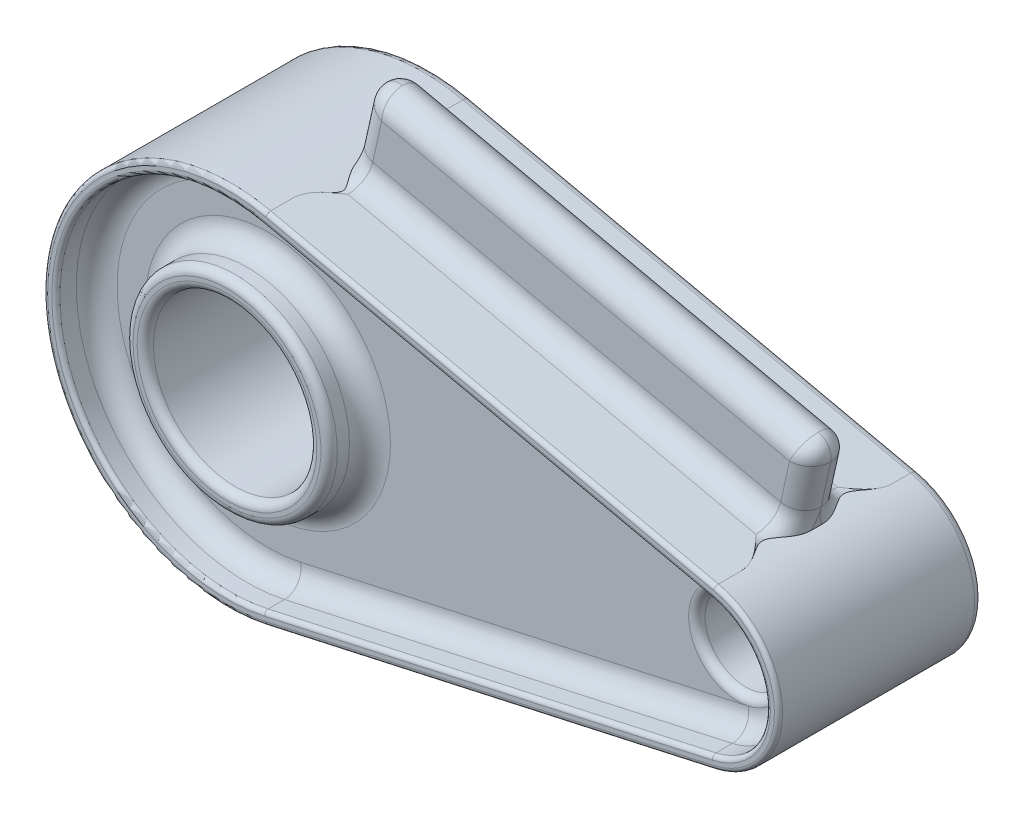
ISO-10303-21;
HEADER;
FILE_DESCRIPTION(('STEP AP214'),'2;1');
FILE_NAME('part.step','',(''),(''),'','','');
FILE_SCHEMA(('AUTOMOTIVE_DESIGN { 1 0 10303 214 1 1 1 1 }'));
ENDSEC;
DATA;
#1=APPLICATION_CONTEXT('core data for automotive mechanical design processes');
#2=APPLICATION_PROTOCOL_DEFINITION('international standard','automotive_design',2000,#1);
#3=PRODUCT_CONTEXT('',#1,'mechanical');
#4=PRODUCT('Part','Part','',(#3));
#5=PRODUCT_RELATED_PRODUCT_CATEGORY('part','',(#4));
#6=PRODUCT_DEFINITION_FORMATION('','',#4);
#7=PRODUCT_DEFINITION_CONTEXT('part definition',#1,'design');
#8=PRODUCT_DEFINITION('design','',#6,#7);
#9=PRODUCT_DEFINITION_SHAPE('','',#8);
#10=(LENGTH_UNIT() NAMED_UNIT(*) SI_UNIT(.MILLI.,.METRE.));
#11=(NAMED_UNIT(*) PLANE_ANGLE_UNIT() SI_UNIT($,.RADIAN.));
#12=(NAMED_UNIT(*) SI_UNIT($,.STERADIAN.) SOLID_ANGLE_UNIT());
#13=UNCERTAINTY_MEASURE_WITH_UNIT(LENGTH_MEASURE(1.E-05),#10,'distance_accuracy_value','');
#14=(GEOMETRIC_REPRESENTATION_CONTEXT(3) GLOBAL_UNCERTAINTY_ASSIGNED_CONTEXT((#13)) GLOBAL_UNIT_ASSIGNED_CONTEXT((#10,
#11,#12)) REPRESENTATION_CONTEXT('',''));
#15=CARTESIAN_POINT('',(0.,0.,0.));
#16=DIRECTION('',(0.,0.,1.));
#17=DIRECTION('',(1.,0.,0.));
#18=AXIS2_PLACEMENT_3D('',#15,#16,#17);
#19=CARTESIAN_POINT('',(7.5753864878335,34.1703602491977,0.));
#20=DIRECTION('',(0.976296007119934,-0.2164396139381,0.));
#21=DIRECTION('',(0.2164396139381,0.976296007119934,0.));
#22=AXIS2_PLACEMENT_3D('',#19,#20,#21);
#23=CYLINDRICAL_SURFACE('',#22,5.);
#24=DIRECTION('',(0.976296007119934,-0.2164396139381,0.));
#25=VECTOR('',#24,1.);
#26=CARTESIAN_POINT('',(-102.037311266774,58.4709102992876,-5.));
#27=LINE('',#26,#25);
#28=CARTESIAN_POINT('',(-97.1558312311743,57.3887122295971,-5.));
#29=VERTEX_POINT('',#28);
#30=CARTESIAN_POINT('',(2.69390645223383,35.2525583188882,-5.));
#31=VERTEX_POINT('',#30);
#32=EDGE_CURVE('E370',#29,#31,#27,.T.);
#33=ORIENTED_EDGE('',*,*,#32,.F.);
#34=CARTESIAN_POINT('',(-97.1558312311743,57.3887122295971,0.));
#35=DIRECTION('',(-0.999784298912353,0.0207691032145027,0.));
#36=DIRECTION('',(-0.0207691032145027,-0.999784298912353,0.));
#37=AXIS2_PLACEMENT_3D('',#34,#35,#36);
#38=ELLIPSE('',#37,5.09901951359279,5.);
#39=CARTESIAN_POINT('',(-97.0499291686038,62.4866318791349,0.));
#40=VERTEX_POINT('',#39);
#41=EDGE_CURVE('E457',#29,#40,#38,.F.);
#42=ORIENTED_EDGE('',*,*,#41,.T.);
#43=CARTESIAN_POINT('',(-97.1558312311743,57.3887122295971,0.));
#44=DIRECTION('',(-0.999784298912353,0.0207691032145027,0.));
#45=DIRECTION('',(-0.0207691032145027,-0.999784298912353,0.));
#46=AXIS2_PLACEMENT_3D('',#43,#44,#45);
#47=ELLIPSE('',#46,5.09901951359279,5.);
#48=CARTESIAN_POINT('',(-97.1558312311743,57.3887122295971,5.));
#49=VERTEX_POINT('',#48);
#50=EDGE_CURVE('E468',#40,#49,#47,.F.);
#51=ORIENTED_EDGE('',*,*,#50,.T.);
#52=DIRECTION('',(-0.976296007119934,0.2164396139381,0.));
#53=VECTOR('',#52,1.);
#54=CARTESIAN_POINT('',(7.5753864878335,34.1703602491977,5.));
#55=LINE('',#54,#53);
#56=CARTESIAN_POINT('',(2.69390645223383,35.2525583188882,5.));
#57=VERTEX_POINT('',#56);
#58=EDGE_CURVE('E367',#57,#49,#55,.T.);
#59=ORIENTED_EDGE('',*,*,#58,.F.);
#60=CARTESIAN_POINT('',(2.69390645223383,35.2525583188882,0.));
#61=DIRECTION('',(-0.914889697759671,0.403703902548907,0.));
#62=DIRECTION('',(0.403703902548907,0.914889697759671,0.));
#63=AXIS2_PLACEMENT_3D('',#60,#61,#62);
#64=ELLIPSE('',#63,5.09901951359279,5.);
#65=CARTESIAN_POINT('',(4.75240052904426,39.9175987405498,0.));
#66=VERTEX_POINT('',#65);
#67=EDGE_CURVE('E475',#57,#66,#64,.T.);
#68=ORIENTED_EDGE('',*,*,#67,.T.);
#69=CARTESIAN_POINT('',(2.69390645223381,35.2525583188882,0.));
#70=DIRECTION('',(-0.914889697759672,0.403703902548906,0.));
#71=DIRECTION('',(0.403703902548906,0.914889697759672,0.));
#72=AXIS2_PLACEMENT_3D('',#69,#70,#71);
#73=ELLIPSE('',#72,5.09901951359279,5.);
#74=EDGE_CURVE('E459',#66,#31,#73,.T.);
#75=ORIENTED_EDGE('',*,*,#74,.T.);
#76=EDGE_LOOP('',(#33,#42,#51,#59,#68,#75));
#77=FACE_BOUND('',#76,.T.);
#78=ADVANCED_FACE('F35',(#77),#23,.T.);
#79=CARTESIAN_POINT('',(-105.283905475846,43.8264701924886,25.));
#80=DIRECTION('',(-0.2164396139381,-0.976296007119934,0.));
#81=DIRECTION('',(0.976296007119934,-0.2164396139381,0.));
#82=AXIS2_PLACEMENT_3D('',#79,#80,#81);
#83=PLANE('',#82);
#84=DIRECTION('',(0.,0.,-1.));
#85=VECTOR('',#84,1.);
#86=CARTESIAN_POINT('',(4.328792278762,19.5259201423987,25.));
#87=LINE('',#86,#85);
#88=CARTESIAN_POINT('',(4.328792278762,19.5259201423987,24.));
#89=VERTEX_POINT('',#88);
#90=CARTESIAN_POINT('',(4.328792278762,19.5259201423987,18.6602540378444));
#91=VERTEX_POINT('',#90);
#92=EDGE_CURVE('E247',#89,#91,#87,.T.);
#93=ORIENTED_EDGE('',*,*,#92,.T.);
#94=CARTESIAN_POINT('',(4.328792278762,19.5259201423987,18.6602540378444));
#95=CARTESIAN_POINT('',(4.32882127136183,19.525913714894,18.4460157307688));
#96=CARTESIAN_POINT('',(4.31871463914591,19.5281543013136,18.2319025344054));
#97=CARTESIAN_POINT('',(4.27961847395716,19.5368217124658,17.8058022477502));
#98=CARTESIAN_POINT('',(4.25065767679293,19.5432421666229,17.5938124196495));
#99=CARTESIAN_POINT('',(4.17568764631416,19.5598626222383,17.175707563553));
#100=CARTESIAN_POINT('',(4.12988800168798,19.5700161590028,16.9695525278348));
#101=CARTESIAN_POINT('',(4.0226284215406,19.5937950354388,16.5614970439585));
#102=CARTESIAN_POINT('',(3.96116100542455,19.6074220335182,16.3595986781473));
#103=CARTESIAN_POINT('',(3.79852650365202,19.6434772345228,15.8867640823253));
#104=CARTESIAN_POINT('',(3.69109691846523,19.6672938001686,15.6180808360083));
#105=CARTESIAN_POINT('',(3.4533609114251,19.7199986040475,15.0915990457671));
#106=CARTESIAN_POINT('',(3.32304755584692,19.7488883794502,14.8338038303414));
#107=CARTESIAN_POINT('',(3.04259651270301,19.8110628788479,14.3282446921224));
#108=CARTESIAN_POINT('',(2.89236713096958,19.8443679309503,14.0805345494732));
#109=CARTESIAN_POINT('',(2.57603584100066,19.9144968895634,13.5959117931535));
#110=CARTESIAN_POINT('',(2.40992667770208,19.9513224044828,13.3590041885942));
#111=CARTESIAN_POINT('',(1.82097313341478,20.0818902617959,12.5665031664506));
#112=CARTESIAN_POINT('',(1.36774439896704,20.1823686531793,12.0348194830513));
#113=CARTESIAN_POINT('',(0.42872365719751,20.3905445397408,11.0054208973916));
#114=CARTESIAN_POINT('',(-0.057042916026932,20.4982363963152,10.5076800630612));
#115=CARTESIAN_POINT('',(-0.546179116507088,20.6066752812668,10.0066666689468));
#116=CARTESIAN_POINT('',(-0.54943343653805,20.6073967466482,10.0033333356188));
#117=CARTESIAN_POINT('',(-0.55268775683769,20.6081182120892,10.));
#118=B_SPLINE_CURVE_WITH_KNOTS('',3,(#94,#95,#96,#97,#98,#99,#100,#101,#102,#103,#104,#105,#106,
#107,#108,#109,#110,#111,#112,#113,#114,#115,#116,#117),.UNSPECIFIED.,.F.,.F.,(4,2,2,2,2,2,2,2,
2,2,2,4),(0.,0.642281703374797,1.2835867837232,1.9171659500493,2.55104818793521,
3.42069998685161,4.29061574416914,5.16468554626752,6.03915661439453,8.15226547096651,
10.2637414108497,10.2778835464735),.UNSPECIFIED.);
#119=CARTESIAN_POINT('',(-0.552687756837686,20.6081182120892,10.));
#120=VERTEX_POINT('',#119);
#121=EDGE_CURVE('E501',#91,#120,#118,.T.);
#122=ORIENTED_EDGE('',*,*,#121,.T.);
#123=DIRECTION('',(0.976296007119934,-0.2164396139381,0.));
#124=VECTOR('',#123,1.);
#125=CARTESIAN_POINT('',(-105.283905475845,43.8264701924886,10.));
#126=LINE('',#125,#124);
#127=CARTESIAN_POINT('',(-100.402425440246,42.7442721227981,10.));
#128=VERTEX_POINT('',#127);
#129=EDGE_CURVE('E364',#120,#128,#126,.F.);
#130=ORIENTED_EDGE('',*,*,#129,.T.);
#131=CARTESIAN_POINT('',(-105.283905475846,43.8264701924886,18.6602540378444));
#132=CARTESIAN_POINT('',(-105.283934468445,43.8264766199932,18.4460157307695));
#133=CARTESIAN_POINT('',(-105.273827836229,43.8242360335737,18.2319025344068));
#134=CARTESIAN_POINT('',(-105.234731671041,43.8155686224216,17.805802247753));
#135=CARTESIAN_POINT('',(-105.205770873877,43.8091481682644,17.593812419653));
#136=CARTESIAN_POINT('',(-105.130800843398,43.7925277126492,17.1757075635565));
#137=CARTESIAN_POINT('',(-105.085001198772,43.7823741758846,16.9695525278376));
#138=CARTESIAN_POINT('',(-104.977741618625,43.7585952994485,16.5614970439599));
#139=CARTESIAN_POINT('',(-104.916274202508,43.7449683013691,16.3595986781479));
#140=CARTESIAN_POINT('',(-104.753639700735,43.7089131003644,15.8867640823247));
#141=CARTESIAN_POINT('',(-104.646210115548,43.6850965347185,15.6180808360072));
#142=CARTESIAN_POINT('',(-104.408474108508,43.6323917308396,15.091599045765));
#143=CARTESIAN_POINT('',(-104.278160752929,43.6035019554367,14.8338038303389));
#144=CARTESIAN_POINT('',(-103.997709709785,43.5413274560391,14.32824469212));
#145=CARTESIAN_POINT('',(-103.847480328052,43.5080224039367,14.0805345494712));
#146=CARTESIAN_POINT('',(-103.531149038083,43.4378934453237,13.5959117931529));
#147=CARTESIAN_POINT('',(-103.365039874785,43.4010679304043,13.3590041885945));
#148=CARTESIAN_POINT('',(-102.7760863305,43.2705000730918,12.5665031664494));
#149=CARTESIAN_POINT('',(-102.322857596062,43.1700216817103,12.0348194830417));
#150=CARTESIAN_POINT('',(-101.383836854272,42.9618457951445,11.0054208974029));
#151=CARTESIAN_POINT('',(-100.898070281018,42.8541539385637,10.5076800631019));
#152=CARTESIAN_POINT('',(-100.408934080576,42.7457150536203,10.0066666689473));
#153=CARTESIAN_POINT('',(-100.405679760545,42.744993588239,10.0033333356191));
#154=CARTESIAN_POINT('',(-100.402425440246,42.7442721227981,10.));
#155=B_SPLINE_CURVE_WITH_KNOTS('',3,(#131,#132,#133,#134,#135,#136,#137,#138,#139,#140,#141,
#142,#143,#144,#145,#146,#147,#148,#149,#150,#151,#152,#153,#154),.UNSPECIFIED.,.F.,.F.,(4,2,2,
2,2,2,2,2,2,2,2,4),(0.,0.642281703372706,1.28358678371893,1.91716595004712,2.55104818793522,
3.42069998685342,4.2906157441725,5.16468554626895,6.03915661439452,8.15226547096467,
10.2637414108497,10.2778835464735),.UNSPECIFIED.);
#156=CARTESIAN_POINT('',(-105.283905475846,43.8264701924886,18.6602540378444));
#157=VERTEX_POINT('',#156);
#158=EDGE_CURVE('E495',#128,#157,#155,.F.);
#159=ORIENTED_EDGE('',*,*,#158,.T.);
#160=DIRECTION('',(0.,0.,-1.));
#161=VECTOR('',#160,1.);
#162=CARTESIAN_POINT('',(-105.283905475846,43.8264701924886,25.));
#163=LINE('',#162,#161);
#164=CARTESIAN_POINT('',(-105.283905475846,43.8264701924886,24.));
#165=VERTEX_POINT('',#164);
#166=EDGE_CURVE('E615',#165,#157,#163,.T.);
#167=ORIENTED_EDGE('',*,*,#166,.F.);
#168=DIRECTION('',(-0.976296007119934,0.2164396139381,0.));
#169=VECTOR('',#168,1.);
#170=CARTESIAN_POINT('',(-105.283905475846,43.8264701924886,24.));
#171=LINE('',#170,#169);
#172=EDGE_CURVE('E299',#165,#89,#171,.F.);
#173=ORIENTED_EDGE('',*,*,#172,.T.);
#174=EDGE_LOOP('',(#93,#122,#130,#159,#167,#173));
#175=FACE_BOUND('',#174,.T.);
#176=ADVANCED_FACE('F441',(#175),#83,.F.);
#177=CARTESIAN_POINT('',(-2.63677968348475E-13,-1.52655665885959E-13,25.));
#178=DIRECTION('',(0.,0.,-1.));
#179=DIRECTION('',(-1.,0.,0.));
#180=AXIS2_PLACEMENT_3D('',#177,#178,#179);
#181=PLANE('',#180);
#182=CARTESIAN_POINT('',(-115.,0.,25.));
#183=DIRECTION('',(0.,0.,-1.));
#184=DIRECTION('',(-1.,0.,0.));
#185=AXIS2_PLACEMENT_3D('',#182,#183,#184);
#186=CIRCLE('',#185,23.);
#187=CARTESIAN_POINT('',(-138.,0.,25.));
#188=VERTEX_POINT('',#187);
#189=EDGE_CURVE('E343',#188,#188,#186,.F.);
#190=ORIENTED_EDGE('',*,*,#189,.T.);
#191=EDGE_LOOP('',(#190));
#192=FACE_BOUND('',#191,.T.);
#193=CARTESIAN_POINT('',(-115.,0.,25.));
#194=DIRECTION('',(0.,0.,-1.));
#195=DIRECTION('',(-1.,0.,0.));
#196=AXIS2_PLACEMENT_3D('',#193,#194,#195);
#197=CIRCLE('',#196,22.);
#198=CARTESIAN_POINT('',(-137.,0.,25.));
#199=VERTEX_POINT('',#198);
#200=EDGE_CURVE('E340',#199,#199,#197,.T.);
#201=ORIENTED_EDGE('',*,*,#200,.T.);
#202=EDGE_LOOP('',(#201));
#203=FACE_BOUND('',#202,.T.);
#204=ADVANCED_FACE('F451',(#192,#203),#181,.F.);
#205=CARTESIAN_POINT('',(-2.63677968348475E-13,-1.52655665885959E-13,25.));
#206=DIRECTION('',(0.,0.,-1.));
#207=DIRECTION('',(-1.,0.,0.));
#208=AXIS2_PLACEMENT_3D('',#205,#206,#207);
#209=CYLINDRICAL_SURFACE('',#208,10.);
#210=CARTESIAN_POINT('',(-2.63677968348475E-13,-1.52655665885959E-13,13.));
#211=DIRECTION('',(0.,0.,1.));
#212=DIRECTION('',(1.,0.,0.));
#213=AXIS2_PLACEMENT_3D('',#210,#211,#212);
#214=CIRCLE('',#213,10.);
#215=CARTESIAN_POINT('',(9.99999999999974,-1.52655665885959E-13,13.));
#216=VERTEX_POINT('',#215);
#217=EDGE_CURVE('E336',#216,#216,#214,.T.);
#218=ORIENTED_EDGE('',*,*,#217,.T.);
#219=EDGE_LOOP('',(#218));
#220=FACE_BOUND('',#219,.T.);
#221=CARTESIAN_POINT('',(-2.63677968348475E-13,-1.52655665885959E-13,-23.));
#222=DIRECTION('',(0.,0.,-1.));
#223=DIRECTION('',(-1.,0.,0.));
#224=AXIS2_PLACEMENT_3D('',#221,#222,#223);
#225=CIRCLE('',#224,10.);
#226=CARTESIAN_POINT('',(-10.0000000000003,-1.52655665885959E-13,-23.));
#227=VERTEX_POINT('',#226);
#228=EDGE_CURVE('E333',#227,#227,#225,.T.);
#229=ORIENTED_EDGE('',*,*,#228,.T.);
#230=EDGE_LOOP('',(#229));
#231=FACE_BOUND('',#230,.T.);
#232=ADVANCED_FACE('F637',(#220,#231),#209,.F.);
#233=CARTESIAN_POINT('',(-115.,0.,25.));
#234=DIRECTION('',(0.,0.,-1.));
#235=DIRECTION('',(-1.,0.,0.));
#236=AXIS2_PLACEMENT_3D('',#233,#234,#235);
#237=CIRCLE('',#236,43.8905556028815);
#238=CARTESIAN_POINT('',(-105.500345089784,42.8501741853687,25.));
#239=VERTEX_POINT('',#238);
#240=CARTESIAN_POINT('',(-105.500345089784,-42.8501741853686,25.));
#241=VERTEX_POINT('',#240);
#242=EDGE_CURVE('E285',#239,#241,#237,.F.);
#243=ORIENTED_EDGE('',*,*,#242,.T.);
#244=DIRECTION('',(0.976296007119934,0.2164396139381,0.));
#245=VECTOR('',#244,1.);
#246=CARTESIAN_POINT('',(4.11235266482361,-18.5496241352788,25.));
#247=LINE('',#246,#245);
#248=CARTESIAN_POINT('',(4.11235266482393,-18.5496241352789,25.));
#249=VERTEX_POINT('',#248);
#250=EDGE_CURVE('E287',#241,#249,#247,.T.);
#251=ORIENTED_EDGE('',*,*,#250,.T.);
#252=CARTESIAN_POINT('',(-2.63677968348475E-13,-1.52655665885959E-13,25.));
#253=DIRECTION('',(0.,0.,-1.));
#254=DIRECTION('',(-1.,0.,0.));
#255=AXIS2_PLACEMENT_3D('',#252,#253,#254);
#256=CIRCLE('',#255,19.0000000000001);
#257=CARTESIAN_POINT('',(4.11235266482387,18.5496241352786,25.));
#258=VERTEX_POINT('',#257);
#259=EDGE_CURVE('E281',#249,#258,#256,.F.);
#260=ORIENTED_EDGE('',*,*,#259,.T.);
#261=DIRECTION('',(-0.976296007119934,0.2164396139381,0.));
#262=VECTOR('',#261,1.);
#263=CARTESIAN_POINT('',(4.11235266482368,18.5496241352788,25.));
#264=LINE('',#263,#262);
#265=EDGE_CURVE('E283',#258,#239,#264,.T.);
#266=ORIENTED_EDGE('',*,*,#265,.T.);
#267=EDGE_LOOP('',(#243,#251,#260,#266));
#268=FACE_BOUND('',#267,.T.);
#269=DIRECTION('',(-0.976296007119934,0.216439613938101,0.));
#270=VECTOR('',#269,1.);
#271=CARTESIAN_POINT('',(3.89591305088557,17.5733281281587,25.));
#272=LINE('',#271,#270);
#273=CARTESIAN_POINT('',(-105.716784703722,41.8738781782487,25.));
#274=VERTEX_POINT('',#273);
#275=CARTESIAN_POINT('',(3.89591305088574,17.5733281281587,25.));
#276=VERTEX_POINT('',#275);
#277=EDGE_CURVE('E276',#274,#276,#272,.F.);
#278=ORIENTED_EDGE('',*,*,#277,.T.);
#279=CARTESIAN_POINT('',(-2.63677968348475E-13,-1.52655665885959E-13,25.));
#280=DIRECTION('',(0.,0.,-1.));
#281=DIRECTION('',(-1.,0.,0.));
#282=AXIS2_PLACEMENT_3D('',#279,#280,#281);
#283=CIRCLE('',#282,18.0000000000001);
#284=CARTESIAN_POINT('',(3.8959130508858,-17.573328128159,25.));
#285=VERTEX_POINT('',#284);
#286=EDGE_CURVE('E278',#276,#285,#283,.T.);
#287=ORIENTED_EDGE('',*,*,#286,.T.);
#288=DIRECTION('',(0.976296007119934,0.216439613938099,0.));
#289=VECTOR('',#288,1.);
#290=CARTESIAN_POINT('',(3.89591305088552,-17.573328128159,25.));
#291=LINE('',#290,#289);
#292=CARTESIAN_POINT('',(-105.716784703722,-41.8738781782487,25.));
#293=VERTEX_POINT('',#292);
#294=EDGE_CURVE('E272',#285,#293,#291,.F.);
#295=ORIENTED_EDGE('',*,*,#294,.T.);
#296=CARTESIAN_POINT('',(-115.,0.,25.));
#297=DIRECTION('',(0.,0.,-1.));
#298=DIRECTION('',(-1.,0.,0.));
#299=AXIS2_PLACEMENT_3D('',#296,#297,#298);
#300=CIRCLE('',#299,42.8905556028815);
#301=EDGE_CURVE('E274',#293,#274,#300,.T.);
#302=ORIENTED_EDGE('',*,*,#301,.T.);
#303=EDGE_LOOP('',(#278,#287,#295,#302));
#304=FACE_BOUND('',#303,.T.);
#305=ADVANCED_FACE('F442',(#268,#304),#181,.F.);
#306=CARTESIAN_POINT('',(-2.63677968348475E-13,-1.52655665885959E-13,-25.));
#307=DIRECTION('',(0.,0.,-1.));
#308=DIRECTION('',(-1.,0.,0.));
#309=AXIS2_PLACEMENT_3D('',#306,#307,#308);
#310=PLANE('',#309);
#311=CARTESIAN_POINT('',(-115.,0.,-25.));
#312=DIRECTION('',(0.,0.,-1.));
#313=DIRECTION('',(-1.,0.,0.));
#314=AXIS2_PLACEMENT_3D('',#311,#312,#313);
#315=CIRCLE('',#314,42.8905556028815);
#316=CARTESIAN_POINT('',(-105.716784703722,-41.8738781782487,-25.));
#317=VERTEX_POINT('',#316);
#318=CARTESIAN_POINT('',(-105.716784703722,41.8738781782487,-25.));
#319=VERTEX_POINT('',#318);
#320=EDGE_CURVE('E328',#317,#319,#315,.T.);
#321=ORIENTED_EDGE('',*,*,#320,.T.);
#322=DIRECTION('',(-0.976296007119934,0.2164396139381,0.));
#323=VECTOR('',#322,1.);
#324=CARTESIAN_POINT('',(3.89591305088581,17.5733281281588,-25.));
#325=LINE('',#324,#323);
#326=CARTESIAN_POINT('',(3.89591305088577,17.5733281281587,-25.));
#327=VERTEX_POINT('',#326);
#328=EDGE_CURVE('E330',#319,#327,#325,.F.);
#329=ORIENTED_EDGE('',*,*,#328,.T.);
#330=CARTESIAN_POINT('',(-2.63677968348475E-13,-1.52655665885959E-13,-25.));
#331=DIRECTION('',(0.,0.,-1.));
#332=DIRECTION('',(-1.,0.,0.));
#333=AXIS2_PLACEMENT_3D('',#330,#331,#332);
#334=CIRCLE('',#333,18.0000000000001);
#335=CARTESIAN_POINT('',(3.89591305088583,-17.573328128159,-25.));
#336=VERTEX_POINT('',#335);
#337=EDGE_CURVE('E324',#327,#336,#334,.T.);
#338=ORIENTED_EDGE('',*,*,#337,.T.);
#339=DIRECTION('',(0.976296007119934,0.2164396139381,0.));
#340=VECTOR('',#339,1.);
#341=CARTESIAN_POINT('',(-105.716784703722,-41.8738781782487,-25.));
#342=LINE('',#341,#340);
#343=EDGE_CURVE('E326',#336,#317,#342,.F.);
#344=ORIENTED_EDGE('',*,*,#343,.T.);
#345=EDGE_LOOP('',(#321,#329,#338,#344));
#346=FACE_BOUND('',#345,.T.);
#347=CARTESIAN_POINT('',(-2.63677968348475E-13,-1.52655665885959E-13,-25.));
#348=DIRECTION('',(0.,0.,-1.));
#349=DIRECTION('',(-1.,0.,0.));
#350=AXIS2_PLACEMENT_3D('',#347,#348,#349);
#351=CIRCLE('',#350,12.);
#352=CARTESIAN_POINT('',(-12.0000000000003,-1.52655665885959E-13,-25.));
#353=VERTEX_POINT('',#352);
#354=EDGE_CURVE('E321',#353,#353,#351,.F.);
#355=ORIENTED_EDGE('',*,*,#354,.T.);
#356=EDGE_LOOP('',(#355));
#357=FACE_BOUND('',#356,.T.);
#358=CARTESIAN_POINT('',(-115.,0.,-25.));
#359=DIRECTION('',(0.,0.,-1.));
#360=DIRECTION('',(-1.,0.,0.));
#361=AXIS2_PLACEMENT_3D('',#358,#359,#360);
#362=CIRCLE('',#361,22.);
#363=CARTESIAN_POINT('',(-137.,0.,-25.));
#364=VERTEX_POINT('',#363);
#365=EDGE_CURVE('E318',#364,#364,#362,.F.);
#366=ORIENTED_EDGE('',*,*,#365,.T.);
#367=EDGE_LOOP('',(#366));
#368=FACE_BOUND('',#367,.T.);
#369=ADVANCED_FACE('F432',(#346,#357,#368),#310,.T.);
#370=CARTESIAN_POINT('',(-2.63677968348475E-13,-1.52655665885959E-13,25.));
#371=DIRECTION('',(0.,0.,-1.));
#372=DIRECTION('',(-1.,0.,0.));
#373=AXIS2_PLACEMENT_3D('',#370,#371,#372);
#374=CYLINDRICAL_SURFACE('',#373,20.0000000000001);
#375=ORIENTED_EDGE('',*,*,#92,.F.);
#376=CARTESIAN_POINT('',(-2.63677968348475E-13,-1.52655665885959E-13,24.));
#377=DIRECTION('',(0.,0.,-1.));
#378=DIRECTION('',(-1.,0.,0.));
#379=AXIS2_PLACEMENT_3D('',#376,#377,#378);
#380=CIRCLE('',#379,20.0000000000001);
#381=CARTESIAN_POINT('',(4.328792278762,-19.5259201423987,24.));
#382=VERTEX_POINT('',#381);
#383=EDGE_CURVE('E304',#89,#382,#380,.T.);
#384=ORIENTED_EDGE('',*,*,#383,.T.);
#385=DIRECTION('',(0.,0.,-1.));
#386=VECTOR('',#385,1.);
#387=CARTESIAN_POINT('',(4.328792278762,-19.5259201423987,25.));
#388=LINE('',#387,#386);
#389=CARTESIAN_POINT('',(4.328792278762,-19.5259201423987,-23.));
#390=VERTEX_POINT('',#389);
#391=EDGE_CURVE('E600',#382,#390,#388,.T.);
#392=ORIENTED_EDGE('',*,*,#391,.T.);
#393=CARTESIAN_POINT('',(-2.63677968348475E-13,-1.52655665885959E-13,-23.));
#394=DIRECTION('',(0.,0.,-1.));
#395=DIRECTION('',(-1.,0.,0.));
#396=AXIS2_PLACEMENT_3D('',#393,#394,#395);
#397=CIRCLE('',#396,20.0000000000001);
#398=CARTESIAN_POINT('',(4.328792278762,19.5259201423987,-23.));
#399=VERTEX_POINT('',#398);
#400=EDGE_CURVE('E301',#390,#399,#397,.F.);
#401=ORIENTED_EDGE('',*,*,#400,.T.);
#402=CARTESIAN_POINT('',(4.328792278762,19.5259201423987,-18.6602540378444));
#403=VERTEX_POINT('',#402);
#404=EDGE_CURVE('E618',#403,#399,#87,.T.);
#405=ORIENTED_EDGE('',*,*,#404,.F.);
#406=CARTESIAN_POINT('',(4.328792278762,19.5259201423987,-18.6602540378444));
#407=CARTESIAN_POINT('',(4.32882519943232,19.5258842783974,-18.445204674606));
#408=CARTESIAN_POINT('',(4.31864053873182,19.5281710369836,-18.2302845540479));
#409=CARTESIAN_POINT('',(4.27924188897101,19.536857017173,-17.8025948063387));
#410=CARTESIAN_POINT('',(4.25005733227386,19.5432498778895,-17.5898223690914));
#411=CARTESIAN_POINT('',(4.1748055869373,19.559457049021,-17.1718079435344));
#412=CARTESIAN_POINT('',(4.1290826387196,19.5692014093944,-16.966500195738));
#413=CARTESIAN_POINT('',(4.02218050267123,19.5914537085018,-16.5600638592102));
#414=CARTESIAN_POINT('',(3.96099597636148,19.6039626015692,-16.3589367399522));
#415=CARTESIAN_POINT('',(3.81169218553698,19.6335894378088,-15.9232806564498));
#416=CARTESIAN_POINT('',(3.72065450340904,19.6511310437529,-15.6897846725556));
#417=CARTESIAN_POINT('',(3.52203016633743,19.687698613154,-15.2300926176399));
#418=CARTESIAN_POINT('',(3.41443953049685,19.7067249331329,-15.0038983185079));
#419=CARTESIAN_POINT('',(3.18480170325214,19.7451446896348,-14.5555631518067));
#420=CARTESIAN_POINT('',(3.06259375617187,19.7645397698,-14.33350572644));
#421=CARTESIAN_POINT('',(2.80894416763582,19.8021765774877,-13.894874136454));
#422=CARTESIAN_POINT('',(2.67750764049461,19.8204189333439,-13.6782970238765));
#423=CARTESIAN_POINT('',(2.47737562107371,19.8460866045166,-13.3558192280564));
#424=CARTESIAN_POINT('',(2.41031574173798,19.8543439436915,-13.248951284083));
#425=CARTESIAN_POINT('',(2.27586887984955,19.8702035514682,-13.0353723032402));
#426=CARTESIAN_POINT('',(2.20848189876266,19.8778058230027,-12.9286612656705));
#427=CARTESIAN_POINT('',(2.07408411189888,19.8922787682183,-12.714588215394));
#428=CARTESIAN_POINT('',(2.00707460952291,19.8991476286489,-12.6072252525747));
#429=CARTESIAN_POINT('',(1.8746761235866,19.9120569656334,-12.3914631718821));
#430=CARTESIAN_POINT('',(1.80928704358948,19.9180974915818,-12.2830641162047));
#431=CARTESIAN_POINT('',(1.68244279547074,19.9292088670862,-12.0661224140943));
#432=CARTESIAN_POINT('',(1.62094270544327,19.9342931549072,-11.9576074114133));
#433=CARTESIAN_POINT('',(1.50250222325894,19.9435715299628,-11.7380957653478));
#434=CARTESIAN_POINT('',(1.44556350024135,19.9477652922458,-11.6270982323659));
#435=CARTESIAN_POINT('',(1.28522766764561,19.9589434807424,-11.2900605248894));
#436=CARTESIAN_POINT('',(1.19153159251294,19.9645895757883,-11.0587417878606));
#437=CARTESIAN_POINT('',(1.09979811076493,19.969752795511,-10.7401550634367));
#438=CARTESIAN_POINT('',(1.07956948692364,19.970849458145,-10.6593150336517));
#439=CARTESIAN_POINT('',(1.04566869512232,19.9726526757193,-10.4962128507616));
#440=CARTESIAN_POINT('',(1.03199875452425,19.9733590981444,-10.4139502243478));
#441=CARTESIAN_POINT('',(1.01198863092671,19.9743832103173,-10.2487148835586));
#442=CARTESIAN_POINT('',(1.00563162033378,19.9747017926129,-10.1657442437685));
#443=CARTESIAN_POINT('',(1.00057229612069,19.9749558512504,-9.99957420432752));
#444=CARTESIAN_POINT('',(1.00186910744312,19.9748913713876,-9.91637483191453));
#445=CARTESIAN_POINT('',(1.01202668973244,19.974379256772,-9.75059092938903));
#446=CARTESIAN_POINT('',(1.0208745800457,19.9739322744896,-9.6680055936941));
#447=CARTESIAN_POINT('',(1.04560601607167,19.9726527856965,-9.50389425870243));
#448=CARTESIAN_POINT('',(1.06149137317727,19.9718201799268,-9.42236853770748));
#449=CARTESIAN_POINT('',(1.09955222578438,19.9697607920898,-9.26051499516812));
#450=CARTESIAN_POINT('',(1.12175015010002,19.968532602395,-9.1801925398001));
#451=CARTESIAN_POINT('',(1.17145044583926,19.9656786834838,-9.02127145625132));
#452=CARTESIAN_POINT('',(1.19895074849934,19.9640531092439,-8.94267216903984));
#453=CARTESIAN_POINT('',(1.28209183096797,19.9589348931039,-8.72485038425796));
#454=CARTESIAN_POINT('',(1.34262497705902,19.9549898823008,-8.58751421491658));
#455=CARTESIAN_POINT('',(1.47306197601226,19.9457858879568,-8.31737122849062));
#456=CARTESIAN_POINT('',(1.54297666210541,19.9405253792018,-8.18456987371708));
#457=CARTESIAN_POINT('',(1.68885703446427,19.9287014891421,-7.92172933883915));
#458=CARTESIAN_POINT('',(1.76484615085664,19.922132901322,-7.79170357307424));
#459=CARTESIAN_POINT('',(1.91994974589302,19.9077839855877,-7.53370346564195));
#460=CARTESIAN_POINT('',(1.9990628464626,19.9000041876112,-7.4057282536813));
#461=CARTESIAN_POINT('',(2.15927010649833,19.8832619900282,-7.14933758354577));
#462=CARTESIAN_POINT('',(2.24037612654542,19.8742886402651,-7.02093031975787));
#463=CARTESIAN_POINT('',(2.40223423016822,19.8553749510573,-6.76394822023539));
#464=CARTESIAN_POINT('',(2.48298628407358,19.845434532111,-6.63537337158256));
#465=CARTESIAN_POINT('',(2.64266867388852,19.8248019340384,-6.3775479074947));
#466=CARTESIAN_POINT('',(2.7216026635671,19.8141114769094,-6.24829943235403));
#467=CARTESIAN_POINT('',(2.87674579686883,19.7921821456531,-5.9882210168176));
#468=CARTESIAN_POINT('',(2.9529550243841,19.7809432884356,-5.85739112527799));
#469=CARTESIAN_POINT('',(3.1020668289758,19.7581096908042,-5.59300472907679));
#470=CARTESIAN_POINT('',(3.17495088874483,19.7465134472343,-5.45943783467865));
#471=CARTESIAN_POINT('',(3.31611916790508,19.7232979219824,-5.18989923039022));
#472=CARTESIAN_POINT('',(3.384403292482,19.7116786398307,-5.05392747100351));
#473=CARTESIAN_POINT('',(3.58123045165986,19.6772072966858,-4.64182061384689));
#474=CARTESIAN_POINT('',(3.70165180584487,19.6547569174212,-4.36166055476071));
#475=CARTESIAN_POINT('',(3.91407468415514,19.6135599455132,-3.79275116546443));
#476=CARTESIAN_POINT('',(4.0062794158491,19.5947872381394,-3.50408049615));
#477=CARTESIAN_POINT('',(4.15835140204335,19.5630830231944,-2.91820060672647));
#478=CARTESIAN_POINT('',(4.21826236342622,19.5501436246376,-2.62100350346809));
#479=CARTESIAN_POINT('',(4.28247778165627,19.5361433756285,-2.15891178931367));
#480=CARTESIAN_POINT('',(4.29968318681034,19.5323563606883,-1.99583038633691));
#481=CARTESIAN_POINT('',(4.32285566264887,19.5272368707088,-1.66844159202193));
#482=CARTESIAN_POINT('',(4.32879538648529,19.5259103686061,-1.50413218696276));
#483=CARTESIAN_POINT('',(4.32879227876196,19.5259201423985,-1.33974596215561));
#484=B_SPLINE_CURVE_WITH_KNOTS('',3,(#406,#407,#408,#409,#410,#411,#412,#413,#414,#415,#416,
#417,#418,#419,#420,#421,#422,#423,#424,#425,#426,#427,#428,#429,#430,#431,#432,#433,#434,#435,
#436,#437,#438,#439,#440,#441,#442,#443,#444,#445,#446,#447,#448,#449,#450,#451,#452,#453,#454,
#455,#456,#457,#458,#459,#460,#461,#462,#463,#464,#465,#466,#467,#468,#469,#470,#471,#472,#473,
#474,#475,#476,#477,#478,#479,#480,#481,#482,#483),.UNSPECIFIED.,.F.,.F.,(4,2,2,2,2,2,2,2,2,2,2,
2,2,2,2,2,2,2,2,2,2,2,2,2,2,2,2,2,2,2,2,2,2,2,2,2,2,2,4),(0.,0.644705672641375,1.28841501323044,
1.91943163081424,2.55066642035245,3.30355452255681,4.05662397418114,4.81890630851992,
5.58076948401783,5.96007741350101,6.33938364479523,6.7196069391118,7.09980755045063,
7.47418322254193,7.84869526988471,8.59334724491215,8.84313914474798,9.09301581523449,
9.34231634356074,9.59158837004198,9.84043603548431,10.0893477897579,10.3391552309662,
10.5888654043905,11.038655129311,11.4889687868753,11.941111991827,12.3930579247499,
12.8494802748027,13.3059401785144,13.7613843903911,14.2168145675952,14.6745307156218,
15.1322562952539,16.0482854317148,16.9575533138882,17.86558746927,18.3573109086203,
18.850226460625),.UNSPECIFIED.);
#485=CARTESIAN_POINT('',(4.328792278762,19.5259201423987,-1.33974596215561));
#486=VERTEX_POINT('',#485);
#487=EDGE_CURVE('E413',#403,#486,#484,.T.);
#488=ORIENTED_EDGE('',*,*,#487,.T.);
#489=DIRECTION('',(0.,0.,1.));
#490=VECTOR('',#489,1.);
#491=CARTESIAN_POINT('',(4.328792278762,19.5259201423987,-5.));
#492=LINE('',#491,#490);
#493=CARTESIAN_POINT('',(4.328792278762,19.5259201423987,1.3397459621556));
#494=VERTEX_POINT('',#493);
#495=EDGE_CURVE('E590',#486,#494,#492,.T.);
#496=ORIENTED_EDGE('',*,*,#495,.T.);
#497=CARTESIAN_POINT('',(4.328792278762,19.5259201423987,1.3397459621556));
#498=CARTESIAN_POINT('',(4.32882519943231,19.5258842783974,1.55479532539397));
#499=CARTESIAN_POINT('',(4.31864053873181,19.5281710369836,1.76971544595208));
#500=CARTESIAN_POINT('',(4.279241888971,19.536857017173,2.19740519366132));
#501=CARTESIAN_POINT('',(4.25005733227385,19.5432498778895,2.41017763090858));
#502=CARTESIAN_POINT('',(4.17480558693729,19.559457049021,2.82819205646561));
#503=CARTESIAN_POINT('',(4.12908263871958,19.5692014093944,3.03349980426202));
#504=CARTESIAN_POINT('',(4.02218050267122,19.5914537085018,3.43993614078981));
#505=CARTESIAN_POINT('',(3.96099597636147,19.6039626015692,3.6410632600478));
#506=CARTESIAN_POINT('',(3.81169218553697,19.6335894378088,4.0767193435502));
#507=CARTESIAN_POINT('',(3.72065450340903,19.6511310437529,4.31021532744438));
#508=CARTESIAN_POINT('',(3.52203016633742,19.687698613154,4.7699073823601));
#509=CARTESIAN_POINT('',(3.41443953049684,19.7067249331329,4.99610168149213));
#510=CARTESIAN_POINT('',(3.18480170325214,19.7451446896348,5.44443684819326));
#511=CARTESIAN_POINT('',(3.06259375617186,19.7645397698,5.66649427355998));
#512=CARTESIAN_POINT('',(2.80894416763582,19.8021765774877,6.10512586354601));
#513=CARTESIAN_POINT('',(2.67750764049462,19.8204189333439,6.32170297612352));
#514=CARTESIAN_POINT('',(2.47737562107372,19.8460866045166,6.6441807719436));
#515=CARTESIAN_POINT('',(2.41031574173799,19.8543439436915,6.75104871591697));
#516=CARTESIAN_POINT('',(2.27586887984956,19.8702035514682,6.96462769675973));
#517=CARTESIAN_POINT('',(2.20848189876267,19.8778058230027,7.07133873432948));
#518=CARTESIAN_POINT('',(2.07408411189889,19.8922787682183,7.28541178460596));
#519=CARTESIAN_POINT('',(2.00707460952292,19.8991476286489,7.39277474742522));
#520=CARTESIAN_POINT('',(1.87467612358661,19.9120569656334,7.60853682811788));
#521=CARTESIAN_POINT('',(1.80928704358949,19.9180974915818,7.71693588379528));
#522=CARTESIAN_POINT('',(1.68244279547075,19.9292088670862,7.9338775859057));
#523=CARTESIAN_POINT('',(1.62094270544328,19.9342931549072,8.04239258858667));
#524=CARTESIAN_POINT('',(1.50250222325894,19.9435715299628,8.2619042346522));
#525=CARTESIAN_POINT('',(1.44556350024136,19.9477652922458,8.37290176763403));
#526=CARTESIAN_POINT('',(1.28522766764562,19.9589434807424,8.70993947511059));
#527=CARTESIAN_POINT('',(1.19153159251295,19.9645895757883,8.94125821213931));
#528=CARTESIAN_POINT('',(1.09979811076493,19.969752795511,9.25984493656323));
#529=CARTESIAN_POINT('',(1.07956948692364,19.970849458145,9.34068496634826));
#530=CARTESIAN_POINT('',(1.04566869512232,19.9726526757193,9.50378714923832));
#531=CARTESIAN_POINT('',(1.03199875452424,19.9733590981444,9.58604977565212));
#532=CARTESIAN_POINT('',(1.01198863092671,19.9743832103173,9.75128511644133));
#533=CARTESIAN_POINT('',(1.00563162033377,19.9747017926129,9.8342557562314));
#534=CARTESIAN_POINT('',(1.00057229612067,19.9749558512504,10.0004257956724));
#535=CARTESIAN_POINT('',(1.00186910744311,19.9748913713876,10.0836251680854));
#536=CARTESIAN_POINT('',(1.01202668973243,19.974379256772,10.2494090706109));
#537=CARTESIAN_POINT('',(1.02087458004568,19.9739322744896,10.3319944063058));
#538=CARTESIAN_POINT('',(1.04560601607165,19.9726527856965,10.4961057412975));
#539=CARTESIAN_POINT('',(1.06149137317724,19.9718201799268,10.5776314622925));
#540=CARTESIAN_POINT('',(1.09955222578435,19.9697607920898,10.7394850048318));
#541=CARTESIAN_POINT('',(1.12175015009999,19.968532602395,10.8198074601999));
#542=CARTESIAN_POINT('',(1.17145044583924,19.9656786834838,10.9787285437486));
#543=CARTESIAN_POINT('',(1.19895074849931,19.9640531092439,11.0573278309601));
#544=CARTESIAN_POINT('',(1.28209183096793,19.9589348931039,11.275149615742));
#545=CARTESIAN_POINT('',(1.34262497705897,19.9549898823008,11.4124857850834));
#546=CARTESIAN_POINT('',(1.47306197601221,19.9457858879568,11.6826287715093));
#547=CARTESIAN_POINT('',(1.54297666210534,19.9405253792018,11.8154301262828));
#548=CARTESIAN_POINT('',(1.68885703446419,19.9287014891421,12.0782706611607));
#549=CARTESIAN_POINT('',(1.76484615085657,19.922132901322,12.2082964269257));
#550=CARTESIAN_POINT('',(1.91994974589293,19.9077839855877,12.4662965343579));
#551=CARTESIAN_POINT('',(1.9990628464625,19.9000041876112,12.5942717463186));
#552=CARTESIAN_POINT('',(2.15927010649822,19.8832619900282,12.8506624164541));
#553=CARTESIAN_POINT('',(2.2403761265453,19.8742886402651,12.979069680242));
#554=CARTESIAN_POINT('',(2.40223423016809,19.8553749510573,13.2360517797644));
#555=CARTESIAN_POINT('',(2.48298628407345,19.845434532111,13.3646266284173));
#556=CARTESIAN_POINT('',(2.64266867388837,19.8248019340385,13.6224520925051));
#557=CARTESIAN_POINT('',(2.72160266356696,19.8141114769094,13.7517005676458));
#558=CARTESIAN_POINT('',(2.87674579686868,19.7921821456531,14.0117789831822));
#559=CARTESIAN_POINT('',(2.95295502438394,19.7809432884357,14.1426088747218));
#560=CARTESIAN_POINT('',(3.10206682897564,19.7581096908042,14.4069952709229));
#561=CARTESIAN_POINT('',(3.17495088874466,19.7465134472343,14.5405621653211));
#562=CARTESIAN_POINT('',(3.31611916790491,19.7232979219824,14.8101007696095));
#563=CARTESIAN_POINT('',(3.38440329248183,19.7116786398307,14.9460725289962));
#564=CARTESIAN_POINT('',(3.58123045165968,19.6772072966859,15.3581793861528));
#565=CARTESIAN_POINT('',(3.70165180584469,19.6547569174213,15.6383394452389));
#566=CARTESIAN_POINT('',(3.91407468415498,19.6135599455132,16.2072488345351));
#567=CARTESIAN_POINT('',(4.00627941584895,19.5947872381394,16.4959195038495));
#568=CARTESIAN_POINT('',(4.15835140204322,19.5630830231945,17.081799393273));
#569=CARTESIAN_POINT('',(4.21826236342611,19.5501436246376,17.3789964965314));
#570=CARTESIAN_POINT('',(4.2824777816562,19.5361433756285,17.8410882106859));
#571=CARTESIAN_POINT('',(4.2996831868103,19.5323563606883,18.0041696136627));
#572=CARTESIAN_POINT('',(4.32285566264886,19.5272368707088,18.3315584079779));
#573=CARTESIAN_POINT('',(4.32879538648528,19.5259103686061,18.4958678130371));
#574=CARTESIAN_POINT('',(4.32879227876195,19.5259201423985,18.6602540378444));
#575=B_SPLINE_CURVE_WITH_KNOTS('',3,(#497,#498,#499,#500,#501,#502,#503,#504,#505,#506,#507,
#508,#509,#510,#511,#512,#513,#514,#515,#516,#517,#518,#519,#520,#521,#522,#523,#524,#525,#526,
#527,#528,#529,#530,#531,#532,#533,#534,#535,#536,#537,#538,#539,#540,#541,#542,#543,#544,#545,
#546,#547,#548,#549,#550,#551,#552,#553,#554,#555,#556,#557,#558,#559,#560,#561,#562,#563,#564,
#565,#566,#567,#568,#569,#570,#571,#572,#573,#574),.UNSPECIFIED.,.F.,.F.,(4,2,2,2,2,2,2,2,2,2,2,
2,2,2,2,2,2,2,2,2,2,2,2,2,2,2,2,2,2,2,2,2,2,2,2,2,2,2,4),(0.,0.644705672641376,1.28841501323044,
1.91943163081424,2.55066642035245,3.30355452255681,4.05662397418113,4.8189063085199,
5.58076948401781,5.96007741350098,6.3393836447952,6.71960693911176,7.09980755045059,
7.47418322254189,7.84869526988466,8.5933472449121,8.84313914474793,9.09301581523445,
9.34231634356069,9.59158837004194,9.84043603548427,10.0893477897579,10.3391552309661,
10.5888654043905,11.0386551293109,11.4889687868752,11.9411119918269,12.3930579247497,
12.8494802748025,13.3059401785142,13.7613843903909,14.216814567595,14.6745307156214,
15.1322562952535,16.0482854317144,16.9575533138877,17.8655874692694,18.35731090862,
18.850226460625),.UNSPECIFIED.);
#576=EDGE_CURVE('E419',#494,#91,#575,.T.);
#577=ORIENTED_EDGE('',*,*,#576,.T.);
#578=EDGE_LOOP('',(#375,#384,#392,#401,#405,#488,#496,#577));
#579=FACE_BOUND('',#578,.T.);
#580=ADVANCED_FACE('F429',(#579),#374,.T.);
#581=CARTESIAN_POINT('',(-105.283905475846,43.8264701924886,-18.6602540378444));
#582=VERTEX_POINT('',#581);
#583=CARTESIAN_POINT('',(-105.283905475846,43.8264701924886,-23.));
#584=VERTEX_POINT('',#583);
#585=EDGE_CURVE('E614',#582,#584,#163,.T.);
#586=ORIENTED_EDGE('',*,*,#585,.F.);
#587=CARTESIAN_POINT('',(-105.283905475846,43.8264701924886,-18.6602540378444));
#588=CARTESIAN_POINT('',(-105.283934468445,43.8264766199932,-18.4460157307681));
#589=CARTESIAN_POINT('',(-105.273827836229,43.8242360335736,-18.231902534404));
#590=CARTESIAN_POINT('',(-105.23473167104,43.8155686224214,-17.8058022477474));
#591=CARTESIAN_POINT('',(-105.205770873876,43.8091481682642,-17.593812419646));
#592=CARTESIAN_POINT('',(-105.130800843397,43.7925277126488,-17.1757075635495));
#593=CARTESIAN_POINT('',(-105.085001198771,43.7823741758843,-16.9695525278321));
#594=CARTESIAN_POINT('',(-104.977741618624,43.7585952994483,-16.5614970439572));
#595=CARTESIAN_POINT('',(-104.916274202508,43.744968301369,-16.3595986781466));
#596=CARTESIAN_POINT('',(-104.753639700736,43.7089131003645,-15.8867640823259));
#597=CARTESIAN_POINT('',(-104.646210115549,43.6850965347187,-15.6180808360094));
#598=CARTESIAN_POINT('',(-104.40847410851,43.63239173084,-15.0915990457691));
#599=CARTESIAN_POINT('',(-104.278160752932,43.6035019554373,-14.8338038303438));
#600=CARTESIAN_POINT('',(-103.997709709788,43.5413274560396,-14.3282446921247));
#601=CARTESIAN_POINT('',(-103.847480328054,43.5080224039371,-14.080534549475));
#602=CARTESIAN_POINT('',(-103.531149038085,43.437893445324,-13.595911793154));
#603=CARTESIAN_POINT('',(-103.365039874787,43.4010679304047,-13.3590041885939));
#604=CARTESIAN_POINT('',(-102.776086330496,43.2705000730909,-12.5665031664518));
#605=CARTESIAN_POINT('',(-102.32285759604,43.1700216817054,-12.0348194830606));
#606=CARTESIAN_POINT('',(-101.38383685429,42.9618457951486,-11.0054208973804));
#607=CARTESIAN_POINT('',(-100.898070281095,42.854153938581,-10.5076800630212));
#608=CARTESIAN_POINT('',(-100.408934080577,42.7457150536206,-10.0066666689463));
#609=CARTESIAN_POINT('',(-100.405679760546,42.7449935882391,-10.0033333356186));
#610=CARTESIAN_POINT('',(-100.402425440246,42.7442721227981,-10.));
#611=B_SPLINE_CURVE_WITH_KNOTS('',3,(#587,#588,#589,#590,#591,#592,#593,#594,#595,#596,#597,
#598,#599,#600,#601,#602,#603,#604,#605,#606,#607,#608,#609,#610),.UNSPECIFIED.,.F.,.F.,(4,2,2,
2,2,2,2,2,2,2,2,4),(0.,0.642281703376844,1.28358678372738,1.91716595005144,2.55104818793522,
3.42069998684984,4.29061574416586,5.16468554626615,6.03915661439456,8.15226547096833,
10.2637414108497,10.2778835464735),.UNSPECIFIED.);
#612=CARTESIAN_POINT('',(-100.402425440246,42.7442721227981,-10.));
#613=VERTEX_POINT('',#612);
#614=EDGE_CURVE('E390',#582,#613,#611,.T.);
#615=ORIENTED_EDGE('',*,*,#614,.T.);
#616=DIRECTION('',(0.976296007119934,-0.2164396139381,0.));
#617=VECTOR('',#616,1.);
#618=CARTESIAN_POINT('',(-105.283905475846,43.8264701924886,-10.));
#619=LINE('',#618,#617);
#620=CARTESIAN_POINT('',(-0.552687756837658,20.6081182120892,-10.));
#621=VERTEX_POINT('',#620);
#622=EDGE_CURVE('E355',#613,#621,#619,.T.);
#623=ORIENTED_EDGE('',*,*,#622,.T.);
#624=CARTESIAN_POINT('',(4.328792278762,19.5259201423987,-18.6602540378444));
#625=CARTESIAN_POINT('',(4.32882127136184,19.525913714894,-18.446015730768));
#626=CARTESIAN_POINT('',(4.31871463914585,19.5281543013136,-18.2319025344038));
#627=CARTESIAN_POINT('',(4.27961847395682,19.5368217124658,-17.8058022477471));
#628=CARTESIAN_POINT('',(4.25065767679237,19.5432421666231,-17.5938124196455));
#629=CARTESIAN_POINT('',(4.17568764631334,19.5598626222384,-17.1757075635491));
#630=CARTESIAN_POINT('',(4.12988800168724,19.570016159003,-16.9695525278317));
#631=CARTESIAN_POINT('',(4.02262842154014,19.5937950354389,-16.561497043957));
#632=CARTESIAN_POINT('',(3.9611610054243,19.6074220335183,-16.3595986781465));
#633=CARTESIAN_POINT('',(3.79852650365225,19.6434772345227,-15.886764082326));
#634=CARTESIAN_POINT('',(3.69109691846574,19.6672938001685,-15.6180808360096));
#635=CARTESIAN_POINT('',(3.45336091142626,19.7199986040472,-15.0915990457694));
#636=CARTESIAN_POINT('',(3.32304755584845,19.7488883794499,-14.8338038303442));
#637=CARTESIAN_POINT('',(3.04259651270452,19.8110628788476,-14.328244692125));
#638=CARTESIAN_POINT('',(2.89236713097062,19.8443679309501,-14.0805345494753));
#639=CARTESIAN_POINT('',(2.57603584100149,19.9144968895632,-13.5959117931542));
#640=CARTESIAN_POINT('',(2.40992667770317,19.9513224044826,-13.3590041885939));
#641=CARTESIAN_POINT('',(1.82097313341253,20.0818902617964,-12.566503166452));
#642=CARTESIAN_POINT('',(1.36774439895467,20.1823686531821,-12.034819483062));
#643=CARTESIAN_POINT('',(0.42872365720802,20.3905445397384,-11.0054208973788));
#644=CARTESIAN_POINT('',(-0.0570429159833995,20.4982363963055,-10.5076800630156));
#645=CARTESIAN_POINT('',(-0.546179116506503,20.6066752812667,-10.0066666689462));
#646=CARTESIAN_POINT('',(-0.549433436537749,20.6073967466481,-10.0033333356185));
#647=CARTESIAN_POINT('',(-0.552687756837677,20.6081182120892,-10.));
#648=B_SPLINE_CURVE_WITH_KNOTS('',3,(#624,#625,#626,#627,#628,#629,#630,#631,#632,#633,#634,
#635,#636,#637,#638,#639,#640,#641,#642,#643,#644,#645,#646,#647),.UNSPECIFIED.,.F.,.F.,(4,2,2,
2,2,2,2,2,2,2,2,4),(0.,0.642281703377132,1.28358678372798,1.91716595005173,2.55104818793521,
3.42069998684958,4.29061574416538,5.16468554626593,6.03915661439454,8.15226547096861,
10.2637414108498,10.2778835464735),.UNSPECIFIED.);
#649=EDGE_CURVE('E383',#621,#403,#648,.F.);
#650=ORIENTED_EDGE('',*,*,#649,.T.);
#651=ORIENTED_EDGE('',*,*,#404,.T.);
#652=DIRECTION('',(-0.976296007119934,0.2164396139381,0.));
#653=VECTOR('',#652,1.);
#654=CARTESIAN_POINT('',(-105.283905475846,43.8264701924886,-23.));
#655=LINE('',#654,#653);
#656=EDGE_CURVE('E315',#399,#584,#655,.T.);
#657=ORIENTED_EDGE('',*,*,#656,.T.);
#658=EDGE_LOOP('',(#586,#615,#623,#650,#651,#657));
#659=FACE_BOUND('',#658,.T.);
#660=ADVANCED_FACE('F396',(#659),#83,.F.);
#661=CARTESIAN_POINT('',(-115.,0.,25.));
#662=DIRECTION('',(0.,0.,-1.));
#663=DIRECTION('',(-1.,0.,0.));
#664=AXIS2_PLACEMENT_3D('',#661,#662,#663);
#665=CYLINDRICAL_SURFACE('',#664,44.8905556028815);
#666=DIRECTION('',(0.,0.,-1.));
#667=VECTOR('',#666,1.);
#668=CARTESIAN_POINT('',(-105.283905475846,-43.8264701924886,25.));
#669=LINE('',#668,#667);
#670=CARTESIAN_POINT('',(-105.283905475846,-43.8264701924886,24.));
#671=VERTEX_POINT('',#670);
#672=CARTESIAN_POINT('',(-105.283905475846,-43.8264701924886,-23.));
#673=VERTEX_POINT('',#672);
#674=EDGE_CURVE('E611',#671,#673,#669,.T.);
#675=ORIENTED_EDGE('',*,*,#674,.F.);
#676=CARTESIAN_POINT('',(-115.,0.,24.));
#677=DIRECTION('',(0.,0.,-1.));
#678=DIRECTION('',(-1.,0.,0.));
#679=AXIS2_PLACEMENT_3D('',#676,#677,#678);
#680=CIRCLE('',#679,44.8905556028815);
#681=EDGE_CURVE('E297',#671,#165,#680,.T.);
#682=ORIENTED_EDGE('',*,*,#681,.T.);
#683=ORIENTED_EDGE('',*,*,#166,.T.);
#684=CARTESIAN_POINT('',(-105.283905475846,43.8264701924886,18.6602540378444));
#685=CARTESIAN_POINT('',(-105.283941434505,43.8264654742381,18.4454727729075));
#686=CARTESIAN_POINT('',(-105.27377759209,43.8242250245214,18.2308191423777));
#687=CARTESIAN_POINT('',(-105.234492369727,43.8154942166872,17.8036698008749));
#688=CARTESIAN_POINT('',(-105.205401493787,43.8090106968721,17.5911711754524));
#689=CARTESIAN_POINT('',(-105.130341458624,43.7921589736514,17.1731327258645));
#690=CARTESIAN_POINT('',(-105.084668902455,43.7818589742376,16.9675360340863));
#691=CARTESIAN_POINT('',(-104.977906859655,43.7575438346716,16.5605448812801));
#692=CARTESIAN_POINT('',(-104.916809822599,43.7435268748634,16.3591525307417));
#693=CARTESIAN_POINT('',(-104.748010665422,43.7043405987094,15.8654392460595));
#694=CARTESIAN_POINT('',(-104.632042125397,43.6770528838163,15.57610352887));
#695=CARTESIAN_POINT('',(-104.375382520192,43.6153277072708,15.0094848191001));
#696=CARTESIAN_POINT('',(-104.234682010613,43.5808875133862,14.732206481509));
#697=CARTESIAN_POINT('',(-104.009212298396,43.5243685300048,14.3241352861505));
#698=CARTESIAN_POINT('',(-103.931423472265,43.5046594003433,14.1890662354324));
#699=CARTESIAN_POINT('',(-103.771906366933,43.4637626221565,13.9215005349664));
#700=CARTESIAN_POINT('',(-103.690178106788,43.4425749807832,13.7890038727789));
#701=CARTESIAN_POINT('',(-103.523636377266,43.3988764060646,13.5262127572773));
#702=CARTESIAN_POINT('',(-103.438823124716,43.376365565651,13.3959181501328));
#703=CARTESIAN_POINT('',(-103.267031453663,43.3302127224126,13.1369739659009));
#704=CARTESIAN_POINT('',(-103.180053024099,43.3065707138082,13.0083243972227));
#705=CARTESIAN_POINT('',(-103.024053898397,43.2636538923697,12.7798208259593));
#706=CARTESIAN_POINT('',(-102.955242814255,43.2445478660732,12.6797908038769));
#707=CARTESIAN_POINT('',(-102.817592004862,43.2059720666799,12.4798276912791));
#708=CARTESIAN_POINT('',(-102.748752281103,43.1865023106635,12.3798945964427));
#709=CARTESIAN_POINT('',(-102.611703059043,43.1473888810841,12.1793466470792));
#710=CARTESIAN_POINT('',(-102.543494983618,43.1277449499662,12.07873086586));
#711=CARTESIAN_POINT('',(-102.408909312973,43.0886449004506,11.8762518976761));
#712=CARTESIAN_POINT('',(-102.342531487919,43.0691887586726,11.7743888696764));
#713=CARTESIAN_POINT('',(-102.222794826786,43.0338042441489,11.5837801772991));
#714=CARTESIAN_POINT('',(-102.168971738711,43.0177828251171,11.4953463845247));
#715=CARTESIAN_POINT('',(-102.0651140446,42.9866681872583,11.3160152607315));
#716=CARTESIAN_POINT('',(-102.015081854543,42.9715755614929,11.225116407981));
#717=CARTESIAN_POINT('',(-101.9211029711,42.9430650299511,11.0404289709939));
#718=CARTESIAN_POINT('',(-101.87712966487,42.9296398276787,10.946655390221));
#719=CARTESIAN_POINT('',(-101.79801442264,42.905375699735,10.7552155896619));
#720=CARTESIAN_POINT('',(-101.762858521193,42.8945326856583,10.6575558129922));
#721=CARTESIAN_POINT('',(-101.702945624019,42.8760006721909,10.4496974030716));
#722=CARTESIAN_POINT('',(-101.679280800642,42.8686441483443,10.3391279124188));
#723=CARTESIAN_POINT('',(-101.658679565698,42.862235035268,10.1715309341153));
#724=CARTESIAN_POINT('',(-101.654290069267,42.8608680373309,10.1154710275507));
#725=CARTESIAN_POINT('',(-101.650668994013,42.8597404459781,10.0031575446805));
#726=CARTESIAN_POINT('',(-101.651437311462,42.8599798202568,9.94690397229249));
#727=CARTESIAN_POINT('',(-101.658089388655,42.8620509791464,9.83481096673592));
#728=CARTESIAN_POINT('',(-101.663966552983,42.8638807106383,9.7789710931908));
#729=CARTESIAN_POINT('',(-101.680456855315,42.8690077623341,9.66806018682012));
#730=CARTESIAN_POINT('',(-101.691071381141,42.8723055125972,9.61298938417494));
#731=CARTESIAN_POINT('',(-101.716520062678,42.8801972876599,9.50366647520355));
#732=CARTESIAN_POINT('',(-101.731373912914,42.8847973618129,9.44941946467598));
#733=CARTESIAN_POINT('',(-101.764617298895,42.8950688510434,9.34216377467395));
#734=CARTESIAN_POINT('',(-101.783005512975,42.9007398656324,9.28915464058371));
#735=CARTESIAN_POINT('',(-101.844551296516,42.9196695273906,9.12654517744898));
#736=CARTESIAN_POINT('',(-101.892662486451,42.9343992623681,9.01899976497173));
#737=CARTESIAN_POINT('',(-101.996968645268,42.9661046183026,8.80820218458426));
#738=CARTESIAN_POINT('',(-102.053177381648,42.9830840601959,8.70495772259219));
#739=CARTESIAN_POINT('',(-102.170872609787,43.0183597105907,8.50103905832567));
#740=CARTESIAN_POINT('',(-102.232385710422,43.0366624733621,8.40038154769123));
#741=CARTESIAN_POINT('',(-102.358363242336,43.0738356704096,8.20116537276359));
#742=CARTESIAN_POINT('',(-102.422825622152,43.0927057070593,8.10260531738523));
#743=CARTESIAN_POINT('',(-102.554311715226,43.1308657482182,7.90524581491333));
#744=CARTESIAN_POINT('',(-102.621358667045,43.1501579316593,7.80646238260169));
#745=CARTESIAN_POINT('',(-102.75616045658,43.1886014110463,7.6093345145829));
#746=CARTESIAN_POINT('',(-102.82391539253,43.2077526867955,7.51099014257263));
#747=CARTESIAN_POINT('',(-102.959178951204,43.2456417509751,7.31448708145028));
#748=CARTESIAN_POINT('',(-103.026687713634,43.2643805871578,7.21632869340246));
#749=CARTESIAN_POINT('',(-103.161065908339,43.3013450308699,7.01947983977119));
#750=CARTESIAN_POINT('',(-103.227935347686,43.319570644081,6.92078938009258));
#751=CARTESIAN_POINT('',(-103.379853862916,43.3606047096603,6.69364205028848));
#752=CARTESIAN_POINT('',(-103.464523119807,43.3832012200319,6.56489039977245));
#753=CARTESIAN_POINT('',(-103.631026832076,43.4271328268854,6.30535616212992));
#754=CARTESIAN_POINT('',(-103.712861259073,43.4484679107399,6.1745735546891));
#755=CARTESIAN_POINT('',(-103.952988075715,43.5103750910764,5.77827598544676));
#756=CARTESIAN_POINT('',(-104.105771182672,43.5488134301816,5.50900446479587));
#757=CARTESIAN_POINT('',(-104.38891809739,43.6186664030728,4.961582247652));
#758=CARTESIAN_POINT('',(-104.51950238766,43.6501511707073,4.68355592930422));
#759=CARTESIAN_POINT('',(-104.754549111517,43.705918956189,4.11598616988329));
#760=CARTESIAN_POINT('',(-104.859030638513,43.730207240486,3.82645132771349));
#761=CARTESIAN_POINT('',(-105.00097781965,43.7628211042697,3.35570590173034));
#762=CARTESIAN_POINT('',(-105.048508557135,43.7736405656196,3.1776704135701));
#763=CARTESIAN_POINT('',(-105.131292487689,43.7923782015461,2.81865443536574));
#764=CARTESIAN_POINT('',(-105.166550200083,43.8002974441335,2.63767505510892));
#765=CARTESIAN_POINT('',(-105.224154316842,43.813191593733,2.27128034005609));
#766=CARTESIAN_POINT('',(-105.246338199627,43.8181294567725,2.08583782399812));
#767=CARTESIAN_POINT('',(-105.276232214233,43.8247690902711,1.71353770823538));
#768=CARTESIAN_POINT('',(-105.283926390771,43.8264672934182,1.52667877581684));
#769=CARTESIAN_POINT('',(-105.283905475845,43.8264701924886,1.3397459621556));
#770=B_SPLINE_CURVE_WITH_KNOTS('',3,(#684,#685,#686,#687,#688,#689,#690,#691,#692,#693,#694,
#695,#696,#697,#698,#699,#700,#701,#702,#703,#704,#705,#706,#707,#708,#709,#710,#711,#712,#713,
#714,#715,#716,#717,#718,#719,#720,#721,#722,#723,#724,#725,#726,#727,#728,#729,#730,#731,#732,
#733,#734,#735,#736,#737,#738,#739,#740,#741,#742,#743,#744,#745,#746,#747,#748,#749,#750,#751,
#752,#753,#754,#755,#756,#757,#758,#759,#760,#761,#762,#763,#764,#765,#766,#767,#768,#769),
.UNSPECIFIED.,.F.,.F.,(4,2,2,2,2,2,2,2,2,2,2,2,2,2,2,2,2,2,2,2,2,2,2,2,2,2,2,2,2,2,2,2,2,2,2,2,
2,2,2,2,2,2,4),(0.,0.64390470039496,1.28677420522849,1.91866941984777,2.55087455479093,
3.48795267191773,4.42538941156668,4.89665276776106,5.36791384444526,5.83914186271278,
6.31037228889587,6.67909123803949,7.04779291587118,7.41718557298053,7.78653163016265,
8.10074035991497,8.41514768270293,8.72812670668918,9.04060684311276,9.37876974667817,
9.5472825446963,9.71579195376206,9.88408414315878,10.0524256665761,10.2215623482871,
10.3906359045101,10.7461516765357,11.1022791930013,11.4603105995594,11.8180966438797,
12.1808985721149,12.5437515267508,12.9055405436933,13.2673255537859,13.7345210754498,
14.2017212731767,15.1368321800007,16.0620306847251,16.9865504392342,17.5399230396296,
18.0930916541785,18.6529991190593,19.2135227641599),.UNSPECIFIED.);
#771=CARTESIAN_POINT('',(-105.283905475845,43.8264701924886,1.3397459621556));
#772=VERTEX_POINT('',#771);
#773=EDGE_CURVE('E476',#157,#772,#770,.T.);
#774=ORIENTED_EDGE('',*,*,#773,.T.);
#775=DIRECTION('',(0.,0.,-1.));
#776=VECTOR('',#775,1.);
#777=CARTESIAN_POINT('',(-105.283905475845,43.8264701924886,5.));
#778=LINE('',#777,#776);
#779=CARTESIAN_POINT('',(-105.283905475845,43.8264701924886,-1.33974596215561));
#780=VERTEX_POINT('',#779);
#781=EDGE_CURVE('E593',#772,#780,#778,.T.);
#782=ORIENTED_EDGE('',*,*,#781,.T.);
#783=CARTESIAN_POINT('',(-105.283905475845,43.8264701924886,-1.33974596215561));
#784=CARTESIAN_POINT('',(-105.283941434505,43.8264654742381,-1.55452722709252));
#785=CARTESIAN_POINT('',(-105.27377759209,43.8242250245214,-1.76918085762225));
#786=CARTESIAN_POINT('',(-105.234492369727,43.8154942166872,-2.19633019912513));
#787=CARTESIAN_POINT('',(-105.205401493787,43.8090106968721,-2.40882882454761));
#788=CARTESIAN_POINT('',(-105.130341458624,43.7921589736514,-2.82686727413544));
#789=CARTESIAN_POINT('',(-105.084668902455,43.7818589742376,-3.03246396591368));
#790=CARTESIAN_POINT('',(-104.977906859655,43.7575438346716,-3.43945511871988));
#791=CARTESIAN_POINT('',(-104.916809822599,43.7435268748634,-3.6408474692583));
#792=CARTESIAN_POINT('',(-104.748010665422,43.7043405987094,-4.13456075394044));
#793=CARTESIAN_POINT('',(-104.632042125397,43.6770528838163,-4.42389647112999));
#794=CARTESIAN_POINT('',(-104.375382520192,43.6153277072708,-4.99051518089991));
#795=CARTESIAN_POINT('',(-104.234682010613,43.5808875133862,-5.26779351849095));
#796=CARTESIAN_POINT('',(-104.009212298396,43.5243685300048,-5.67586471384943));
#797=CARTESIAN_POINT('',(-103.931423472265,43.5046594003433,-5.81093376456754));
#798=CARTESIAN_POINT('',(-103.771906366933,43.4637626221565,-6.07849946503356));
#799=CARTESIAN_POINT('',(-103.690178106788,43.4425749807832,-6.21099612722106));
#800=CARTESIAN_POINT('',(-103.523636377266,43.3988764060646,-6.47378724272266));
#801=CARTESIAN_POINT('',(-103.438823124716,43.376365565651,-6.60408184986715));
#802=CARTESIAN_POINT('',(-103.267031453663,43.3302127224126,-6.86302603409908));
#803=CARTESIAN_POINT('',(-103.180053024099,43.3065707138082,-6.99167560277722));
#804=CARTESIAN_POINT('',(-103.024053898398,43.2636538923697,-7.22017917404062));
#805=CARTESIAN_POINT('',(-102.955242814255,43.2445478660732,-7.32020919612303));
#806=CARTESIAN_POINT('',(-102.817592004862,43.2059720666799,-7.52017230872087));
#807=CARTESIAN_POINT('',(-102.748752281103,43.1865023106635,-7.62010540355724));
#808=CARTESIAN_POINT('',(-102.611703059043,43.1473888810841,-7.8206533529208));
#809=CARTESIAN_POINT('',(-102.543494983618,43.1277449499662,-7.92126913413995));
#810=CARTESIAN_POINT('',(-102.408909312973,43.0886449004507,-8.12374810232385));
#811=CARTESIAN_POINT('',(-102.342531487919,43.0691887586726,-8.22561113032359));
#812=CARTESIAN_POINT('',(-102.222794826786,43.0338042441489,-8.41621982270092));
#813=CARTESIAN_POINT('',(-102.168971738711,43.0177828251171,-8.50465361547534));
#814=CARTESIAN_POINT('',(-102.0651140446,42.9866681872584,-8.68398473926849));
#815=CARTESIAN_POINT('',(-102.015081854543,42.971575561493,-8.77488359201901));
#816=CARTESIAN_POINT('',(-101.9211029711,42.9430650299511,-8.95957102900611));
#817=CARTESIAN_POINT('',(-101.87712966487,42.9296398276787,-9.05334460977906));
#818=CARTESIAN_POINT('',(-101.79801442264,42.905375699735,-9.24478441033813));
#819=CARTESIAN_POINT('',(-101.762858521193,42.8945326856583,-9.34244418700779));
#820=CARTESIAN_POINT('',(-101.702945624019,42.8760006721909,-9.55030259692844));
#821=CARTESIAN_POINT('',(-101.679280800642,42.8686441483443,-9.66087208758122));
#822=CARTESIAN_POINT('',(-101.658679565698,42.862235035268,-9.82846906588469));
#823=CARTESIAN_POINT('',(-101.654290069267,42.8608680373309,-9.8845289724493));
#824=CARTESIAN_POINT('',(-101.650668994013,42.8597404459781,-9.9968424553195));
#825=CARTESIAN_POINT('',(-101.651437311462,42.8599798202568,-10.0530960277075));
#826=CARTESIAN_POINT('',(-101.658089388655,42.8620509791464,-10.1651890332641));
#827=CARTESIAN_POINT('',(-101.663966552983,42.8638807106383,-10.2210289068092));
#828=CARTESIAN_POINT('',(-101.680456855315,42.8690077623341,-10.3319398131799));
#829=CARTESIAN_POINT('',(-101.691071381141,42.8723055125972,-10.3870106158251));
#830=CARTESIAN_POINT('',(-101.716520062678,42.8801972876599,-10.4963335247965));
#831=CARTESIAN_POINT('',(-101.731373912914,42.8847973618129,-10.550580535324));
#832=CARTESIAN_POINT('',(-101.764617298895,42.8950688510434,-10.6578362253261));
#833=CARTESIAN_POINT('',(-101.783005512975,42.9007398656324,-10.7108453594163));
#834=CARTESIAN_POINT('',(-101.844551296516,42.9196695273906,-10.8734548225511));
#835=CARTESIAN_POINT('',(-101.892662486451,42.9343992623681,-10.9810002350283));
#836=CARTESIAN_POINT('',(-101.996968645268,42.9661046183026,-11.1917978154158));
#837=CARTESIAN_POINT('',(-102.053177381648,42.9830840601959,-11.2950422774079));
#838=CARTESIAN_POINT('',(-102.170872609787,43.0183597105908,-11.4989609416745));
#839=CARTESIAN_POINT('',(-102.232385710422,43.0366624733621,-11.5996184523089));
#840=CARTESIAN_POINT('',(-102.358363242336,43.0738356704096,-11.7988346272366));
#841=CARTESIAN_POINT('',(-102.422825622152,43.0927057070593,-11.8973946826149));
#842=CARTESIAN_POINT('',(-102.554311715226,43.1308657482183,-12.0947541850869));
#843=CARTESIAN_POINT('',(-102.621358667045,43.1501579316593,-12.1935376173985));
#844=CARTESIAN_POINT('',(-102.75616045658,43.1886014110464,-12.3906654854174));
#845=CARTESIAN_POINT('',(-102.82391539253,43.2077526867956,-12.4890098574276));
#846=CARTESIAN_POINT('',(-102.959178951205,43.2456417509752,-12.68551291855));
#847=CARTESIAN_POINT('',(-103.026687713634,43.2643805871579,-12.7836713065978));
#848=CARTESIAN_POINT('',(-103.161065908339,43.3013450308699,-12.9805201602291));
#849=CARTESIAN_POINT('',(-103.227935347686,43.319570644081,-13.0792106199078));
#850=CARTESIAN_POINT('',(-103.379853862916,43.3606047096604,-13.3063579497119));
#851=CARTESIAN_POINT('',(-103.464523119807,43.383201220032,-13.4351096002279));
#852=CARTESIAN_POINT('',(-103.631026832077,43.4271328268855,-13.6946438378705));
#853=CARTESIAN_POINT('',(-103.712861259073,43.4484679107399,-13.8254264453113));
#854=CARTESIAN_POINT('',(-103.952988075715,43.5103750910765,-14.2217240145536));
#855=CARTESIAN_POINT('',(-104.105771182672,43.5488134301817,-14.4909955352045));
#856=CARTESIAN_POINT('',(-104.388918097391,43.6186664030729,-15.0384177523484));
#857=CARTESIAN_POINT('',(-104.51950238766,43.6501511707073,-15.3164440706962));
#858=CARTESIAN_POINT('',(-104.754549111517,43.705918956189,-15.8840138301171));
#859=CARTESIAN_POINT('',(-104.859030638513,43.730207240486,-16.1735486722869));
#860=CARTESIAN_POINT('',(-105.000977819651,43.7628211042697,-16.6442940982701));
#861=CARTESIAN_POINT('',(-105.048508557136,43.7736405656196,-16.8223295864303));
#862=CARTESIAN_POINT('',(-105.131292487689,43.7923782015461,-17.1813455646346));
#863=CARTESIAN_POINT('',(-105.166550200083,43.8002974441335,-17.3623249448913));
#864=CARTESIAN_POINT('',(-105.224154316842,43.813191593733,-17.7287196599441));
#865=CARTESIAN_POINT('',(-105.246338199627,43.8181294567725,-17.914162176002));
#866=CARTESIAN_POINT('',(-105.276232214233,43.8247690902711,-18.2864622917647));
#867=CARTESIAN_POINT('',(-105.283926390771,43.8264672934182,-18.4733212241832));
#868=CARTESIAN_POINT('',(-105.283905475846,43.8264701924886,-18.6602540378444));
#869=B_SPLINE_CURVE_WITH_KNOTS('',3,(#783,#784,#785,#786,#787,#788,#789,#790,#791,#792,#793,
#794,#795,#796,#797,#798,#799,#800,#801,#802,#803,#804,#805,#806,#807,#808,#809,#810,#811,#812,
#813,#814,#815,#816,#817,#818,#819,#820,#821,#822,#823,#824,#825,#826,#827,#828,#829,#830,#831,
#832,#833,#834,#835,#836,#837,#838,#839,#840,#841,#842,#843,#844,#845,#846,#847,#848,#849,#850,
#851,#852,#853,#854,#855,#856,#857,#858,#859,#860,#861,#862,#863,#864,#865,#866,#867,#868),
.UNSPECIFIED.,.F.,.F.,(4,2,2,2,2,2,2,2,2,2,2,2,2,2,2,2,2,2,2,2,2,2,2,2,2,2,2,2,2,2,2,2,2,2,2,2,
2,2,2,2,2,2,4),(0.,0.643904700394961,1.28677420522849,1.91866941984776,2.55087455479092,
3.48795267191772,4.42538941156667,4.89665276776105,5.36791384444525,5.83914186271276,
6.31037228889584,6.67909123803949,7.04779291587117,7.41718557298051,7.78653163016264,
8.10074035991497,8.41514768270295,8.7281267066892,9.04060684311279,9.37876974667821,
9.54728254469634,9.71579195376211,9.88408414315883,10.0524256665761,10.2215623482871,
10.3906359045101,10.7461516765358,11.1022791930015,11.4603105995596,11.8180966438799,
12.1808985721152,12.5437515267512,12.9055405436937,13.2673255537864,13.7345210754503,
14.2017212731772,15.1368321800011,16.0620306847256,16.9865504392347,17.5399230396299,
18.0930916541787,18.6529991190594,19.2135227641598),.UNSPECIFIED.);
#870=EDGE_CURVE('E420',#780,#582,#869,.T.);
#871=ORIENTED_EDGE('',*,*,#870,.T.);
#872=ORIENTED_EDGE('',*,*,#585,.T.);
#873=CARTESIAN_POINT('',(-115.,0.,-23.));
#874=DIRECTION('',(0.,0.,-1.));
#875=DIRECTION('',(-1.,0.,0.));
#876=AXIS2_PLACEMENT_3D('',#873,#874,#875);
#877=CIRCLE('',#876,44.8905556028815);
#878=EDGE_CURVE('E295',#584,#673,#877,.F.);
#879=ORIENTED_EDGE('',*,*,#878,.T.);
#880=EDGE_LOOP('',(#675,#682,#683,#774,#782,#871,#872,#879));
#881=FACE_BOUND('',#880,.T.);
#882=ADVANCED_FACE('F439',(#881),#665,.T.);
#883=CARTESIAN_POINT('',(4.328792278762,-19.5259201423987,25.));
#884=DIRECTION('',(-0.2164396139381,0.976296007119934,0.));
#885=DIRECTION('',(-0.976296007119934,-0.2164396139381,0.));
#886=AXIS2_PLACEMENT_3D('',#883,#884,#885);
#887=PLANE('',#886);
#888=ORIENTED_EDGE('',*,*,#391,.F.);
#889=DIRECTION('',(0.976296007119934,0.2164396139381,0.));
#890=VECTOR('',#889,1.);
#891=CARTESIAN_POINT('',(4.328792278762,-19.5259201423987,24.));
#892=LINE('',#891,#890);
#893=EDGE_CURVE('E292',#382,#671,#892,.F.);
#894=ORIENTED_EDGE('',*,*,#893,.T.);
#895=ORIENTED_EDGE('',*,*,#674,.T.);
#896=DIRECTION('',(0.976296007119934,0.2164396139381,0.));
#897=VECTOR('',#896,1.);
#898=CARTESIAN_POINT('',(4.328792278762,-19.5259201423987,-23.));
#899=LINE('',#898,#897);
#900=EDGE_CURVE('E290',#673,#390,#899,.T.);
#901=ORIENTED_EDGE('',*,*,#900,.T.);
#902=EDGE_LOOP('',(#888,#894,#895,#901));
#903=FACE_BOUND('',#902,.T.);
#904=ADVANCED_FACE('F767',(#903),#887,.F.);
#905=CARTESIAN_POINT('',(-115.,0.,25.));
#906=DIRECTION('',(0.,0.,-1.));
#907=DIRECTION('',(-1.,0.,0.));
#908=AXIS2_PLACEMENT_3D('',#905,#906,#907);
#909=CYLINDRICAL_SURFACE('',#908,20.);
#910=CARTESIAN_POINT('',(-115.,0.,-23.));
#911=DIRECTION('',(0.,0.,-1.));
#912=DIRECTION('',(-1.,0.,0.));
#913=AXIS2_PLACEMENT_3D('',#910,#911,#912);
#914=CIRCLE('',#913,20.);
#915=CARTESIAN_POINT('',(-135.,0.,-23.));
#916=VERTEX_POINT('',#915);
#917=EDGE_CURVE('E352',#916,#916,#914,.T.);
#918=ORIENTED_EDGE('',*,*,#917,.T.);
#919=EDGE_LOOP('',(#918));
#920=FACE_BOUND('',#919,.T.);
#921=CARTESIAN_POINT('',(-115.,0.,23.));
#922=DIRECTION('',(0.,0.,-1.));
#923=DIRECTION('',(-1.,0.,0.));
#924=AXIS2_PLACEMENT_3D('',#921,#922,#923);
#925=CIRCLE('',#924,20.);
#926=CARTESIAN_POINT('',(-135.,0.,23.));
#927=VERTEX_POINT('',#926);
#928=EDGE_CURVE('E349',#927,#927,#925,.F.);
#929=ORIENTED_EDGE('',*,*,#928,.T.);
#930=EDGE_LOOP('',(#929));
#931=FACE_BOUND('',#930,.T.);
#932=ADVANCED_FACE('F763',(#920,#931),#909,.F.);
#933=CARTESIAN_POINT('',(-115.,0.,15.));
#934=DIRECTION('',(0.,0.,1.));
#935=DIRECTION('',(1.,0.,0.));
#936=AXIS2_PLACEMENT_3D('',#933,#934,#935);
#937=CYLINDRICAL_SURFACE('',#936,41.8905556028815);
#938=DIRECTION('',(0.,0.,1.));
#939=VECTOR('',#938,1.);
#940=CARTESIAN_POINT('',(-105.93322431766,40.8975821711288,15.));
#941=LINE('',#940,#939);
#942=CARTESIAN_POINT('',(-105.93322431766,40.8975821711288,20.));
#943=VERTEX_POINT('',#942);
#944=CARTESIAN_POINT('',(-105.93322431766,40.8975821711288,24.));
#945=VERTEX_POINT('',#944);
#946=EDGE_CURVE('E597',#943,#945,#941,.T.);
#947=ORIENTED_EDGE('',*,*,#946,.T.);
#948=CARTESIAN_POINT('',(-115.,0.,24.));
#949=DIRECTION('',(0.,0.,-1.));
#950=DIRECTION('',(-1.,0.,0.));
#951=AXIS2_PLACEMENT_3D('',#948,#949,#950);
#952=CIRCLE('',#951,41.8905556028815);
#953=CARTESIAN_POINT('',(-105.93322431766,-40.8975821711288,24.));
#954=VERTEX_POINT('',#953);
#955=EDGE_CURVE('E311',#945,#954,#952,.F.);
#956=ORIENTED_EDGE('',*,*,#955,.T.);
#957=DIRECTION('',(0.,0.,1.));
#958=VECTOR('',#957,1.);
#959=CARTESIAN_POINT('',(-105.93322431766,-40.8975821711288,15.));
#960=LINE('',#959,#958);
#961=CARTESIAN_POINT('',(-105.93322431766,-40.8975821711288,20.));
#962=VERTEX_POINT('',#961);
#963=EDGE_CURVE('E596',#962,#954,#960,.T.);
#964=ORIENTED_EDGE('',*,*,#963,.F.);
#965=CARTESIAN_POINT('',(-115.,0.,20.));
#966=DIRECTION('',(0.,0.,1.));
#967=DIRECTION('',(1.,0.,0.));
#968=AXIS2_PLACEMENT_3D('',#965,#966,#967);
#969=CIRCLE('',#968,41.8905556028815);
#970=EDGE_CURVE('E270',#962,#943,#969,.F.);
#971=ORIENTED_EDGE('',*,*,#970,.T.);
#972=EDGE_LOOP('',(#947,#956,#964,#971));
#973=FACE_BOUND('',#972,.T.);
#974=ADVANCED_FACE('F754',(#973),#937,.F.);
#975=CARTESIAN_POINT('',(3.67947343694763,16.5970321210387,15.));
#976=DIRECTION('',(0.216439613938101,0.976296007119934,0.));
#977=DIRECTION('',(-0.976296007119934,0.216439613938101,0.));
#978=AXIS2_PLACEMENT_3D('',#975,#976,#977);
#979=PLANE('',#978);
#980=DIRECTION('',(0.,0.,1.));
#981=VECTOR('',#980,1.);
#982=CARTESIAN_POINT('',(3.67947343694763,16.5970321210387,15.));
#983=LINE('',#982,#981);
#984=CARTESIAN_POINT('',(3.67947343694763,16.5970321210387,20.));
#985=VERTEX_POINT('',#984);
#986=CARTESIAN_POINT('',(3.67947343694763,16.5970321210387,24.));
#987=VERTEX_POINT('',#986);
#988=EDGE_CURVE('E601',#985,#987,#983,.T.);
#989=ORIENTED_EDGE('',*,*,#988,.T.);
#990=DIRECTION('',(-0.976296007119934,0.216439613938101,0.));
#991=VECTOR('',#990,1.);
#992=CARTESIAN_POINT('',(3.67947343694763,16.5970321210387,24.));
#993=LINE('',#992,#991);
#994=EDGE_CURVE('E309',#987,#945,#993,.T.);
#995=ORIENTED_EDGE('',*,*,#994,.T.);
#996=ORIENTED_EDGE('',*,*,#946,.F.);
#997=DIRECTION('',(-0.976296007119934,0.216439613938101,0.));
#998=VECTOR('',#997,1.);
#999=CARTESIAN_POINT('',(3.67947343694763,16.5970321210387,20.));
#1000=LINE('',#999,#998);
#1001=EDGE_CURVE('E233',#943,#985,#1000,.F.);
#1002=ORIENTED_EDGE('',*,*,#1001,.T.);
#1003=EDGE_LOOP('',(#989,#995,#996,#1002));
#1004=FACE_BOUND('',#1003,.T.);
#1005=ADVANCED_FACE('F750',(#1004),#979,.F.);
#1006=CARTESIAN_POINT('',(-2.63677968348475E-13,-1.52655665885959E-13,15.));
#1007=DIRECTION('',(0.,0.,1.));
#1008=DIRECTION('',(1.,0.,0.));
#1009=AXIS2_PLACEMENT_3D('',#1006,#1007,#1008);
#1010=CYLINDRICAL_SURFACE('',#1009,17.0000000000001);
#1011=DIRECTION('',(0.,0.,1.));
#1012=VECTOR('',#1011,1.);
#1013=CARTESIAN_POINT('',(3.67947343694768,-16.597032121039,15.));
#1014=LINE('',#1013,#1012);
#1015=CARTESIAN_POINT('',(3.67947343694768,-16.597032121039,20.));
#1016=VERTEX_POINT('',#1015);
#1017=CARTESIAN_POINT('',(3.67947343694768,-16.597032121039,24.));
#1018=VERTEX_POINT('',#1017);
#1019=EDGE_CURVE('E604',#1016,#1018,#1014,.T.);
#1020=ORIENTED_EDGE('',*,*,#1019,.T.);
#1021=CARTESIAN_POINT('',(-2.63677968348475E-13,-1.52655665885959E-13,24.));
#1022=DIRECTION('',(0.,0.,-1.));
#1023=DIRECTION('',(-1.,0.,0.));
#1024=AXIS2_PLACEMENT_3D('',#1021,#1022,#1023);
#1025=CIRCLE('',#1024,17.0000000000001);
#1026=EDGE_CURVE('E306',#1018,#987,#1025,.F.);
#1027=ORIENTED_EDGE('',*,*,#1026,.T.);
#1028=ORIENTED_EDGE('',*,*,#988,.F.);
#1029=CARTESIAN_POINT('',(-2.63677968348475E-13,-1.52655665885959E-13,20.));
#1030=DIRECTION('',(0.,0.,1.));
#1031=DIRECTION('',(1.,0.,0.));
#1032=AXIS2_PLACEMENT_3D('',#1029,#1030,#1031);
#1033=CIRCLE('',#1032,17.0000000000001);
#1034=EDGE_CURVE('E263',#985,#1016,#1033,.F.);
#1035=ORIENTED_EDGE('',*,*,#1034,.T.);
#1036=EDGE_LOOP('',(#1020,#1027,#1028,#1035));
#1037=FACE_BOUND('',#1036,.T.);
#1038=ADVANCED_FACE('F753',(#1037),#1010,.F.);
#1039=CARTESIAN_POINT('',(-105.93322431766,-40.8975821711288,15.));
#1040=DIRECTION('',(0.216439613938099,-0.976296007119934,0.));
#1041=DIRECTION('',(0.976296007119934,0.216439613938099,0.));
#1042=AXIS2_PLACEMENT_3D('',#1039,#1040,#1041);
#1043=PLANE('',#1042);
#1044=ORIENTED_EDGE('',*,*,#963,.T.);
#1045=DIRECTION('',(0.976296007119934,0.216439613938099,0.));
#1046=VECTOR('',#1045,1.);
#1047=CARTESIAN_POINT('',(-105.93322431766,-40.8975821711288,24.));
#1048=LINE('',#1047,#1046);
#1049=EDGE_CURVE('E313',#954,#1018,#1048,.T.);
#1050=ORIENTED_EDGE('',*,*,#1049,.T.);
#1051=ORIENTED_EDGE('',*,*,#1019,.F.);
#1052=DIRECTION('',(0.976296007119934,0.216439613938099,0.));
#1053=VECTOR('',#1052,1.);
#1054=CARTESIAN_POINT('',(-105.93322431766,-40.8975821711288,20.));
#1055=LINE('',#1054,#1053);
#1056=EDGE_CURVE('E265',#1016,#962,#1055,.F.);
#1057=ORIENTED_EDGE('',*,*,#1056,.T.);
#1058=EDGE_LOOP('',(#1044,#1050,#1051,#1057));
#1059=FACE_BOUND('',#1058,.T.);
#1060=ADVANCED_FACE('F748',(#1059),#1043,.F.);
#1061=CARTESIAN_POINT('',(-115.,0.,15.));
#1062=DIRECTION('',(0.,0.,1.));
#1063=DIRECTION('',(1.,0.,0.));
#1064=AXIS2_PLACEMENT_3D('',#1061,#1062,#1063);
#1065=PLANE('',#1064);
#1066=CARTESIAN_POINT('',(-115.,0.,15.));
#1067=DIRECTION('',(0.,0.,1.));
#1068=DIRECTION('',(1.,0.,0.));
#1069=AXIS2_PLACEMENT_3D('',#1066,#1067,#1068);
#1070=CIRCLE('',#1069,30.);
#1071=CARTESIAN_POINT('',(-85.,0.,15.));
#1072=VERTEX_POINT('',#1071);
#1073=EDGE_CURVE('E254',#1072,#1072,#1070,.F.);
#1074=ORIENTED_EDGE('',*,*,#1073,.T.);
#1075=EDGE_LOOP('',(#1074));
#1076=FACE_BOUND('',#1075,.T.);
#1077=DIRECTION('',(0.976296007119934,0.216439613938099,0.));
#1078=VECTOR('',#1077,1.);
#1079=CARTESIAN_POINT('',(-107.01542238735,-36.0161021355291,15.));
#1080=LINE('',#1079,#1078);
#1081=CARTESIAN_POINT('',(-107.01542238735,-36.0161021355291,15.));
#1082=VERTEX_POINT('',#1081);
#1083=CARTESIAN_POINT('',(2.59727536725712,-11.7155520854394,15.));
#1084=VERTEX_POINT('',#1083);
#1085=EDGE_CURVE('E246',#1082,#1084,#1080,.T.);
#1086=ORIENTED_EDGE('',*,*,#1085,.T.);
#1087=CARTESIAN_POINT('',(-2.63677968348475E-13,-1.52655665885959E-13,15.));
#1088=DIRECTION('',(0.,0.,1.));
#1089=DIRECTION('',(1.,0.,0.));
#1090=AXIS2_PLACEMENT_3D('',#1087,#1088,#1089);
#1091=CIRCLE('',#1090,12.);
#1092=CARTESIAN_POINT('',(2.59727536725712,11.7155520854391,15.));
#1093=VERTEX_POINT('',#1092);
#1094=EDGE_CURVE('E252',#1084,#1093,#1091,.F.);
#1095=ORIENTED_EDGE('',*,*,#1094,.T.);
#1096=DIRECTION('',(-0.976296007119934,0.216439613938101,0.));
#1097=VECTOR('',#1096,1.);
#1098=CARTESIAN_POINT('',(-107.01542238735,36.0161021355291,15.));
#1099=LINE('',#1098,#1097);
#1100=CARTESIAN_POINT('',(-107.01542238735,36.0161021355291,15.));
#1101=VERTEX_POINT('',#1100);
#1102=EDGE_CURVE('E231',#1093,#1101,#1099,.T.);
#1103=ORIENTED_EDGE('',*,*,#1102,.T.);
#1104=CARTESIAN_POINT('',(-115.,0.,15.));
#1105=DIRECTION('',(0.,0.,1.));
#1106=DIRECTION('',(1.,0.,0.));
#1107=AXIS2_PLACEMENT_3D('',#1104,#1105,#1106);
#1108=CIRCLE('',#1107,36.8905556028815);
#1109=EDGE_CURVE('E240',#1101,#1082,#1108,.T.);
#1110=ORIENTED_EDGE('',*,*,#1109,.T.);
#1111=EDGE_LOOP('',(#1086,#1095,#1103,#1110));
#1112=FACE_BOUND('',#1111,.T.);
#1113=ADVANCED_FACE('F250',(#1076,#1112),#1065,.T.);
#1114=CARTESIAN_POINT('',(-115.,0.,15.));
#1115=DIRECTION('',(0.,0.,1.));
#1116=DIRECTION('',(1.,0.,0.));
#1117=AXIS2_PLACEMENT_3D('',#1114,#1115,#1116);
#1118=CYLINDRICAL_SURFACE('',#1117,25.);
#1119=CARTESIAN_POINT('',(-115.,0.,23.));
#1120=DIRECTION('',(0.,0.,-1.));
#1121=DIRECTION('',(-1.,0.,0.));
#1122=AXIS2_PLACEMENT_3D('',#1119,#1120,#1121);
#1123=CIRCLE('',#1122,25.);
#1124=CARTESIAN_POINT('',(-140.,0.,23.));
#1125=VERTEX_POINT('',#1124);
#1126=EDGE_CURVE('E346',#1125,#1125,#1123,.T.);
#1127=ORIENTED_EDGE('',*,*,#1126,.T.);
#1128=EDGE_LOOP('',(#1127));
#1129=FACE_BOUND('',#1128,.T.);
#1130=CARTESIAN_POINT('',(-115.,0.,20.));
#1131=DIRECTION('',(0.,0.,1.));
#1132=DIRECTION('',(1.,0.,0.));
#1133=AXIS2_PLACEMENT_3D('',#1130,#1131,#1132);
#1134=CIRCLE('',#1133,25.);
#1135=CARTESIAN_POINT('',(-90.,0.,20.));
#1136=VERTEX_POINT('',#1135);
#1137=EDGE_CURVE('E267',#1136,#1136,#1134,.T.);
#1138=ORIENTED_EDGE('',*,*,#1137,.T.);
#1139=EDGE_LOOP('',(#1138));
#1140=FACE_BOUND('',#1139,.T.);
#1141=ADVANCED_FACE('F741',(#1129,#1140),#1118,.T.);
#1142=CARTESIAN_POINT('',(-100.955113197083,63.3523903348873,5.));
#1143=DIRECTION('',(0.,0.,-1.));
#1144=DIRECTION('',(-1.,0.,0.));
#1145=AXIS2_PLACEMENT_3D('',#1142,#1143,#1144);
#1146=PLANE('',#1145);
#1147=DIRECTION('',(0.976296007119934,-0.2164396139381,0.));
#1148=VECTOR('',#1147,1.);
#1149=CARTESIAN_POINT('',(5.41099034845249,24.4074001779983,5.));
#1150=LINE('',#1149,#1148);
#1151=CARTESIAN_POINT('',(-99.3202273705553,47.6257521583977,5.));
#1152=VERTEX_POINT('',#1151);
#1153=CARTESIAN_POINT('',(0.529510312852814,25.4895982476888,5.));
#1154=VERTEX_POINT('',#1153);
#1155=EDGE_CURVE('E361',#1152,#1154,#1150,.T.);
#1156=ORIENTED_EDGE('',*,*,#1155,.T.);
#1157=DIRECTION('',(-0.2164396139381,-0.976296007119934,0.));
#1158=VECTOR('',#1157,1.);
#1159=CARTESIAN_POINT('',(2.69390645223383,35.2525583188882,5.));
#1160=LINE('',#1159,#1158);
#1161=EDGE_CURVE('E502',#1154,#57,#1160,.F.);
#1162=ORIENTED_EDGE('',*,*,#1161,.T.);
#1163=ORIENTED_EDGE('',*,*,#58,.T.);
#1164=DIRECTION('',(-0.2164396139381,-0.976296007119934,0.));
#1165=VECTOR('',#1164,1.);
#1166=CARTESIAN_POINT('',(-99.3202273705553,47.6257521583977,5.));
#1167=LINE('',#1166,#1165);
#1168=EDGE_CURVE('E822',#49,#1152,#1167,.T.);
#1169=ORIENTED_EDGE('',*,*,#1168,.T.);
#1170=EDGE_LOOP('',(#1156,#1162,#1163,#1169));
#1171=FACE_BOUND('',#1170,.T.);
#1172=ADVANCED_FACE('F737',(#1171),#1146,.F.);
#1173=CARTESIAN_POINT('',(8.657584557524,39.0518402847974,-5.));
#1174=DIRECTION('',(0.976296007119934,-0.2164396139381,0.));
#1175=DIRECTION('',(0.2164396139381,0.976296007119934,0.));
#1176=AXIS2_PLACEMENT_3D('',#1173,#1174,#1175);
#1177=PLANE('',#1176);
#1178=ORIENTED_EDGE('',*,*,#495,.F.);
#1179=CARTESIAN_POINT('',(5.4109903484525,24.4074001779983,-10.));
#1180=DIRECTION('',(0.976296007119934,-0.2164396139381,0.));
#1181=DIRECTION('',(0.2164396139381,0.976296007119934,0.));
#1182=AXIS2_PLACEMENT_3D('',#1179,#1180,#1181);
#1183=CIRCLE('',#1182,10.);
#1184=CARTESIAN_POINT('',(5.4109903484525,24.4074001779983,0.));
#1185=VERTEX_POINT('',#1184);
#1186=EDGE_CURVE('E818',#486,#1185,#1183,.F.);
#1187=ORIENTED_EDGE('',*,*,#1186,.T.);
#1188=CARTESIAN_POINT('',(5.4109903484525,24.4074001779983,10.));
#1189=DIRECTION('',(0.976296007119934,-0.2164396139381,0.));
#1190=DIRECTION('',(0.2164396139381,0.976296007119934,0.));
#1191=AXIS2_PLACEMENT_3D('',#1188,#1189,#1190);
#1192=CIRCLE('',#1191,10.);
#1193=EDGE_CURVE('E816',#1185,#494,#1192,.F.);
#1194=ORIENTED_EDGE('',*,*,#1193,.T.);
#1195=EDGE_LOOP('',(#1178,#1187,#1194));
#1196=FACE_BOUND('',#1195,.T.);
#1197=ADVANCED_FACE('F734',(#1196),#1177,.T.);
#1198=CARTESIAN_POINT('',(-100.955113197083,63.3523903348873,-5.));
#1199=DIRECTION('',(0.,0.,-1.));
#1200=DIRECTION('',(-1.,0.,0.));
#1201=AXIS2_PLACEMENT_3D('',#1198,#1199,#1200);
#1202=PLANE('',#1201);
#1203=DIRECTION('',(0.976296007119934,-0.2164396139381,0.));
#1204=VECTOR('',#1203,1.);
#1205=CARTESIAN_POINT('',(-104.201707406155,48.7079502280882,-5.));
#1206=LINE('',#1205,#1204);
#1207=CARTESIAN_POINT('',(0.529510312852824,25.4895982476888,-5.));
#1208=VERTEX_POINT('',#1207);
#1209=CARTESIAN_POINT('',(-99.3202273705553,47.6257521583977,-5.));
#1210=VERTEX_POINT('',#1209);
#1211=EDGE_CURVE('E358',#1208,#1210,#1206,.F.);
#1212=ORIENTED_EDGE('',*,*,#1211,.T.);
#1213=DIRECTION('',(-0.2164396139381,-0.976296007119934,0.));
#1214=VECTOR('',#1213,1.);
#1215=CARTESIAN_POINT('',(-96.0736331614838,62.2701922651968,-5.));
#1216=LINE('',#1215,#1214);
#1217=EDGE_CURVE('E376',#1210,#29,#1216,.F.);
#1218=ORIENTED_EDGE('',*,*,#1217,.T.);
#1219=ORIENTED_EDGE('',*,*,#32,.T.);
#1220=DIRECTION('',(-0.2164396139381,-0.976296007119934,0.));
#1221=VECTOR('',#1220,1.);
#1222=CARTESIAN_POINT('',(3.77610452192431,40.1340383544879,-5.));
#1223=LINE('',#1222,#1221);
#1224=EDGE_CURVE('E373',#31,#1208,#1223,.T.);
#1225=ORIENTED_EDGE('',*,*,#1224,.T.);
#1226=EDGE_LOOP('',(#1212,#1218,#1219,#1225));
#1227=FACE_BOUND('',#1226,.T.);
#1228=ADVANCED_FACE('F730',(#1227),#1202,.T.);
#1229=CARTESIAN_POINT('',(-100.955113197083,63.3523903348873,5.));
#1230=DIRECTION('',(-0.976296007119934,0.2164396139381,0.));
#1231=DIRECTION('',(-0.2164396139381,-0.976296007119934,0.));
#1232=AXIS2_PLACEMENT_3D('',#1229,#1230,#1231);
#1233=PLANE('',#1232);
#1234=CARTESIAN_POINT('',(-104.201707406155,48.7079502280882,10.));
#1235=DIRECTION('',(-0.976296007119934,0.2164396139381,0.));
#1236=DIRECTION('',(-0.2164396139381,-0.976296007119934,0.));
#1237=AXIS2_PLACEMENT_3D('',#1234,#1235,#1236);
#1238=CIRCLE('',#1237,10.);
#1239=CARTESIAN_POINT('',(-104.201707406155,48.7079502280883,0.));
#1240=VERTEX_POINT('',#1239);
#1241=EDGE_CURVE('E379',#772,#1240,#1238,.F.);
#1242=ORIENTED_EDGE('',*,*,#1241,.T.);
#1243=CARTESIAN_POINT('',(-104.201707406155,48.7079502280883,-10.));
#1244=DIRECTION('',(-0.976296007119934,0.2164396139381,0.));
#1245=DIRECTION('',(-0.2164396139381,-0.976296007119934,0.));
#1246=AXIS2_PLACEMENT_3D('',#1243,#1244,#1245);
#1247=CIRCLE('',#1246,10.);
#1248=EDGE_CURVE('E381',#1240,#780,#1247,.F.);
#1249=ORIENTED_EDGE('',*,*,#1248,.T.);
#1250=ORIENTED_EDGE('',*,*,#781,.F.);
#1251=EDGE_LOOP('',(#1242,#1249,#1250));
#1252=FACE_BOUND('',#1251,.T.);
#1253=ADVANCED_FACE('F727',(#1252),#1233,.T.);
#1254=CARTESIAN_POINT('',(-107.01542238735,-36.0161021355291,20.));
#1255=DIRECTION('',(0.976296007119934,0.216439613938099,0.));
#1256=DIRECTION('',(-0.216439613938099,0.976296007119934,0.));
#1257=AXIS2_PLACEMENT_3D('',#1254,#1255,#1256);
#1258=CYLINDRICAL_SURFACE('',#1257,5.);
#1259=CARTESIAN_POINT('',(-107.01542238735,-36.0161021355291,20.));
#1260=DIRECTION('',(0.976296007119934,0.216439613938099,0.));
#1261=DIRECTION('',(-0.216439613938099,0.976296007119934,0.));
#1262=AXIS2_PLACEMENT_3D('',#1259,#1260,#1261);
#1263=CIRCLE('',#1262,5.);
#1264=EDGE_CURVE('E243',#962,#1082,#1263,.T.);
#1265=ORIENTED_EDGE('',*,*,#1264,.F.);
#1266=ORIENTED_EDGE('',*,*,#1056,.F.);
#1267=CARTESIAN_POINT('',(2.59727536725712,-11.7155520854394,20.));
#1268=DIRECTION('',(-0.976296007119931,-0.216439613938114,0.));
#1269=DIRECTION('',(0.216439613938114,-0.976296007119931,0.));
#1270=AXIS2_PLACEMENT_3D('',#1267,#1268,#1269);
#1271=CIRCLE('',#1270,5.);
#1272=EDGE_CURVE('E587',#1084,#1016,#1271,.T.);
#1273=ORIENTED_EDGE('',*,*,#1272,.F.);
#1274=ORIENTED_EDGE('',*,*,#1085,.F.);
#1275=EDGE_LOOP('',(#1265,#1266,#1273,#1274));
#1276=FACE_BOUND('',#1275,.T.);
#1277=ADVANCED_FACE('F624',(#1276),#1258,.F.);
#1278=CARTESIAN_POINT('',(-2.63677968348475E-13,-1.52655665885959E-13,20.));
#1279=DIRECTION('',(0.,0.,1.));
#1280=DIRECTION('',(1.,0.,0.));
#1281=AXIS2_PLACEMENT_3D('',#1278,#1279,#1280);
#1282=TOROIDAL_SURFACE('',#1281,12.0000000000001,5.);
#1283=ORIENTED_EDGE('',*,*,#1272,.T.);
#1284=ORIENTED_EDGE('',*,*,#1034,.F.);
#1285=CARTESIAN_POINT('',(2.59727536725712,11.7155520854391,20.));
#1286=DIRECTION('',(0.976296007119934,-0.216439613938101,0.));
#1287=DIRECTION('',(0.216439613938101,0.976296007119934,0.));
#1288=AXIS2_PLACEMENT_3D('',#1285,#1286,#1287);
#1289=CIRCLE('',#1288,5.);
#1290=EDGE_CURVE('E236',#1093,#985,#1289,.T.);
#1291=ORIENTED_EDGE('',*,*,#1290,.F.);
#1292=CARTESIAN_POINT('',(-2.63677968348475E-13,-1.52655665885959E-13,15.));
#1293=DIRECTION('',(0.,0.,1.));
#1294=DIRECTION('',(1.,0.,0.));
#1295=AXIS2_PLACEMENT_3D('',#1292,#1293,#1294);
#1296=CIRCLE('',#1295,12.0000000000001);
#1297=EDGE_CURVE('E255',#1084,#1093,#1296,.T.);
#1298=ORIENTED_EDGE('',*,*,#1297,.F.);
#1299=EDGE_LOOP('',(#1283,#1284,#1291,#1298));
#1300=FACE_BOUND('',#1299,.T.);
#1301=ADVANCED_FACE('F627',(#1300),#1282,.F.);
#1302=CARTESIAN_POINT('',(-115.,0.,20.));
#1303=DIRECTION('',(0.,0.,1.));
#1304=DIRECTION('',(1.,0.,0.));
#1305=AXIS2_PLACEMENT_3D('',#1302,#1303,#1304);
#1306=TOROIDAL_SURFACE('',#1305,36.8905556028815,5.);
#1307=ORIENTED_EDGE('',*,*,#1264,.T.);
#1308=ORIENTED_EDGE('',*,*,#1109,.F.);
#1309=CARTESIAN_POINT('',(-107.01542238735,36.0161021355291,20.));
#1310=DIRECTION('',(-0.976296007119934,0.216439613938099,0.));
#1311=DIRECTION('',(-0.216439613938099,-0.976296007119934,0.));
#1312=AXIS2_PLACEMENT_3D('',#1309,#1310,#1311);
#1313=CIRCLE('',#1312,5.);
#1314=EDGE_CURVE('E227',#943,#1101,#1313,.T.);
#1315=ORIENTED_EDGE('',*,*,#1314,.F.);
#1316=ORIENTED_EDGE('',*,*,#970,.F.);
#1317=EDGE_LOOP('',(#1307,#1308,#1315,#1316));
#1318=FACE_BOUND('',#1317,.T.);
#1319=ADVANCED_FACE('F241',(#1318),#1306,.F.);
#1320=CARTESIAN_POINT('',(-107.01542238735,36.0161021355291,20.));
#1321=DIRECTION('',(-0.976296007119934,0.216439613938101,0.));
#1322=DIRECTION('',(-0.216439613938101,-0.976296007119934,0.));
#1323=AXIS2_PLACEMENT_3D('',#1320,#1321,#1322);
#1324=CYLINDRICAL_SURFACE('',#1323,5.);
#1325=ORIENTED_EDGE('',*,*,#1290,.T.);
#1326=ORIENTED_EDGE('',*,*,#1001,.F.);
#1327=ORIENTED_EDGE('',*,*,#1314,.T.);
#1328=ORIENTED_EDGE('',*,*,#1102,.F.);
#1329=EDGE_LOOP('',(#1325,#1326,#1327,#1328));
#1330=FACE_BOUND('',#1329,.T.);
#1331=ADVANCED_FACE('F229',(#1330),#1324,.F.);
#1332=CARTESIAN_POINT('',(-115.,0.,20.));
#1333=DIRECTION('',(0.,0.,1.));
#1334=DIRECTION('',(1.,0.,0.));
#1335=AXIS2_PLACEMENT_3D('',#1332,#1333,#1334);
#1336=TOROIDAL_SURFACE('',#1335,30.,5.);
#1337=ORIENTED_EDGE('',*,*,#1073,.F.);
#1338=EDGE_LOOP('',(#1337));
#1339=FACE_BOUND('',#1338,.T.);
#1340=ORIENTED_EDGE('',*,*,#1137,.F.);
#1341=EDGE_LOOP('',(#1340));
#1342=FACE_BOUND('',#1341,.T.);
#1343=ADVANCED_FACE('F714',(#1339,#1342),#1336,.F.);
#1344=CARTESIAN_POINT('',(4.11235266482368,18.5496241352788,24.));
#1345=DIRECTION('',(-0.976296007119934,0.2164396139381,0.));
#1346=DIRECTION('',(-0.2164396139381,-0.976296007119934,0.));
#1347=AXIS2_PLACEMENT_3D('',#1344,#1345,#1346);
#1348=CYLINDRICAL_SURFACE('',#1347,1.);
#1349=CARTESIAN_POINT('',(4.1123526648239,18.5496241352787,24.));
#1350=DIRECTION('',(0.976296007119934,-0.2164396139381,0.));
#1351=DIRECTION('',(0.2164396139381,0.976296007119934,0.));
#1352=AXIS2_PLACEMENT_3D('',#1349,#1350,#1351);
#1353=CIRCLE('',#1352,1.);
#1354=EDGE_CURVE('E580',#89,#258,#1353,.T.);
#1355=ORIENTED_EDGE('',*,*,#1354,.F.);
#1356=ORIENTED_EDGE('',*,*,#172,.F.);
#1357=CARTESIAN_POINT('',(-105.500345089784,42.8501741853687,24.));
#1358=DIRECTION('',(-0.976296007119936,0.216439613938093,0.));
#1359=DIRECTION('',(-0.216439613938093,-0.976296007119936,0.));
#1360=AXIS2_PLACEMENT_3D('',#1357,#1358,#1359);
#1361=CIRCLE('',#1360,1.);
#1362=EDGE_CURVE('E237',#239,#165,#1361,.T.);
#1363=ORIENTED_EDGE('',*,*,#1362,.F.);
#1364=ORIENTED_EDGE('',*,*,#265,.F.);
#1365=EDGE_LOOP('',(#1355,#1356,#1363,#1364));
#1366=FACE_BOUND('',#1365,.T.);
#1367=ADVANCED_FACE('F710',(#1366),#1348,.T.);
#1368=CARTESIAN_POINT('',(-115.,0.,24.));
#1369=DIRECTION('',(0.,0.,-1.));
#1370=DIRECTION('',(-1.,0.,0.));
#1371=AXIS2_PLACEMENT_3D('',#1368,#1369,#1370);
#1372=TOROIDAL_SURFACE('',#1371,43.8905556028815,1.);
#1373=ORIENTED_EDGE('',*,*,#1362,.T.);
#1374=ORIENTED_EDGE('',*,*,#681,.F.);
#1375=CARTESIAN_POINT('',(-105.500345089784,-42.8501741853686,24.));
#1376=DIRECTION('',(0.976296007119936,0.216439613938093,0.));
#1377=DIRECTION('',(-0.216439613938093,0.976296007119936,0.));
#1378=AXIS2_PLACEMENT_3D('',#1375,#1376,#1377);
#1379=CIRCLE('',#1378,1.);
#1380=EDGE_CURVE('E578',#241,#671,#1379,.T.);
#1381=ORIENTED_EDGE('',*,*,#1380,.F.);
#1382=ORIENTED_EDGE('',*,*,#242,.F.);
#1383=EDGE_LOOP('',(#1373,#1374,#1381,#1382));
#1384=FACE_BOUND('',#1383,.T.);
#1385=ADVANCED_FACE('F706',(#1384),#1372,.T.);
#1386=CARTESIAN_POINT('',(-2.63677968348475E-13,-1.52655665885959E-13,24.));
#1387=DIRECTION('',(0.,0.,-1.));
#1388=DIRECTION('',(-1.,0.,0.));
#1389=AXIS2_PLACEMENT_3D('',#1386,#1387,#1388);
#1390=TOROIDAL_SURFACE('',#1389,19.0000000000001,1.);
#1391=ORIENTED_EDGE('',*,*,#1354,.T.);
#1392=ORIENTED_EDGE('',*,*,#259,.F.);
#1393=CARTESIAN_POINT('',(4.11235266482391,-18.5496241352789,24.));
#1394=DIRECTION('',(-0.976296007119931,-0.216439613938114,0.));
#1395=DIRECTION('',(0.216439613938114,-0.976296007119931,0.));
#1396=AXIS2_PLACEMENT_3D('',#1393,#1394,#1395);
#1397=CIRCLE('',#1396,1.);
#1398=EDGE_CURVE('E576',#382,#249,#1397,.T.);
#1399=ORIENTED_EDGE('',*,*,#1398,.F.);
#1400=ORIENTED_EDGE('',*,*,#383,.F.);
#1401=EDGE_LOOP('',(#1391,#1392,#1399,#1400));
#1402=FACE_BOUND('',#1401,.T.);
#1403=ADVANCED_FACE('F702',(#1402),#1390,.T.);
#1404=CARTESIAN_POINT('',(4.11235266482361,-18.5496241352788,24.));
#1405=DIRECTION('',(0.976296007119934,0.2164396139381,0.));
#1406=DIRECTION('',(-0.2164396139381,0.976296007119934,0.));
#1407=AXIS2_PLACEMENT_3D('',#1404,#1405,#1406);
#1408=CYLINDRICAL_SURFACE('',#1407,1.);
#1409=ORIENTED_EDGE('',*,*,#1380,.T.);
#1410=ORIENTED_EDGE('',*,*,#893,.F.);
#1411=ORIENTED_EDGE('',*,*,#1398,.T.);
#1412=ORIENTED_EDGE('',*,*,#250,.F.);
#1413=EDGE_LOOP('',(#1409,#1410,#1411,#1412));
#1414=FACE_BOUND('',#1413,.T.);
#1415=ADVANCED_FACE('F698',(#1414),#1408,.T.);
#1416=CARTESIAN_POINT('',(-115.,0.,24.));
#1417=DIRECTION('',(0.,0.,-1.));
#1418=DIRECTION('',(-1.,0.,0.));
#1419=AXIS2_PLACEMENT_3D('',#1416,#1417,#1418);
#1420=TOROIDAL_SURFACE('',#1419,42.8905556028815,1.);
#1421=CARTESIAN_POINT('',(-105.716784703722,41.8738781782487,24.));
#1422=DIRECTION('',(0.976296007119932,-0.216439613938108,0.));
#1423=DIRECTION('',(0.216439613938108,0.976296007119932,0.));
#1424=AXIS2_PLACEMENT_3D('',#1421,#1422,#1423);
#1425=CIRCLE('',#1424,1.);
#1426=EDGE_CURVE('E570',#274,#945,#1425,.T.);
#1427=ORIENTED_EDGE('',*,*,#1426,.F.);
#1428=ORIENTED_EDGE('',*,*,#301,.F.);
#1429=CARTESIAN_POINT('',(-105.716784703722,-41.8738781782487,24.));
#1430=DIRECTION('',(0.976296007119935,0.216439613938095,0.));
#1431=DIRECTION('',(-0.216439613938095,0.976296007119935,0.));
#1432=AXIS2_PLACEMENT_3D('',#1429,#1430,#1431);
#1433=CIRCLE('',#1432,1.);
#1434=EDGE_CURVE('E573',#954,#293,#1433,.T.);
#1435=ORIENTED_EDGE('',*,*,#1434,.F.);
#1436=ORIENTED_EDGE('',*,*,#955,.F.);
#1437=EDGE_LOOP('',(#1427,#1428,#1435,#1436));
#1438=FACE_BOUND('',#1437,.T.);
#1439=ADVANCED_FACE('F694',(#1438),#1420,.T.);
#1440=CARTESIAN_POINT('',(-105.716784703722,-41.8738781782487,24.));
#1441=DIRECTION('',(0.976296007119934,0.216439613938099,0.));
#1442=DIRECTION('',(-0.216439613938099,0.976296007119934,0.));
#1443=AXIS2_PLACEMENT_3D('',#1440,#1441,#1442);
#1444=CYLINDRICAL_SURFACE('',#1443,1.);
#1445=ORIENTED_EDGE('',*,*,#1434,.T.);
#1446=ORIENTED_EDGE('',*,*,#294,.F.);
#1447=CARTESIAN_POINT('',(3.89591305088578,-17.573328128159,24.));
#1448=DIRECTION('',(0.976296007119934,0.216439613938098,0.));
#1449=DIRECTION('',(-0.216439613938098,0.976296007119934,0.));
#1450=AXIS2_PLACEMENT_3D('',#1447,#1448,#1449);
#1451=CIRCLE('',#1450,1.);
#1452=EDGE_CURVE('E568',#1018,#285,#1451,.T.);
#1453=ORIENTED_EDGE('',*,*,#1452,.F.);
#1454=ORIENTED_EDGE('',*,*,#1049,.F.);
#1455=EDGE_LOOP('',(#1445,#1446,#1453,#1454));
#1456=FACE_BOUND('',#1455,.T.);
#1457=ADVANCED_FACE('F690',(#1456),#1444,.T.);
#1458=CARTESIAN_POINT('',(3.89591305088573,17.5733281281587,24.));
#1459=DIRECTION('',(-0.976296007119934,0.216439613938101,0.));
#1460=DIRECTION('',(-0.216439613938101,-0.976296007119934,0.));
#1461=AXIS2_PLACEMENT_3D('',#1458,#1459,#1460);
#1462=CYLINDRICAL_SURFACE('',#1461,1.);
#1463=ORIENTED_EDGE('',*,*,#1426,.T.);
#1464=ORIENTED_EDGE('',*,*,#994,.F.);
#1465=CARTESIAN_POINT('',(3.89591305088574,17.5733281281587,24.));
#1466=DIRECTION('',(0.976296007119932,-0.216439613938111,0.));
#1467=DIRECTION('',(0.216439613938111,0.976296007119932,0.));
#1468=AXIS2_PLACEMENT_3D('',#1465,#1466,#1467);
#1469=CIRCLE('',#1468,1.);
#1470=EDGE_CURVE('E566',#276,#987,#1469,.T.);
#1471=ORIENTED_EDGE('',*,*,#1470,.F.);
#1472=ORIENTED_EDGE('',*,*,#277,.F.);
#1473=EDGE_LOOP('',(#1463,#1464,#1471,#1472));
#1474=FACE_BOUND('',#1473,.T.);
#1475=ADVANCED_FACE('F686',(#1474),#1462,.T.);
#1476=CARTESIAN_POINT('',(-2.63677968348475E-13,-1.52655665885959E-13,24.));
#1477=DIRECTION('',(0.,0.,-1.));
#1478=DIRECTION('',(-1.,0.,0.));
#1479=AXIS2_PLACEMENT_3D('',#1476,#1477,#1478);
#1480=TOROIDAL_SURFACE('',#1479,18.0000000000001,1.);
#1481=ORIENTED_EDGE('',*,*,#1452,.T.);
#1482=ORIENTED_EDGE('',*,*,#286,.F.);
#1483=ORIENTED_EDGE('',*,*,#1470,.T.);
#1484=ORIENTED_EDGE('',*,*,#1026,.F.);
#1485=EDGE_LOOP('',(#1481,#1482,#1483,#1484));
#1486=FACE_BOUND('',#1485,.T.);
#1487=ADVANCED_FACE('F682',(#1486),#1480,.T.);
#1488=CARTESIAN_POINT('',(3.8959130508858,-17.5733281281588,-23.));
#1489=DIRECTION('',(-0.976296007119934,-0.2164396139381,0.));
#1490=DIRECTION('',(0.2164396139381,-0.976296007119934,0.));
#1491=AXIS2_PLACEMENT_3D('',#1488,#1489,#1490);
#1492=CYLINDRICAL_SURFACE('',#1491,2.);
#1493=CARTESIAN_POINT('',(-105.716784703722,-41.8738781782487,-23.));
#1494=DIRECTION('',(-0.976296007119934,-0.2164396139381,0.));
#1495=DIRECTION('',(0.2164396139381,-0.976296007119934,0.));
#1496=AXIS2_PLACEMENT_3D('',#1493,#1494,#1495);
#1497=CIRCLE('',#1496,2.);
#1498=EDGE_CURVE('E560',#317,#673,#1497,.T.);
#1499=ORIENTED_EDGE('',*,*,#1498,.F.);
#1500=ORIENTED_EDGE('',*,*,#343,.F.);
#1501=CARTESIAN_POINT('',(3.8959130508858,-17.5733281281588,-23.));
#1502=DIRECTION('',(0.976296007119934,0.2164396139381,0.));
#1503=DIRECTION('',(-0.2164396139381,0.976296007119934,0.));
#1504=AXIS2_PLACEMENT_3D('',#1501,#1502,#1503);
#1505=CIRCLE('',#1504,2.);
#1506=EDGE_CURVE('E563',#390,#336,#1505,.T.);
#1507=ORIENTED_EDGE('',*,*,#1506,.F.);
#1508=ORIENTED_EDGE('',*,*,#900,.F.);
#1509=EDGE_LOOP('',(#1499,#1500,#1507,#1508));
#1510=FACE_BOUND('',#1509,.T.);
#1511=ADVANCED_FACE('F678',(#1510),#1492,.T.);
#1512=CARTESIAN_POINT('',(-2.63677968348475E-13,-1.52655665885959E-13,-23.));
#1513=DIRECTION('',(0.,0.,-1.));
#1514=DIRECTION('',(-1.,0.,0.));
#1515=AXIS2_PLACEMENT_3D('',#1512,#1513,#1514);
#1516=TOROIDAL_SURFACE('',#1515,18.0000000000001,2.);
#1517=ORIENTED_EDGE('',*,*,#1506,.T.);
#1518=ORIENTED_EDGE('',*,*,#337,.F.);
#1519=CARTESIAN_POINT('',(3.89591305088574,17.5733281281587,-23.));
#1520=DIRECTION('',(-0.976296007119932,0.216439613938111,0.));
#1521=DIRECTION('',(-0.216439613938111,-0.976296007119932,0.));
#1522=AXIS2_PLACEMENT_3D('',#1519,#1520,#1521);
#1523=CIRCLE('',#1522,2.);
#1524=EDGE_CURVE('E558',#399,#327,#1523,.T.);
#1525=ORIENTED_EDGE('',*,*,#1524,.F.);
#1526=ORIENTED_EDGE('',*,*,#400,.F.);
#1527=EDGE_LOOP('',(#1517,#1518,#1525,#1526));
#1528=FACE_BOUND('',#1527,.T.);
#1529=ADVANCED_FACE('F674',(#1528),#1516,.T.);
#1530=CARTESIAN_POINT('',(-115.,0.,-23.));
#1531=DIRECTION('',(0.,0.,-1.));
#1532=DIRECTION('',(-1.,0.,0.));
#1533=AXIS2_PLACEMENT_3D('',#1530,#1531,#1532);
#1534=TOROIDAL_SURFACE('',#1533,42.8905556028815,2.);
#1535=ORIENTED_EDGE('',*,*,#1498,.T.);
#1536=ORIENTED_EDGE('',*,*,#878,.F.);
#1537=CARTESIAN_POINT('',(-105.716784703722,41.8738781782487,-23.));
#1538=DIRECTION('',(0.976296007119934,-0.216439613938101,0.));
#1539=DIRECTION('',(0.216439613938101,0.976296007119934,0.));
#1540=AXIS2_PLACEMENT_3D('',#1537,#1538,#1539);
#1541=CIRCLE('',#1540,2.);
#1542=EDGE_CURVE('E555',#319,#584,#1541,.T.);
#1543=ORIENTED_EDGE('',*,*,#1542,.F.);
#1544=ORIENTED_EDGE('',*,*,#320,.F.);
#1545=EDGE_LOOP('',(#1535,#1536,#1543,#1544));
#1546=FACE_BOUND('',#1545,.T.);
#1547=ADVANCED_FACE('F670',(#1546),#1534,.T.);
#1548=CARTESIAN_POINT('',(-105.716784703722,41.8738781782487,-23.));
#1549=DIRECTION('',(0.976296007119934,-0.2164396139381,0.));
#1550=DIRECTION('',(0.2164396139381,0.976296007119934,0.));
#1551=AXIS2_PLACEMENT_3D('',#1548,#1549,#1550);
#1552=CYLINDRICAL_SURFACE('',#1551,2.);
#1553=ORIENTED_EDGE('',*,*,#1524,.T.);
#1554=ORIENTED_EDGE('',*,*,#328,.F.);
#1555=ORIENTED_EDGE('',*,*,#1542,.T.);
#1556=ORIENTED_EDGE('',*,*,#656,.F.);
#1557=EDGE_LOOP('',(#1553,#1554,#1555,#1556));
#1558=FACE_BOUND('',#1557,.T.);
#1559=ADVANCED_FACE('F633',(#1558),#1552,.T.);
#1560=CARTESIAN_POINT('',(-2.63677968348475E-13,-1.52655665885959E-13,13.));
#1561=DIRECTION('',(0.,0.,1.));
#1562=DIRECTION('',(1.,0.,0.));
#1563=AXIS2_PLACEMENT_3D('',#1560,#1561,#1562);
#1564=TOROIDAL_SURFACE('',#1563,12.,2.);
#1565=ORIENTED_EDGE('',*,*,#1297,.T.);
#1566=ORIENTED_EDGE('',*,*,#1094,.F.);
#1567=EDGE_LOOP('',(#1565,#1566));
#1568=FACE_BOUND('',#1567,.T.);
#1569=ORIENTED_EDGE('',*,*,#217,.F.);
#1570=EDGE_LOOP('',(#1569));
#1571=FACE_BOUND('',#1570,.T.);
#1572=ADVANCED_FACE('F629',(#1568,#1571),#1564,.T.);
#1573=CARTESIAN_POINT('',(-2.63677968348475E-13,-1.52655665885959E-13,-23.));
#1574=DIRECTION('',(0.,0.,-1.));
#1575=DIRECTION('',(-1.,0.,0.));
#1576=AXIS2_PLACEMENT_3D('',#1573,#1574,#1575);
#1577=TOROIDAL_SURFACE('',#1576,12.,2.);
#1578=ORIENTED_EDGE('',*,*,#228,.F.);
#1579=EDGE_LOOP('',(#1578));
#1580=FACE_BOUND('',#1579,.T.);
#1581=ORIENTED_EDGE('',*,*,#354,.F.);
#1582=EDGE_LOOP('',(#1581));
#1583=FACE_BOUND('',#1582,.T.);
#1584=ADVANCED_FACE('F632',(#1580,#1583),#1577,.T.);
#1585=CARTESIAN_POINT('',(-115.,0.,23.));
#1586=DIRECTION('',(0.,0.,-1.));
#1587=DIRECTION('',(-1.,0.,0.));
#1588=AXIS2_PLACEMENT_3D('',#1585,#1586,#1587);
#1589=TOROIDAL_SURFACE('',#1588,23.,2.);
#1590=ORIENTED_EDGE('',*,*,#1126,.F.);
#1591=EDGE_LOOP('',(#1590));
#1592=FACE_BOUND('',#1591,.T.);
#1593=ORIENTED_EDGE('',*,*,#189,.F.);
#1594=EDGE_LOOP('',(#1593));
#1595=FACE_BOUND('',#1594,.T.);
#1596=ADVANCED_FACE('F645',(#1592,#1595),#1589,.T.);
#1597=CARTESIAN_POINT('',(-115.,0.,-23.));
#1598=DIRECTION('',(0.,0.,-1.));
#1599=DIRECTION('',(-1.,0.,0.));
#1600=AXIS2_PLACEMENT_3D('',#1597,#1598,#1599);
#1601=TOROIDAL_SURFACE('',#1600,22.,2.);
#1602=ORIENTED_EDGE('',*,*,#917,.F.);
#1603=EDGE_LOOP('',(#1602));
#1604=FACE_BOUND('',#1603,.T.);
#1605=ORIENTED_EDGE('',*,*,#365,.F.);
#1606=EDGE_LOOP('',(#1605));
#1607=FACE_BOUND('',#1606,.T.);
#1608=ADVANCED_FACE('F652',(#1604,#1607),#1601,.T.);
#1609=CARTESIAN_POINT('',(-115.,0.,23.));
#1610=DIRECTION('',(0.,0.,-1.));
#1611=DIRECTION('',(-1.,0.,0.));
#1612=AXIS2_PLACEMENT_3D('',#1609,#1610,#1611);
#1613=TOROIDAL_SURFACE('',#1612,22.,2.);
#1614=ORIENTED_EDGE('',*,*,#200,.F.);
#1615=EDGE_LOOP('',(#1614));
#1616=FACE_BOUND('',#1615,.T.);
#1617=ORIENTED_EDGE('',*,*,#928,.F.);
#1618=EDGE_LOOP('',(#1617));
#1619=FACE_BOUND('',#1618,.T.);
#1620=ADVANCED_FACE('F654',(#1616,#1619),#1613,.T.);
#1621=CARTESIAN_POINT('',(-104.201707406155,48.7079502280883,-10.));
#1622=DIRECTION('',(0.976296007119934,-0.2164396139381,0.));
#1623=DIRECTION('',(0.2164396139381,0.976296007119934,0.));
#1624=AXIS2_PLACEMENT_3D('',#1621,#1622,#1623);
#1625=CYLINDRICAL_SURFACE('',#1624,5.);
#1626=ORIENTED_EDGE('',*,*,#622,.F.);
#1627=CARTESIAN_POINT('',(-99.3202273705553,47.6257521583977,-10.));
#1628=DIRECTION('',(-0.976296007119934,0.2164396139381,0.));
#1629=DIRECTION('',(-0.2164396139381,-0.976296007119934,0.));
#1630=AXIS2_PLACEMENT_3D('',#1627,#1628,#1629);
#1631=CIRCLE('',#1630,5.);
#1632=EDGE_CURVE('E815',#613,#1210,#1631,.T.);
#1633=ORIENTED_EDGE('',*,*,#1632,.T.);
#1634=ORIENTED_EDGE('',*,*,#1211,.F.);
#1635=CARTESIAN_POINT('',(0.529510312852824,25.4895982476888,-10.));
#1636=DIRECTION('',(0.976296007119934,-0.2164396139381,0.));
#1637=DIRECTION('',(0.2164396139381,0.976296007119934,0.));
#1638=AXIS2_PLACEMENT_3D('',#1635,#1636,#1637);
#1639=CIRCLE('',#1638,5.);
#1640=EDGE_CURVE('E814',#1208,#621,#1639,.T.);
#1641=ORIENTED_EDGE('',*,*,#1640,.T.);
#1642=EDGE_LOOP('',(#1626,#1633,#1634,#1641));
#1643=FACE_BOUND('',#1642,.T.);
#1644=ADVANCED_FACE('F661',(#1643),#1625,.F.);
#1645=CARTESIAN_POINT('',(-104.201707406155,48.7079502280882,10.));
#1646=DIRECTION('',(-0.976296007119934,0.2164396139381,0.));
#1647=DIRECTION('',(-0.2164396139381,-0.976296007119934,0.));
#1648=AXIS2_PLACEMENT_3D('',#1645,#1646,#1647);
#1649=CYLINDRICAL_SURFACE('',#1648,5.);
#1650=ORIENTED_EDGE('',*,*,#129,.F.);
#1651=CARTESIAN_POINT('',(0.52951031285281,25.4895982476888,10.));
#1652=DIRECTION('',(0.976296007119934,-0.2164396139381,0.));
#1653=DIRECTION('',(0.2164396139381,0.976296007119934,0.));
#1654=AXIS2_PLACEMENT_3D('',#1651,#1652,#1653);
#1655=CIRCLE('',#1654,5.);
#1656=EDGE_CURVE('E1198',#120,#1154,#1655,.T.);
#1657=ORIENTED_EDGE('',*,*,#1656,.T.);
#1658=ORIENTED_EDGE('',*,*,#1155,.F.);
#1659=CARTESIAN_POINT('',(-99.3202273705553,47.6257521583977,10.));
#1660=DIRECTION('',(-0.976296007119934,0.2164396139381,0.));
#1661=DIRECTION('',(-0.2164396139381,-0.976296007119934,0.));
#1662=AXIS2_PLACEMENT_3D('',#1659,#1660,#1661);
#1663=CIRCLE('',#1662,5.);
#1664=EDGE_CURVE('E508',#1152,#128,#1663,.T.);
#1665=ORIENTED_EDGE('',*,*,#1664,.T.);
#1666=EDGE_LOOP('',(#1650,#1657,#1658,#1665));
#1667=FACE_BOUND('',#1666,.T.);
#1668=ADVANCED_FACE('F489',(#1667),#1649,.F.);
#1669=CARTESIAN_POINT('',(-99.3202273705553,47.6257521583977,10.));
#1670=DIRECTION('',(-0.976296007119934,0.2164396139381,0.));
#1671=DIRECTION('',(-0.2164396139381,-0.976296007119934,0.));
#1672=AXIS2_PLACEMENT_3D('',#1669,#1670,#1671);
#1673=TOROIDAL_SURFACE('',#1672,10.,5.);
#1674=ORIENTED_EDGE('',*,*,#158,.F.);
#1675=ORIENTED_EDGE('',*,*,#1664,.F.);
#1676=CARTESIAN_POINT('',(-99.3202273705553,47.6257521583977,0.));
#1677=DIRECTION('',(0.216439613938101,0.976296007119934,0.));
#1678=DIRECTION('',(-0.976296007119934,0.216439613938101,0.));
#1679=AXIS2_PLACEMENT_3D('',#1676,#1677,#1678);
#1680=CIRCLE('',#1679,5.);
#1681=EDGE_CURVE('E552',#1240,#1152,#1680,.T.);
#1682=ORIENTED_EDGE('',*,*,#1681,.F.);
#1683=ORIENTED_EDGE('',*,*,#1241,.F.);
#1684=ORIENTED_EDGE('',*,*,#773,.F.);
#1685=EDGE_LOOP('',(#1674,#1675,#1682,#1683,#1684));
#1686=FACE_BOUND('',#1685,.T.);
#1687=ADVANCED_FACE('F483',(#1686),#1673,.T.);
#1688=CARTESIAN_POINT('',(-96.0736331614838,62.2701922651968,0.));
#1689=DIRECTION('',(0.2164396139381,0.976296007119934,0.));
#1690=DIRECTION('',(-0.976296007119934,0.2164396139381,0.));
#1691=AXIS2_PLACEMENT_3D('',#1688,#1689,#1690);
#1692=CYLINDRICAL_SURFACE('',#1691,5.);
#1693=ORIENTED_EDGE('',*,*,#1168,.F.);
#1694=CARTESIAN_POINT('',(-97.1558312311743,57.3887122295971,0.));
#1695=DIRECTION('',(-0.403703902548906,-0.914889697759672,0.));
#1696=DIRECTION('',(0.914889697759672,-0.403703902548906,0.));
#1697=AXIS2_PLACEMENT_3D('',#1694,#1695,#1696);
#1698=ELLIPSE('',#1697,5.09901951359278,5.);
#1699=CARTESIAN_POINT('',(-101.820871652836,59.4472063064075,0.));
#1700=VERTEX_POINT('',#1699);
#1701=EDGE_CURVE('E43',#49,#1700,#1698,.T.);
#1702=ORIENTED_EDGE('',*,*,#1701,.T.);
#1703=DIRECTION('',(-0.2164396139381,-0.976296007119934,0.));
#1704=VECTOR('',#1703,1.);
#1705=CARTESIAN_POINT('',(-102.037311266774,58.4709102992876,0.));
#1706=LINE('',#1705,#1704);
#1707=EDGE_CURVE('E550',#1240,#1700,#1706,.F.);
#1708=ORIENTED_EDGE('',*,*,#1707,.F.);
#1709=ORIENTED_EDGE('',*,*,#1681,.T.);
#1710=EDGE_LOOP('',(#1693,#1702,#1708,#1709));
#1711=FACE_BOUND('',#1710,.T.);
#1712=ADVANCED_FACE('F488',(#1711),#1692,.T.);
#1713=CARTESIAN_POINT('',(-99.3202273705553,47.6257521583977,-10.));
#1714=DIRECTION('',(-0.976296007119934,0.2164396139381,0.));
#1715=DIRECTION('',(-0.2164396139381,-0.976296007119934,0.));
#1716=AXIS2_PLACEMENT_3D('',#1713,#1714,#1715);
#1717=TOROIDAL_SURFACE('',#1716,10.,5.);
#1718=ORIENTED_EDGE('',*,*,#870,.F.);
#1719=ORIENTED_EDGE('',*,*,#1248,.F.);
#1720=CARTESIAN_POINT('',(-99.3202273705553,47.6257521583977,0.));
#1721=DIRECTION('',(0.216439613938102,0.976296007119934,0.));
#1722=DIRECTION('',(-0.976296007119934,0.216439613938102,0.));
#1723=AXIS2_PLACEMENT_3D('',#1720,#1721,#1722);
#1724=CIRCLE('',#1723,5.);
#1725=EDGE_CURVE('E547',#1210,#1240,#1724,.T.);
#1726=ORIENTED_EDGE('',*,*,#1725,.F.);
#1727=ORIENTED_EDGE('',*,*,#1632,.F.);
#1728=ORIENTED_EDGE('',*,*,#614,.F.);
#1729=EDGE_LOOP('',(#1718,#1719,#1726,#1727,#1728));
#1730=FACE_BOUND('',#1729,.T.);
#1731=ADVANCED_FACE('F518',(#1730),#1717,.T.);
#1732=CARTESIAN_POINT('',(-96.0736331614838,62.2701922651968,0.));
#1733=DIRECTION('',(-0.2164396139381,-0.976296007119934,0.));
#1734=DIRECTION('',(0.976296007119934,-0.2164396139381,0.));
#1735=AXIS2_PLACEMENT_3D('',#1732,#1733,#1734);
#1736=CYLINDRICAL_SURFACE('',#1735,5.);
#1737=ORIENTED_EDGE('',*,*,#1707,.T.);
#1738=CARTESIAN_POINT('',(-97.1558312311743,57.3887122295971,0.));
#1739=DIRECTION('',(-0.403703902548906,-0.914889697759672,0.));
#1740=DIRECTION('',(0.914889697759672,-0.403703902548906,0.));
#1741=AXIS2_PLACEMENT_3D('',#1738,#1739,#1740);
#1742=ELLIPSE('',#1741,5.09901951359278,5.);
#1743=EDGE_CURVE('E464',#1700,#29,#1742,.T.);
#1744=ORIENTED_EDGE('',*,*,#1743,.T.);
#1745=ORIENTED_EDGE('',*,*,#1217,.F.);
#1746=ORIENTED_EDGE('',*,*,#1725,.T.);
#1747=EDGE_LOOP('',(#1737,#1744,#1745,#1746));
#1748=FACE_BOUND('',#1747,.T.);
#1749=ADVANCED_FACE('F513',(#1748),#1736,.T.);
#1750=CARTESIAN_POINT('',(0.52951031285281,25.4895982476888,10.));
#1751=DIRECTION('',(0.976296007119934,-0.2164396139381,0.));
#1752=DIRECTION('',(0.2164396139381,0.976296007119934,0.));
#1753=AXIS2_PLACEMENT_3D('',#1750,#1751,#1752);
#1754=TOROIDAL_SURFACE('',#1753,10.,5.);
#1755=CARTESIAN_POINT('',(0.529510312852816,25.4895982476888,0.));
#1756=DIRECTION('',(0.216439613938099,0.976296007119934,0.));
#1757=DIRECTION('',(-0.976296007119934,0.216439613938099,0.));
#1758=AXIS2_PLACEMENT_3D('',#1755,#1756,#1757);
#1759=CIRCLE('',#1758,5.);
#1760=EDGE_CURVE('E544',#1154,#1185,#1759,.T.);
#1761=ORIENTED_EDGE('',*,*,#1760,.F.);
#1762=ORIENTED_EDGE('',*,*,#1656,.F.);
#1763=ORIENTED_EDGE('',*,*,#121,.F.);
#1764=ORIENTED_EDGE('',*,*,#576,.F.);
#1765=ORIENTED_EDGE('',*,*,#1193,.F.);
#1766=EDGE_LOOP('',(#1761,#1762,#1763,#1764,#1765));
#1767=FACE_BOUND('',#1766,.T.);
#1768=ADVANCED_FACE('F509',(#1767),#1754,.T.);
#1769=CARTESIAN_POINT('',(3.77610452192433,40.1340383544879,0.));
#1770=DIRECTION('',(0.2164396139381,0.976296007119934,0.));
#1771=DIRECTION('',(-0.976296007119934,0.2164396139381,0.));
#1772=AXIS2_PLACEMENT_3D('',#1769,#1770,#1771);
#1773=CYLINDRICAL_SURFACE('',#1772,5.);
#1774=DIRECTION('',(-0.2164396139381,-0.976296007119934,0.));
#1775=VECTOR('',#1774,1.);
#1776=CARTESIAN_POINT('',(5.4109903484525,24.4074001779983,0.));
#1777=LINE('',#1776,#1775);
#1778=CARTESIAN_POINT('',(7.7918261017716,35.1466562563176,0.));
#1779=VERTEX_POINT('',#1778);
#1780=EDGE_CURVE('E542',#1779,#1185,#1777,.T.);
#1781=ORIENTED_EDGE('',*,*,#1780,.F.);
#1782=CARTESIAN_POINT('',(2.69390645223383,35.2525583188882,0.));
#1783=DIRECTION('',(0.0207691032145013,0.999784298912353,0.));
#1784=DIRECTION('',(0.999784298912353,-0.0207691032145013,0.));
#1785=AXIS2_PLACEMENT_3D('',#1782,#1783,#1784);
#1786=ELLIPSE('',#1785,5.09901951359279,5.);
#1787=EDGE_CURVE('E12',#1779,#57,#1786,.F.);
#1788=ORIENTED_EDGE('',*,*,#1787,.T.);
#1789=ORIENTED_EDGE('',*,*,#1161,.F.);
#1790=ORIENTED_EDGE('',*,*,#1760,.T.);
#1791=EDGE_LOOP('',(#1781,#1788,#1789,#1790));
#1792=FACE_BOUND('',#1791,.T.);
#1793=ADVANCED_FACE('F405',(#1792),#1773,.T.);
#1794=CARTESIAN_POINT('',(0.529510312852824,25.4895982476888,-10.));
#1795=DIRECTION('',(0.976296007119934,-0.2164396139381,0.));
#1796=DIRECTION('',(0.2164396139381,0.976296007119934,0.));
#1797=AXIS2_PLACEMENT_3D('',#1794,#1795,#1796);
#1798=TOROIDAL_SURFACE('',#1797,10.,5.);
#1799=ORIENTED_EDGE('',*,*,#649,.F.);
#1800=ORIENTED_EDGE('',*,*,#1640,.F.);
#1801=CARTESIAN_POINT('',(0.529510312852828,25.4895982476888,0.));
#1802=DIRECTION('',(0.2164396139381,0.976296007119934,0.));
#1803=DIRECTION('',(-0.976296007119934,0.2164396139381,0.));
#1804=AXIS2_PLACEMENT_3D('',#1801,#1802,#1803);
#1805=CIRCLE('',#1804,5.);
#1806=EDGE_CURVE('E540',#1185,#1208,#1805,.T.);
#1807=ORIENTED_EDGE('',*,*,#1806,.F.);
#1808=ORIENTED_EDGE('',*,*,#1186,.F.);
#1809=ORIENTED_EDGE('',*,*,#487,.F.);
#1810=EDGE_LOOP('',(#1799,#1800,#1807,#1808,#1809));
#1811=FACE_BOUND('',#1810,.T.);
#1812=ADVANCED_FACE('F399',(#1811),#1798,.T.);
#1813=CARTESIAN_POINT('',(3.77610452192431,40.1340383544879,0.));
#1814=DIRECTION('',(-0.2164396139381,-0.976296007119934,0.));
#1815=DIRECTION('',(0.976296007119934,-0.2164396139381,0.));
#1816=AXIS2_PLACEMENT_3D('',#1813,#1814,#1815);
#1817=CYLINDRICAL_SURFACE('',#1816,5.);
#1818=ORIENTED_EDGE('',*,*,#1224,.F.);
#1819=CARTESIAN_POINT('',(2.69390645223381,35.2525583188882,0.));
#1820=DIRECTION('',(0.0207691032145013,0.999784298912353,0.));
#1821=DIRECTION('',(0.999784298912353,-0.0207691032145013,0.));
#1822=AXIS2_PLACEMENT_3D('',#1819,#1820,#1821);
#1823=ELLIPSE('',#1822,5.09901951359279,5.);
#1824=EDGE_CURVE('E50',#31,#1779,#1823,.F.);
#1825=ORIENTED_EDGE('',*,*,#1824,.T.);
#1826=ORIENTED_EDGE('',*,*,#1780,.T.);
#1827=ORIENTED_EDGE('',*,*,#1806,.T.);
#1828=EDGE_LOOP('',(#1818,#1825,#1826,#1827));
#1829=FACE_BOUND('',#1828,.T.);
#1830=ADVANCED_FACE('F404',(#1829),#1817,.T.);
#1831=CARTESIAN_POINT('',(-97.1558312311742,57.3887122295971,-5.));
#1832=CARTESIAN_POINT('',(-97.1558312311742,57.3887122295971,-5.));
#1833=CARTESIAN_POINT('',(-97.1558312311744,57.3887122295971,-5.));
#1834=CARTESIAN_POINT('',(-97.3590625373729,57.478390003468,-4.99991236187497));
#1835=CARTESIAN_POINT('',(-97.2551581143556,57.5446242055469,-4.9998042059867));
#1836=CARTESIAN_POINT('',(-97.1512176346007,57.6108018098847,-4.99991236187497));
#1837=CARTESIAN_POINT('',(-97.562345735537,57.5680906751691,-4.98575878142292));
#1838=CARTESIAN_POINT('',(-97.3547613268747,57.7009699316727,-4.99713638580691));
#1839=CARTESIAN_POINT('',(-97.1466028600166,57.8329480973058,-4.98575878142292));
#1840=CARTESIAN_POINT('',(-97.9654163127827,57.7459494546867,-4.92893237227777));
#1841=CARTESIAN_POINT('',(-97.555111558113,58.0154568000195,-4.9854746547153));
#1842=CARTESIAN_POINT('',(-97.1374526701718,58.273420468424,-4.92893237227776));
#1843=CARTESIAN_POINT('',(-98.1652187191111,57.8341141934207,-4.8865029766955));
#1844=CARTESIAN_POINT('',(-97.6564219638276,58.1744822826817,-4.97646574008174));
#1845=CARTESIAN_POINT('',(-97.1329169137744,58.4917629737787,-4.88650297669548));
#1846=CARTESIAN_POINT('',(-98.5579250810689,58.0073996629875,-4.7737092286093));
#1847=CARTESIAN_POINT('',(-97.8619135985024,58.497039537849,-4.95065362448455));
#1848=CARTESIAN_POINT('',(-97.124002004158,58.9209094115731,-4.77370922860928));
#1849=CARTESIAN_POINT('',(-98.7508885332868,58.0925466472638,-4.70382536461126));
#1850=CARTESIAN_POINT('',(-97.9666507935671,58.6614440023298,-4.93382237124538));
#1851=CARTESIAN_POINT('',(-97.1196215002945,59.131778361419,-4.70382536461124));
#1852=CARTESIAN_POINT('',(-99.1265564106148,58.2583137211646,-4.53704978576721));
#1853=CARTESIAN_POINT('',(-98.1807259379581,58.9974746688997,-4.88911412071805));
#1854=CARTESIAN_POINT('',(-97.1110933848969,59.5423052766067,-4.53704978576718));
#1855=CARTESIAN_POINT('',(-99.3093964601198,58.3389936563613,-4.44086580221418));
#1856=CARTESIAN_POINT('',(-98.2905996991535,59.1699419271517,-4.86120852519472));
#1857=CARTESIAN_POINT('',(-97.1069426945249,59.7421114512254,-4.44086580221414));
#1858=CARTESIAN_POINT('',(-99.6616102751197,58.4944113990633,-4.22291305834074));
#1859=CARTESIAN_POINT('',(-98.5165162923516,59.5245599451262,-4.78917701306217));
#1860=CARTESIAN_POINT('',(-97.098947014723,60.1270079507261,-4.2229130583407));
#1861=CARTESIAN_POINT('',(-99.8312274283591,58.5692566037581,-4.10205611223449));
#1862=CARTESIAN_POINT('',(-98.6330559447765,59.7074905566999,-4.74504486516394));
#1863=CARTESIAN_POINT('',(-97.0950965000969,60.3123642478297,-4.10205611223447));
#1864=CARTESIAN_POINT('',(-100.153978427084,58.7116735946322,-3.83661741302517));
#1865=CARTESIAN_POINT('',(-98.873311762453,60.0846166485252,-4.63272524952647));
#1866=CARTESIAN_POINT('',(-97.0877696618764,60.6650640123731,-3.83661741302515));
#1867=CARTESIAN_POINT('',(-100.307493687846,58.7794136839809,-3.69311150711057));
#1868=CARTESIAN_POINT('',(-98.9974542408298,60.2794813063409,-4.56460219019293));
#1869=CARTESIAN_POINT('',(-97.0842846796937,60.8328242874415,-3.69311150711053));
#1870=CARTESIAN_POINT('',(-100.595268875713,58.9063972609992,-3.38466944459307));
#1871=CARTESIAN_POINT('',(-99.2525606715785,60.6799181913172,-4.39332223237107));
#1872=CARTESIAN_POINT('',(-97.0777518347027,61.1473027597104,-3.38466944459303));
#1873=CARTESIAN_POINT('',(-100.730070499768,58.9658797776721,-3.22090671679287));
#1874=CARTESIAN_POINT('',(-99.3838346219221,60.8859770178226,-4.29039169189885));
#1875=CARTESIAN_POINT('',(-97.074691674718,61.2946129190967,-3.22090671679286));
#1876=CARTESIAN_POINT('',(-100.977943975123,59.0752563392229,-2.87466785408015));
#1877=CARTESIAN_POINT('',(-99.6501531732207,61.3040134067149,-4.03563204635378));
#1878=CARTESIAN_POINT('',(-97.0690646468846,61.5654871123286,-2.87466785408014));
#1879=CARTESIAN_POINT('',(-101.091720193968,59.1254611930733,-2.693363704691));
#1880=CARTESIAN_POINT('',(-99.7853349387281,61.5162062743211,-3.88435187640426));
#1881=CARTESIAN_POINT('',(-97.0664817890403,61.6898208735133,-2.69336370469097));
#1882=CARTESIAN_POINT('',(-101.295429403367,59.2153498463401,-2.31517603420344));
#1883=CARTESIAN_POINT('',(-100.051999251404,61.9347853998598,-3.51837889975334));
#1884=CARTESIAN_POINT('',(-97.0618573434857,61.9124327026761,-2.31517603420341));
#1885=CARTESIAN_POINT('',(-101.386193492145,59.2554003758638,-2.11933419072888));
#1886=CARTESIAN_POINT('',(-100.183398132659,62.1410403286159,-3.30480772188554));
#1887=CARTESIAN_POINT('',(-97.05979688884,62.011618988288,-2.11933419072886));
#1888=CARTESIAN_POINT('',(-101.542206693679,59.3242427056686,-1.7156076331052));
#1889=CARTESIAN_POINT('',(-100.429393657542,62.5271759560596,-2.80466038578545));
#1890=CARTESIAN_POINT('',(-97.0562552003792,62.1821089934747,-1.71560763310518));
#1891=CARTESIAN_POINT('',(-101.608319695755,59.3534157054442,-1.50850067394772));
#1892=CARTESIAN_POINT('',(-100.543689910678,62.7065851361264,-2.52009237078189));
#1893=CARTESIAN_POINT('',(-97.0547543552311,62.2543567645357,-1.5085006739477));
#1894=CARTESIAN_POINT('',(-101.713899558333,59.4000038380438,-1.086127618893));
#1895=CARTESIAN_POINT('',(-100.738012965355,63.011611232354,-1.88185749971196));
#1896=CARTESIAN_POINT('',(-97.0523575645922,62.3697336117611,-1.08612761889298));
#1897=CARTESIAN_POINT('',(-101.754106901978,59.4177457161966,-0.871293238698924));
#1898=CARTESIAN_POINT('',(-100.817632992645,63.1365896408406,-1.53132262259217));
#1899=CARTESIAN_POINT('',(-97.051444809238,62.4136718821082,-0.871293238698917));
#1900=CARTESIAN_POINT('',(-101.807375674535,59.4412510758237,-0.437556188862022));
#1901=CARTESIAN_POINT('',(-100.926332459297,63.3072136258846,-0.785184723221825));
#1902=CARTESIAN_POINT('',(-97.0502355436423,62.4718835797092,-0.437556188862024));
#1903=CARTESIAN_POINT('',(-101.820871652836,59.4472063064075,-0.218778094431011));
#1904=CARTESIAN_POINT('',(-100.955113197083,63.3523903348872,-0.393737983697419));
#1905=CARTESIAN_POINT('',(-97.0499291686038,62.4866318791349,-0.218778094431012));
#1906=CARTESIAN_POINT('',(-101.820871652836,59.4472063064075,0.21877809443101));
#1907=CARTESIAN_POINT('',(-100.955113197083,63.3523903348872,0.393737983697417));
#1908=CARTESIAN_POINT('',(-97.0499291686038,62.4866318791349,0.218778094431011));
#1909=CARTESIAN_POINT('',(-101.807375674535,59.4412510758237,0.43755618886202));
#1910=CARTESIAN_POINT('',(-100.926332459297,63.3072136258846,0.785184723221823));
#1911=CARTESIAN_POINT('',(-97.0502355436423,62.4718835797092,0.437556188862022));
#1912=CARTESIAN_POINT('',(-101.754106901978,59.4177457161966,0.871293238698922));
#1913=CARTESIAN_POINT('',(-100.817632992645,63.1365896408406,1.53132262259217));
#1914=CARTESIAN_POINT('',(-97.051444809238,62.4136718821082,0.871293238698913));
#1915=CARTESIAN_POINT('',(-101.713899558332,59.4000038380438,1.086127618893));
#1916=CARTESIAN_POINT('',(-100.738012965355,63.011611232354,1.88185749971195));
#1917=CARTESIAN_POINT('',(-97.0523575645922,62.3697336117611,1.08612761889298));
#1918=CARTESIAN_POINT('',(-101.608319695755,59.3534157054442,1.50850067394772));
#1919=CARTESIAN_POINT('',(-100.543689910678,62.7065851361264,2.52009237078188));
#1920=CARTESIAN_POINT('',(-97.0547543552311,62.2543567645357,1.5085006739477));
#1921=CARTESIAN_POINT('',(-101.542206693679,59.3242427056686,1.71560763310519));
#1922=CARTESIAN_POINT('',(-100.429393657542,62.5271759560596,2.80466038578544));
#1923=CARTESIAN_POINT('',(-97.0562552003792,62.1821089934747,1.71560763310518));
#1924=CARTESIAN_POINT('',(-101.386193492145,59.2554003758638,2.11933419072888));
#1925=CARTESIAN_POINT('',(-100.183398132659,62.1410403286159,3.30480772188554));
#1926=CARTESIAN_POINT('',(-97.05979688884,62.011618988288,2.11933419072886));
#1927=CARTESIAN_POINT('',(-101.295429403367,59.2153498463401,2.31517603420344));
#1928=CARTESIAN_POINT('',(-100.051999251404,61.9347853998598,3.51837889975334));
#1929=CARTESIAN_POINT('',(-97.0618573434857,61.9124327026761,2.3151760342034));
#1930=CARTESIAN_POINT('',(-101.091720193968,59.1254611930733,2.693363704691));
#1931=CARTESIAN_POINT('',(-99.7853349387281,61.5162062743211,3.88435187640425));
#1932=CARTESIAN_POINT('',(-97.0664817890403,61.6898208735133,2.69336370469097));
#1933=CARTESIAN_POINT('',(-100.977943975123,59.0752563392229,2.87466785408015));
#1934=CARTESIAN_POINT('',(-99.6501531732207,61.3040134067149,4.03563204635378));
#1935=CARTESIAN_POINT('',(-97.0690646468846,61.5654871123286,2.87466785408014));
#1936=CARTESIAN_POINT('',(-100.730070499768,58.9658797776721,3.22090671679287));
#1937=CARTESIAN_POINT('',(-99.3838346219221,60.8859770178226,4.29039169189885));
#1938=CARTESIAN_POINT('',(-97.074691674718,61.2946129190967,3.22090671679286));
#1939=CARTESIAN_POINT('',(-100.595268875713,58.9063972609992,3.38466944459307));
#1940=CARTESIAN_POINT('',(-99.2525606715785,60.6799181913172,4.39332223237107));
#1941=CARTESIAN_POINT('',(-97.0777518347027,61.1473027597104,3.38466944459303));
#1942=CARTESIAN_POINT('',(-100.307493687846,58.7794136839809,3.69311150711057));
#1943=CARTESIAN_POINT('',(-98.9974542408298,60.2794813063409,4.56460219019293));
#1944=CARTESIAN_POINT('',(-97.0842846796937,60.8328242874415,3.69311150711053));
#1945=CARTESIAN_POINT('',(-100.153978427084,58.7116735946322,3.83661741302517));
#1946=CARTESIAN_POINT('',(-98.873311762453,60.0846166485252,4.63272524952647));
#1947=CARTESIAN_POINT('',(-97.0877696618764,60.6650640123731,3.83661741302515));
#1948=CARTESIAN_POINT('',(-99.8312274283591,58.5692566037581,4.10205611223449));
#1949=CARTESIAN_POINT('',(-98.6330559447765,59.7074905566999,4.74504486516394));
#1950=CARTESIAN_POINT('',(-97.0950965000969,60.3123642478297,4.10205611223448));
#1951=CARTESIAN_POINT('',(-99.6616102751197,58.4944113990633,4.22291305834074));
#1952=CARTESIAN_POINT('',(-98.5165162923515,59.5245599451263,4.78917701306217));
#1953=CARTESIAN_POINT('',(-97.098947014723,60.1270079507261,4.2229130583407));
#1954=CARTESIAN_POINT('',(-99.3093964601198,58.3389936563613,4.44086580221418));
#1955=CARTESIAN_POINT('',(-98.2905996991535,59.1699419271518,4.86120852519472));
#1956=CARTESIAN_POINT('',(-97.1069426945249,59.7421114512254,4.44086580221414));
#1957=CARTESIAN_POINT('',(-99.1265564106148,58.2583137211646,4.53704978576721));
#1958=CARTESIAN_POINT('',(-98.1807259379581,58.9974746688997,4.88911412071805));
#1959=CARTESIAN_POINT('',(-97.1110933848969,59.5423052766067,4.53704978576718));
#1960=CARTESIAN_POINT('',(-98.7508885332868,58.0925466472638,4.70382536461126));
#1961=CARTESIAN_POINT('',(-97.9666507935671,58.6614440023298,4.93382237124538));
#1962=CARTESIAN_POINT('',(-97.1196215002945,59.131778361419,4.70382536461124));
#1963=CARTESIAN_POINT('',(-98.5579250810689,58.0073996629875,4.7737092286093));
#1964=CARTESIAN_POINT('',(-97.8619135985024,58.497039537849,4.95065362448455));
#1965=CARTESIAN_POINT('',(-97.124002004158,58.9209094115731,4.77370922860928));
#1966=CARTESIAN_POINT('',(-98.1652187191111,57.8341141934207,4.8865029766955));
#1967=CARTESIAN_POINT('',(-97.6564219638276,58.1744822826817,4.97646574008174));
#1968=CARTESIAN_POINT('',(-97.1329169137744,58.4917629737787,4.88650297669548));
#1969=CARTESIAN_POINT('',(-97.9654163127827,57.7459494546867,4.92893237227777));
#1970=CARTESIAN_POINT('',(-97.555111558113,58.0154568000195,4.9854746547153));
#1971=CARTESIAN_POINT('',(-97.1374526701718,58.273420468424,4.92893237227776));
#1972=CARTESIAN_POINT('',(-97.562345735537,57.5680906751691,4.98575878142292));
#1973=CARTESIAN_POINT('',(-97.3547613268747,57.7009699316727,4.99713638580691));
#1974=CARTESIAN_POINT('',(-97.1466028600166,57.8329480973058,4.98575878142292));
#1975=CARTESIAN_POINT('',(-97.3590625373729,57.478390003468,4.99991236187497));
#1976=CARTESIAN_POINT('',(-97.2551581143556,57.5446242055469,4.9998042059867));
#1977=CARTESIAN_POINT('',(-97.1512176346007,57.6108018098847,4.99991236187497));
#1978=CARTESIAN_POINT('',(-97.1558312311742,57.3887122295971,5.));
#1979=CARTESIAN_POINT('',(-97.1558312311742,57.3887122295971,5.));
#1980=CARTESIAN_POINT('',(-97.1558312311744,57.3887122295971,5.));
#1981=(BOUNDED_SURFACE() B_SPLINE_SURFACE(3,2,((#1831,#1832,#1833),(#1834,#1835,#1836),(#1837,
#1838,#1839),(#1840,#1841,#1842),(#1843,#1844,#1845),(#1846,#1847,#1848),(#1849,#1850,#1851),
(#1852,#1853,#1854),(#1855,#1856,#1857),(#1858,#1859,#1860),(#1861,#1862,#1863),(#1864,#1865,
#1866),(#1867,#1868,#1869),(#1870,#1871,#1872),(#1873,#1874,#1875),(#1876,#1877,#1878),(#1879,
#1880,#1881),(#1882,#1883,#1884),(#1885,#1886,#1887),(#1888,#1889,#1890),(#1891,#1892,#1893),
(#1894,#1895,#1896),(#1897,#1898,#1899),(#1900,#1901,#1902),(#1903,#1904,#1905),(#1906,#1907,
#1908),(#1909,#1910,#1911),(#1912,#1913,#1914),(#1915,#1916,#1917),(#1918,#1919,#1920),(#1921,
#1922,#1923),(#1924,#1925,#1926),(#1927,#1928,#1929),(#1930,#1931,#1932),(#1933,#1934,#1935),
(#1936,#1937,#1938),(#1939,#1940,#1941),(#1942,#1943,#1944),(#1945,#1946,#1947),(#1948,#1949,
#1950),(#1951,#1952,#1953),(#1954,#1955,#1956),(#1957,#1958,#1959),(#1960,#1961,#1962),(#1963,
#1964,#1965),(#1966,#1967,#1968),(#1969,#1970,#1971),(#1972,#1973,#1974),(#1975,#1976,#1977),
(#1978,#1979,#1980)),.UNSPECIFIED.,.F.,.F.,.F.) B_SPLINE_SURFACE_WITH_KNOTS((4,2,2,2,2,2,2,2,2,
2,2,2,2,2,2,2,2,2,2,2,2,2,2,2,4),(3,3),(0.,0.184790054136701,0.368009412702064,
0.548155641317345,0.723864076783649,0.893979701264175,1.05763203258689,1.21431242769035,
1.3639503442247,1.50697963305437,1.64437747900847,1.77764975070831,1.90873547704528,
2.03982120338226,2.1730934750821,2.3104913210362,2.45352060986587,2.60315852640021,
2.75983892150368,2.92349125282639,3.09360687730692,3.26931531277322,3.4494615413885,
3.63268089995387,3.81747095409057),(0.,1.),
.UNSPECIFIED.) GEOMETRIC_REPRESENTATION_ITEM() RATIONAL_B_SPLINE_SURFACE(((1.,1.,1.),(1.,
1.00000566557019,1.),(1.,0.99857669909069,1.),(1.,0.992910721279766,1.),(1.,0.988697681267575,
1.),(1.,0.977617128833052,1.),(1.,0.970795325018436,1.),(1.,0.954789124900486,1.),(1.,
0.945667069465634,1.),(1.,0.925487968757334,1.),(1.,0.914501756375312,1.),(1.,0.89116999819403,
1.),(1.,0.878891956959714,1.),(1.,0.853706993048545,1.),(1.,0.840849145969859,1.),(1.,
0.815387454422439,1.),(1.,0.802798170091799,1.),(1.,0.778880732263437,1.),(1.,0.767521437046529,
1.),(1.,0.747118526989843,1.),(1.,0.738001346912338,1.),(1.,0.723039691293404,1.),(1.,
0.717105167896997,1.),(1.,0.709170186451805,1.),(1.,0.707106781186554,1.),(1.,0.707106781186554,
1.),(1.,0.709170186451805,1.),(1.,0.717105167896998,1.),(1.,0.723039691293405,1.),(1.,
0.738001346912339,1.),(1.,0.747118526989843,1.),(1.,0.767521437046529,1.),(1.,0.778880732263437,
1.),(1.,0.802798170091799,1.),(1.,0.815387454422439,1.),(1.,0.840849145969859,1.),(1.,
0.853706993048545,1.),(1.,0.878891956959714,1.),(1.,0.89116999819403,1.),(1.,0.914501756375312,
1.),(1.,0.925487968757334,1.),(1.,0.945667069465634,1.),(1.,0.954789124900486,1.),(1.,
0.970795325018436,1.),(1.,0.977617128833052,1.),(1.,0.988697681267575,1.),(1.,0.992910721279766,
1.),(1.,0.99857669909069,1.),(1.,1.00000566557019,1.),(1.,1.,1.))) REPRESENTATION_ITEM('') SURFACE());
#1982=ORIENTED_EDGE('',*,*,#1701,.F.);
#1983=ORIENTED_EDGE('',*,*,#50,.F.);
#1984=CARTESIAN_POINT('',(-97.9156876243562,58.5814478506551,0.));
#1985=DIRECTION('',(0.,0.,-1.));
#1986=DIRECTION('',(-1.,0.,0.));
#1987=AXIS2_PLACEMENT_3D('',#1984,#1985,#1986);
#1988=CIRCLE('',#1987,4.);
#1989=EDGE_CURVE('E466',#1700,#40,#1988,.T.);
#1990=ORIENTED_EDGE('',*,*,#1989,.F.);
#1991=EDGE_LOOP('',(#1982,#1983,#1990));
#1992=FACE_BOUND('',#1991,.T.);
#1993=ADVANCED_FACE('F528',(#1992),#1981,.T.);
#1994=CARTESIAN_POINT('',(-97.1558312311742,57.3887122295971,-5.));
#1995=CARTESIAN_POINT('',(-97.1558312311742,57.3887122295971,-5.));
#1996=CARTESIAN_POINT('',(-97.1558312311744,57.3887122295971,-5.));
#1997=CARTESIAN_POINT('',(-97.3590625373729,57.478390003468,-4.99991236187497));
#1998=CARTESIAN_POINT('',(-97.2551581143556,57.5446242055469,-4.9998042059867));
#1999=CARTESIAN_POINT('',(-97.1512176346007,57.6108018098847,-4.99991236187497));
#2000=CARTESIAN_POINT('',(-97.562345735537,57.5680906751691,-4.98575878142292));
#2001=CARTESIAN_POINT('',(-97.3547613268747,57.7009699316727,-4.99713638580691));
#2002=CARTESIAN_POINT('',(-97.1466028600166,57.8329480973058,-4.98575878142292));
#2003=CARTESIAN_POINT('',(-97.9654163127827,57.7459494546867,-4.92893237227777));
#2004=CARTESIAN_POINT('',(-97.555111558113,58.0154568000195,-4.9854746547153));
#2005=CARTESIAN_POINT('',(-97.1374526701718,58.273420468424,-4.92893237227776));
#2006=CARTESIAN_POINT('',(-98.1652187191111,57.8341141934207,-4.8865029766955));
#2007=CARTESIAN_POINT('',(-97.6564219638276,58.1744822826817,-4.97646574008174));
#2008=CARTESIAN_POINT('',(-97.1329169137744,58.4917629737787,-4.88650297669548));
#2009=CARTESIAN_POINT('',(-98.5579250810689,58.0073996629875,-4.7737092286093));
#2010=CARTESIAN_POINT('',(-97.8619135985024,58.497039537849,-4.95065362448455));
#2011=CARTESIAN_POINT('',(-97.124002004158,58.9209094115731,-4.77370922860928));
#2012=CARTESIAN_POINT('',(-98.7508885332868,58.0925466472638,-4.70382536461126));
#2013=CARTESIAN_POINT('',(-97.9666507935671,58.6614440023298,-4.93382237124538));
#2014=CARTESIAN_POINT('',(-97.1196215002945,59.131778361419,-4.70382536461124));
#2015=CARTESIAN_POINT('',(-99.1265564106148,58.2583137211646,-4.53704978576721));
#2016=CARTESIAN_POINT('',(-98.1807259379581,58.9974746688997,-4.88911412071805));
#2017=CARTESIAN_POINT('',(-97.1110933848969,59.5423052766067,-4.53704978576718));
#2018=CARTESIAN_POINT('',(-99.3093964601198,58.3389936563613,-4.44086580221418));
#2019=CARTESIAN_POINT('',(-98.2905996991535,59.1699419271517,-4.86120852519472));
#2020=CARTESIAN_POINT('',(-97.1069426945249,59.7421114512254,-4.44086580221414));
#2021=CARTESIAN_POINT('',(-99.6616102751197,58.4944113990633,-4.22291305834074));
#2022=CARTESIAN_POINT('',(-98.5165162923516,59.5245599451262,-4.78917701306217));
#2023=CARTESIAN_POINT('',(-97.098947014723,60.1270079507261,-4.2229130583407));
#2024=CARTESIAN_POINT('',(-99.8312274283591,58.5692566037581,-4.10205611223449));
#2025=CARTESIAN_POINT('',(-98.6330559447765,59.7074905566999,-4.74504486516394));
#2026=CARTESIAN_POINT('',(-97.0950965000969,60.3123642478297,-4.10205611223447));
#2027=CARTESIAN_POINT('',(-100.153978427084,58.7116735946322,-3.83661741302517));
#2028=CARTESIAN_POINT('',(-98.873311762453,60.0846166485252,-4.63272524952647));
#2029=CARTESIAN_POINT('',(-97.0877696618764,60.6650640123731,-3.83661741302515));
#2030=CARTESIAN_POINT('',(-100.307493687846,58.7794136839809,-3.69311150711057));
#2031=CARTESIAN_POINT('',(-98.9974542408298,60.2794813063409,-4.56460219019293));
#2032=CARTESIAN_POINT('',(-97.0842846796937,60.8328242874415,-3.69311150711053));
#2033=CARTESIAN_POINT('',(-100.595268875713,58.9063972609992,-3.38466944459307));
#2034=CARTESIAN_POINT('',(-99.2525606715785,60.6799181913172,-4.39332223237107));
#2035=CARTESIAN_POINT('',(-97.0777518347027,61.1473027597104,-3.38466944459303));
#2036=CARTESIAN_POINT('',(-100.730070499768,58.9658797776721,-3.22090671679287));
#2037=CARTESIAN_POINT('',(-99.3838346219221,60.8859770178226,-4.29039169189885));
#2038=CARTESIAN_POINT('',(-97.074691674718,61.2946129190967,-3.22090671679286));
#2039=CARTESIAN_POINT('',(-100.977943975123,59.0752563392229,-2.87466785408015));
#2040=CARTESIAN_POINT('',(-99.6501531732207,61.3040134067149,-4.03563204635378));
#2041=CARTESIAN_POINT('',(-97.0690646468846,61.5654871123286,-2.87466785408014));
#2042=CARTESIAN_POINT('',(-101.091720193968,59.1254611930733,-2.693363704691));
#2043=CARTESIAN_POINT('',(-99.7853349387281,61.5162062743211,-3.88435187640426));
#2044=CARTESIAN_POINT('',(-97.0664817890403,61.6898208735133,-2.69336370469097));
#2045=CARTESIAN_POINT('',(-101.295429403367,59.2153498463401,-2.31517603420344));
#2046=CARTESIAN_POINT('',(-100.051999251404,61.9347853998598,-3.51837889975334));
#2047=CARTESIAN_POINT('',(-97.0618573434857,61.9124327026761,-2.31517603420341));
#2048=CARTESIAN_POINT('',(-101.386193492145,59.2554003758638,-2.11933419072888));
#2049=CARTESIAN_POINT('',(-100.183398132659,62.1410403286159,-3.30480772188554));
#2050=CARTESIAN_POINT('',(-97.05979688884,62.011618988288,-2.11933419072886));
#2051=CARTESIAN_POINT('',(-101.542206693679,59.3242427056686,-1.7156076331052));
#2052=CARTESIAN_POINT('',(-100.429393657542,62.5271759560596,-2.80466038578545));
#2053=CARTESIAN_POINT('',(-97.0562552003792,62.1821089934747,-1.71560763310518));
#2054=CARTESIAN_POINT('',(-101.608319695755,59.3534157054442,-1.50850067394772));
#2055=CARTESIAN_POINT('',(-100.543689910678,62.7065851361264,-2.52009237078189));
#2056=CARTESIAN_POINT('',(-97.0547543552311,62.2543567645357,-1.5085006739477));
#2057=CARTESIAN_POINT('',(-101.713899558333,59.4000038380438,-1.086127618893));
#2058=CARTESIAN_POINT('',(-100.738012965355,63.011611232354,-1.88185749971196));
#2059=CARTESIAN_POINT('',(-97.0523575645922,62.3697336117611,-1.08612761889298));
#2060=CARTESIAN_POINT('',(-101.754106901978,59.4177457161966,-0.871293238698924));
#2061=CARTESIAN_POINT('',(-100.817632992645,63.1365896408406,-1.53132262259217));
#2062=CARTESIAN_POINT('',(-97.051444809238,62.4136718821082,-0.871293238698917));
#2063=CARTESIAN_POINT('',(-101.807375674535,59.4412510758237,-0.437556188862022));
#2064=CARTESIAN_POINT('',(-100.926332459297,63.3072136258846,-0.785184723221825));
#2065=CARTESIAN_POINT('',(-97.0502355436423,62.4718835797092,-0.437556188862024));
#2066=CARTESIAN_POINT('',(-101.820871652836,59.4472063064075,-0.218778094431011));
#2067=CARTESIAN_POINT('',(-100.955113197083,63.3523903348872,-0.393737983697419));
#2068=CARTESIAN_POINT('',(-97.0499291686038,62.4866318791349,-0.218778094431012));
#2069=CARTESIAN_POINT('',(-101.820871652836,59.4472063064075,0.21877809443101));
#2070=CARTESIAN_POINT('',(-100.955113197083,63.3523903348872,0.393737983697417));
#2071=CARTESIAN_POINT('',(-97.0499291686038,62.4866318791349,0.218778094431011));
#2072=CARTESIAN_POINT('',(-101.807375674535,59.4412510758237,0.43755618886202));
#2073=CARTESIAN_POINT('',(-100.926332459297,63.3072136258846,0.785184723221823));
#2074=CARTESIAN_POINT('',(-97.0502355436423,62.4718835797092,0.437556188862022));
#2075=CARTESIAN_POINT('',(-101.754106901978,59.4177457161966,0.871293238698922));
#2076=CARTESIAN_POINT('',(-100.817632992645,63.1365896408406,1.53132262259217));
#2077=CARTESIAN_POINT('',(-97.051444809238,62.4136718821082,0.871293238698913));
#2078=CARTESIAN_POINT('',(-101.713899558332,59.4000038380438,1.086127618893));
#2079=CARTESIAN_POINT('',(-100.738012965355,63.011611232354,1.88185749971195));
#2080=CARTESIAN_POINT('',(-97.0523575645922,62.3697336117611,1.08612761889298));
#2081=CARTESIAN_POINT('',(-101.608319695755,59.3534157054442,1.50850067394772));
#2082=CARTESIAN_POINT('',(-100.543689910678,62.7065851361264,2.52009237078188));
#2083=CARTESIAN_POINT('',(-97.0547543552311,62.2543567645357,1.5085006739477));
#2084=CARTESIAN_POINT('',(-101.542206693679,59.3242427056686,1.71560763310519));
#2085=CARTESIAN_POINT('',(-100.429393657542,62.5271759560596,2.80466038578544));
#2086=CARTESIAN_POINT('',(-97.0562552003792,62.1821089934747,1.71560763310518));
#2087=CARTESIAN_POINT('',(-101.386193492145,59.2554003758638,2.11933419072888));
#2088=CARTESIAN_POINT('',(-100.183398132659,62.1410403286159,3.30480772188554));
#2089=CARTESIAN_POINT('',(-97.05979688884,62.011618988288,2.11933419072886));
#2090=CARTESIAN_POINT('',(-101.295429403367,59.2153498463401,2.31517603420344));
#2091=CARTESIAN_POINT('',(-100.051999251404,61.9347853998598,3.51837889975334));
#2092=CARTESIAN_POINT('',(-97.0618573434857,61.9124327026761,2.3151760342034));
#2093=CARTESIAN_POINT('',(-101.091720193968,59.1254611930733,2.693363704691));
#2094=CARTESIAN_POINT('',(-99.7853349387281,61.5162062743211,3.88435187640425));
#2095=CARTESIAN_POINT('',(-97.0664817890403,61.6898208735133,2.69336370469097));
#2096=CARTESIAN_POINT('',(-100.977943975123,59.0752563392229,2.87466785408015));
#2097=CARTESIAN_POINT('',(-99.6501531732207,61.3040134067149,4.03563204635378));
#2098=CARTESIAN_POINT('',(-97.0690646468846,61.5654871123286,2.87466785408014));
#2099=CARTESIAN_POINT('',(-100.730070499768,58.9658797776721,3.22090671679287));
#2100=CARTESIAN_POINT('',(-99.3838346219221,60.8859770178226,4.29039169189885));
#2101=CARTESIAN_POINT('',(-97.074691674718,61.2946129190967,3.22090671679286));
#2102=CARTESIAN_POINT('',(-100.595268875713,58.9063972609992,3.38466944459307));
#2103=CARTESIAN_POINT('',(-99.2525606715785,60.6799181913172,4.39332223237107));
#2104=CARTESIAN_POINT('',(-97.0777518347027,61.1473027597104,3.38466944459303));
#2105=CARTESIAN_POINT('',(-100.307493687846,58.7794136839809,3.69311150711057));
#2106=CARTESIAN_POINT('',(-98.9974542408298,60.2794813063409,4.56460219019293));
#2107=CARTESIAN_POINT('',(-97.0842846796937,60.8328242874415,3.69311150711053));
#2108=CARTESIAN_POINT('',(-100.153978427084,58.7116735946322,3.83661741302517));
#2109=CARTESIAN_POINT('',(-98.873311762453,60.0846166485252,4.63272524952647));
#2110=CARTESIAN_POINT('',(-97.0877696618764,60.6650640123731,3.83661741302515));
#2111=CARTESIAN_POINT('',(-99.8312274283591,58.5692566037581,4.10205611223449));
#2112=CARTESIAN_POINT('',(-98.6330559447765,59.7074905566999,4.74504486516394));
#2113=CARTESIAN_POINT('',(-97.0950965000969,60.3123642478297,4.10205611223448));
#2114=CARTESIAN_POINT('',(-99.6616102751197,58.4944113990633,4.22291305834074));
#2115=CARTESIAN_POINT('',(-98.5165162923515,59.5245599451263,4.78917701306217));
#2116=CARTESIAN_POINT('',(-97.098947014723,60.1270079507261,4.2229130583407));
#2117=CARTESIAN_POINT('',(-99.3093964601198,58.3389936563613,4.44086580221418));
#2118=CARTESIAN_POINT('',(-98.2905996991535,59.1699419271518,4.86120852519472));
#2119=CARTESIAN_POINT('',(-97.1069426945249,59.7421114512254,4.44086580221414));
#2120=CARTESIAN_POINT('',(-99.1265564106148,58.2583137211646,4.53704978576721));
#2121=CARTESIAN_POINT('',(-98.1807259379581,58.9974746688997,4.88911412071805));
#2122=CARTESIAN_POINT('',(-97.1110933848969,59.5423052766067,4.53704978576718));
#2123=CARTESIAN_POINT('',(-98.7508885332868,58.0925466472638,4.70382536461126));
#2124=CARTESIAN_POINT('',(-97.9666507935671,58.6614440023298,4.93382237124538));
#2125=CARTESIAN_POINT('',(-97.1196215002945,59.131778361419,4.70382536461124));
#2126=CARTESIAN_POINT('',(-98.5579250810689,58.0073996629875,4.7737092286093));
#2127=CARTESIAN_POINT('',(-97.8619135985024,58.497039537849,4.95065362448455));
#2128=CARTESIAN_POINT('',(-97.124002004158,58.9209094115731,4.77370922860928));
#2129=CARTESIAN_POINT('',(-98.1652187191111,57.8341141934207,4.8865029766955));
#2130=CARTESIAN_POINT('',(-97.6564219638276,58.1744822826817,4.97646574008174));
#2131=CARTESIAN_POINT('',(-97.1329169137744,58.4917629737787,4.88650297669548));
#2132=CARTESIAN_POINT('',(-97.9654163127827,57.7459494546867,4.92893237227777));
#2133=CARTESIAN_POINT('',(-97.555111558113,58.0154568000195,4.9854746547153));
#2134=CARTESIAN_POINT('',(-97.1374526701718,58.273420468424,4.92893237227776));
#2135=CARTESIAN_POINT('',(-97.562345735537,57.5680906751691,4.98575878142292));
#2136=CARTESIAN_POINT('',(-97.3547613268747,57.7009699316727,4.99713638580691));
#2137=CARTESIAN_POINT('',(-97.1466028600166,57.8329480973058,4.98575878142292));
#2138=CARTESIAN_POINT('',(-97.3590625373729,57.478390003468,4.99991236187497));
#2139=CARTESIAN_POINT('',(-97.2551581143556,57.5446242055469,4.9998042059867));
#2140=CARTESIAN_POINT('',(-97.1512176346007,57.6108018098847,4.99991236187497));
#2141=CARTESIAN_POINT('',(-97.1558312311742,57.3887122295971,5.));
#2142=CARTESIAN_POINT('',(-97.1558312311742,57.3887122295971,5.));
#2143=CARTESIAN_POINT('',(-97.1558312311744,57.3887122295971,5.));
#2144=(BOUNDED_SURFACE() B_SPLINE_SURFACE(3,2,((#1994,#1995,#1996),(#1997,#1998,#1999),(#2000,
#2001,#2002),(#2003,#2004,#2005),(#2006,#2007,#2008),(#2009,#2010,#2011),(#2012,#2013,#2014),
(#2015,#2016,#2017),(#2018,#2019,#2020),(#2021,#2022,#2023),(#2024,#2025,#2026),(#2027,#2028,
#2029),(#2030,#2031,#2032),(#2033,#2034,#2035),(#2036,#2037,#2038),(#2039,#2040,#2041),(#2042,
#2043,#2044),(#2045,#2046,#2047),(#2048,#2049,#2050),(#2051,#2052,#2053),(#2054,#2055,#2056),
(#2057,#2058,#2059),(#2060,#2061,#2062),(#2063,#2064,#2065),(#2066,#2067,#2068),(#2069,#2070,
#2071),(#2072,#2073,#2074),(#2075,#2076,#2077),(#2078,#2079,#2080),(#2081,#2082,#2083),(#2084,
#2085,#2086),(#2087,#2088,#2089),(#2090,#2091,#2092),(#2093,#2094,#2095),(#2096,#2097,#2098),
(#2099,#2100,#2101),(#2102,#2103,#2104),(#2105,#2106,#2107),(#2108,#2109,#2110),(#2111,#2112,
#2113),(#2114,#2115,#2116),(#2117,#2118,#2119),(#2120,#2121,#2122),(#2123,#2124,#2125),(#2126,
#2127,#2128),(#2129,#2130,#2131),(#2132,#2133,#2134),(#2135,#2136,#2137),(#2138,#2139,#2140),
(#2141,#2142,#2143)),.UNSPECIFIED.,.F.,.F.,.F.) B_SPLINE_SURFACE_WITH_KNOTS((4,2,2,2,2,2,2,2,2,
2,2,2,2,2,2,2,2,2,2,2,2,2,2,2,4),(3,3),(0.,0.184790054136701,0.368009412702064,
0.548155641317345,0.723864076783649,0.893979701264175,1.05763203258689,1.21431242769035,
1.3639503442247,1.50697963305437,1.64437747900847,1.77764975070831,1.90873547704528,
2.03982120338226,2.1730934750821,2.3104913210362,2.45352060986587,2.60315852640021,
2.75983892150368,2.92349125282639,3.09360687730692,3.26931531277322,3.4494615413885,
3.63268089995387,3.81747095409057),(0.,1.),
.UNSPECIFIED.) GEOMETRIC_REPRESENTATION_ITEM() RATIONAL_B_SPLINE_SURFACE(((1.,1.,1.),(1.,
1.00000566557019,1.),(1.,0.99857669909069,1.),(1.,0.992910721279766,1.),(1.,0.988697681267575,
1.),(1.,0.977617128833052,1.),(1.,0.970795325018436,1.),(1.,0.954789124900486,1.),(1.,
0.945667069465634,1.),(1.,0.925487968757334,1.),(1.,0.914501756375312,1.),(1.,0.89116999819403,
1.),(1.,0.878891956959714,1.),(1.,0.853706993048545,1.),(1.,0.840849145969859,1.),(1.,
0.815387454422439,1.),(1.,0.802798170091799,1.),(1.,0.778880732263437,1.),(1.,0.767521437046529,
1.),(1.,0.747118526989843,1.),(1.,0.738001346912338,1.),(1.,0.723039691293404,1.),(1.,
0.717105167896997,1.),(1.,0.709170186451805,1.),(1.,0.707106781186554,1.),(1.,0.707106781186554,
1.),(1.,0.709170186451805,1.),(1.,0.717105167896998,1.),(1.,0.723039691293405,1.),(1.,
0.738001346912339,1.),(1.,0.747118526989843,1.),(1.,0.767521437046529,1.),(1.,0.778880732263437,
1.),(1.,0.802798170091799,1.),(1.,0.815387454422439,1.),(1.,0.840849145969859,1.),(1.,
0.853706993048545,1.),(1.,0.878891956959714,1.),(1.,0.89116999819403,1.),(1.,0.914501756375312,
1.),(1.,0.925487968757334,1.),(1.,0.945667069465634,1.),(1.,0.954789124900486,1.),(1.,
0.970795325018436,1.),(1.,0.977617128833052,1.),(1.,0.988697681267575,1.),(1.,0.992910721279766,
1.),(1.,0.99857669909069,1.),(1.,1.00000566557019,1.),(1.,1.,1.))) REPRESENTATION_ITEM('') SURFACE());
#2145=ORIENTED_EDGE('',*,*,#41,.F.);
#2146=ORIENTED_EDGE('',*,*,#1743,.F.);
#2147=ORIENTED_EDGE('',*,*,#1989,.T.);
#2148=EDGE_LOOP('',(#2145,#2146,#2147));
#2149=FACE_BOUND('',#2148,.T.);
#2150=ADVANCED_FACE('F463',(#2149),#2144,.T.);
#2151=CARTESIAN_POINT('',(2.69390645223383,35.2525583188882,-5.));
#2152=CARTESIAN_POINT('',(2.69390645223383,35.2525583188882,-5.));
#2153=CARTESIAN_POINT('',(2.69390645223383,35.2525583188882,-5.));
#2154=CARTESIAN_POINT('',(2.78358422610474,35.4557896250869,-4.99991236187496));
#2155=CARTESIAN_POINT('',(2.84981842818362,35.3518852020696,-4.99980420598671));
#2156=CARTESIAN_POINT('',(2.91599603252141,35.2479447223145,-4.99991236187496));
#2157=CARTESIAN_POINT('',(2.87328489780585,35.659072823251,-4.98575878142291));
#2158=CARTESIAN_POINT('',(3.00616415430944,35.4514884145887,-4.99713638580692));
#2159=CARTESIAN_POINT('',(3.13814231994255,35.2433299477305,-4.98575878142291));
#2160=CARTESIAN_POINT('',(3.05114367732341,36.0621434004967,-4.92893237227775));
#2161=CARTESIAN_POINT('',(3.32065102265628,35.6518386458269,-4.9854746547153));
#2162=CARTESIAN_POINT('',(3.57861469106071,35.2341797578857,-4.92893237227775));
#2163=CARTESIAN_POINT('',(3.13930841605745,36.2619458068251,-4.88650297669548));
#2164=CARTESIAN_POINT('',(3.4796765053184,35.7531490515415,-4.97646574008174));
#2165=CARTESIAN_POINT('',(3.79695719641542,35.2296440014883,-4.88650297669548));
#2166=CARTESIAN_POINT('',(3.31259388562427,36.6546521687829,-4.77370922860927));
#2167=CARTESIAN_POINT('',(3.80223376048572,35.9586406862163,-4.95065362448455));
#2168=CARTESIAN_POINT('',(4.22610363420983,35.2207290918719,-4.77370922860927));
#2169=CARTESIAN_POINT('',(3.39774086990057,36.8476156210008,-4.70382536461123));
#2170=CARTESIAN_POINT('',(3.9666382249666,36.0633778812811,-4.93382237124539));
#2171=CARTESIAN_POINT('',(4.43697258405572,35.2163485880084,-4.70382536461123));
#2172=CARTESIAN_POINT('',(3.56350794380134,37.2232834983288,-4.53704978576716));
#2173=CARTESIAN_POINT('',(4.30266889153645,36.277453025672,-4.88911412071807));
#2174=CARTESIAN_POINT('',(4.84749949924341,35.2078204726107,-4.53704978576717));
#2175=CARTESIAN_POINT('',(3.64418787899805,37.4061235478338,-4.44086580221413));
#2176=CARTESIAN_POINT('',(4.47513614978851,36.3873267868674,-4.86120852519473));
#2177=CARTESIAN_POINT('',(5.04730567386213,35.2036697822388,-4.44086580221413));
#2178=CARTESIAN_POINT('',(3.79960562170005,37.7583373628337,-4.22291305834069));
#2179=CARTESIAN_POINT('',(4.82975416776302,36.6132433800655,-4.78917701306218));
#2180=CARTESIAN_POINT('',(5.43220217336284,35.1956741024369,-4.22291305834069));
#2181=CARTESIAN_POINT('',(3.87445082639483,37.9279545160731,-4.10205611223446));
#2182=CARTESIAN_POINT('',(5.01268477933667,36.7297830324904,-4.74504486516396));
#2183=CARTESIAN_POINT('',(5.61755847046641,35.1918235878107,-4.10205611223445));
#2184=CARTESIAN_POINT('',(4.01686781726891,38.2507055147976,-3.83661741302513));
#2185=CARTESIAN_POINT('',(5.38981087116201,36.9700388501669,-4.6327252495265));
#2186=CARTESIAN_POINT('',(5.97025823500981,35.1844967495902,-3.83661741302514));
#2187=CARTESIAN_POINT('',(4.08460790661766,38.4042207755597,-3.69311150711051));
#2188=CARTESIAN_POINT('',(5.58467552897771,37.0941813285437,-4.56460219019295));
#2189=CARTESIAN_POINT('',(6.13801851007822,35.1810117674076,-3.69311150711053));
#2190=CARTESIAN_POINT('',(4.21159148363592,38.6919959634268,-3.38466944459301));
#2191=CARTESIAN_POINT('',(5.98511241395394,37.3492877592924,-4.39332223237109));
#2192=CARTESIAN_POINT('',(6.45249698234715,35.1744789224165,-3.38466944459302));
#2193=CARTESIAN_POINT('',(4.27107400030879,38.8267975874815,-3.22090671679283));
#2194=CARTESIAN_POINT('',(6.19117124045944,37.480561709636,-4.29039169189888));
#2195=CARTESIAN_POINT('',(6.59980714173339,35.1714187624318,-3.22090671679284));
#2196=CARTESIAN_POINT('',(4.38045056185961,39.0746710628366,-2.87466785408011));
#2197=CARTESIAN_POINT('',(6.60920762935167,37.7468802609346,-4.03563204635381));
#2198=CARTESIAN_POINT('',(6.87068133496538,35.1657917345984,-2.87466785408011));
#2199=CARTESIAN_POINT('',(4.43065541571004,39.1884472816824,-2.69336370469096));
#2200=CARTESIAN_POINT('',(6.82140049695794,37.882062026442,-3.88435187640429));
#2201=CARTESIAN_POINT('',(6.99501509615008,35.1632088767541,-2.69336370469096));
#2202=CARTESIAN_POINT('',(4.52054406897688,39.3921564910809,-2.31517603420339));
#2203=CARTESIAN_POINT('',(7.23997962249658,38.1487263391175,-3.51837889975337));
#2204=CARTESIAN_POINT('',(7.21762692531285,35.1585844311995,-2.3151760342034));
#2205=CARTESIAN_POINT('',(4.56059459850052,39.4829205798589,-2.11933419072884));
#2206=CARTESIAN_POINT('',(7.44623455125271,38.280125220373,-3.30480772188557));
#2207=CARTESIAN_POINT('',(7.31681321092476,35.1565239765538,-2.11933419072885));
#2208=CARTESIAN_POINT('',(4.62943692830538,39.6389337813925,-1.71560763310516));
#2209=CARTESIAN_POINT('',(7.8323701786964,38.5261207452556,-2.80466038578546));
#2210=CARTESIAN_POINT('',(7.48730321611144,35.152982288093,-1.71560763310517));
#2211=CARTESIAN_POINT('',(4.65860992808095,39.7050467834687,-1.50850067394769));
#2212=CARTESIAN_POINT('',(8.0117793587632,38.640416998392,-2.5200923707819));
#2213=CARTESIAN_POINT('',(7.55955098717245,35.1514814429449,-1.5085006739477));
#2214=CARTESIAN_POINT('',(4.70519806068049,39.8106266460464,-1.08612761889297));
#2215=CARTESIAN_POINT('',(8.31680545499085,38.8347400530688,-1.88185749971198));
#2216=CARTESIAN_POINT('',(7.67492783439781,35.149084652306,-1.08612761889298));
#2217=CARTESIAN_POINT('',(4.72293993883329,39.8508339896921,-0.871293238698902));
#2218=CARTESIAN_POINT('',(8.44178386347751,38.9143600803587,-1.5313226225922));
#2219=CARTESIAN_POINT('',(7.71886610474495,35.1481718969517,-0.871293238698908));
#2220=CARTESIAN_POINT('',(4.74644529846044,39.9041027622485,-0.437556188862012));
#2221=CARTESIAN_POINT('',(8.61240784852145,39.0230595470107,-0.785184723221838));
#2222=CARTESIAN_POINT('',(7.77707780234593,35.1469626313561,-0.437556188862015));
#2223=CARTESIAN_POINT('',(4.75240052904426,39.9175987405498,-0.218778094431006));
#2224=CARTESIAN_POINT('',(8.657584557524,39.0518402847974,-0.393737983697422));
#2225=CARTESIAN_POINT('',(7.7918261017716,35.1466562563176,-0.218778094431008));
#2226=CARTESIAN_POINT('',(4.75240052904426,39.9175987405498,0.218778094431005));
#2227=CARTESIAN_POINT('',(8.657584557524,39.0518402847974,0.393737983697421));
#2228=CARTESIAN_POINT('',(7.7918261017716,35.1466562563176,0.218778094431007));
#2229=CARTESIAN_POINT('',(4.74644529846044,39.9041027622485,0.437556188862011));
#2230=CARTESIAN_POINT('',(8.61240784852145,39.0230595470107,0.785184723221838));
#2231=CARTESIAN_POINT('',(7.77707780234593,35.1469626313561,0.437556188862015));
#2232=CARTESIAN_POINT('',(4.72293993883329,39.8508339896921,0.871293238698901));
#2233=CARTESIAN_POINT('',(8.44178386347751,38.9143600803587,1.5313226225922));
#2234=CARTESIAN_POINT('',(7.71886610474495,35.1481718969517,0.871293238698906));
#2235=CARTESIAN_POINT('',(4.70519806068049,39.8106266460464,1.08612761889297));
#2236=CARTESIAN_POINT('',(8.31680545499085,38.8347400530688,1.88185749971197));
#2237=CARTESIAN_POINT('',(7.67492783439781,35.149084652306,1.08612761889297));
#2238=CARTESIAN_POINT('',(4.65860992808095,39.7050467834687,1.50850067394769));
#2239=CARTESIAN_POINT('',(8.0117793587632,38.640416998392,2.5200923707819));
#2240=CARTESIAN_POINT('',(7.55955098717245,35.1514814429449,1.50850067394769));
#2241=CARTESIAN_POINT('',(4.62943692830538,39.6389337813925,1.71560763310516));
#2242=CARTESIAN_POINT('',(7.8323701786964,38.5261207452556,2.80466038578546));
#2243=CARTESIAN_POINT('',(7.48730321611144,35.152982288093,1.71560763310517));
#2244=CARTESIAN_POINT('',(4.56059459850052,39.4829205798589,2.11933419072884));
#2245=CARTESIAN_POINT('',(7.44623455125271,38.280125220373,3.30480772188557));
#2246=CARTESIAN_POINT('',(7.31681321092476,35.1565239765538,2.11933419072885));
#2247=CARTESIAN_POINT('',(4.52054406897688,39.3921564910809,2.31517603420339));
#2248=CARTESIAN_POINT('',(7.23997962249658,38.1487263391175,3.51837889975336));
#2249=CARTESIAN_POINT('',(7.21762692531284,35.1585844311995,2.3151760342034));
#2250=CARTESIAN_POINT('',(4.43065541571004,39.1884472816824,2.69336370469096));
#2251=CARTESIAN_POINT('',(6.82140049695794,37.882062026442,3.88435187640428));
#2252=CARTESIAN_POINT('',(6.99501509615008,35.1632088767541,2.69336370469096));
#2253=CARTESIAN_POINT('',(4.38045056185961,39.0746710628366,2.87466785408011));
#2254=CARTESIAN_POINT('',(6.60920762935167,37.7468802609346,4.03563204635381));
#2255=CARTESIAN_POINT('',(6.87068133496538,35.1657917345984,2.87466785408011));
#2256=CARTESIAN_POINT('',(4.27107400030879,38.8267975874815,3.22090671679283));
#2257=CARTESIAN_POINT('',(6.19117124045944,37.480561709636,4.29039169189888));
#2258=CARTESIAN_POINT('',(6.5998071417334,35.1714187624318,3.22090671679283));
#2259=CARTESIAN_POINT('',(4.21159148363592,38.6919959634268,3.38466944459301));
#2260=CARTESIAN_POINT('',(5.98511241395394,37.3492877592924,4.39332223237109));
#2261=CARTESIAN_POINT('',(6.45249698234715,35.1744789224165,3.38466944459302));
#2262=CARTESIAN_POINT('',(4.08460790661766,38.4042207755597,3.69311150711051));
#2263=CARTESIAN_POINT('',(5.58467552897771,37.0941813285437,4.56460219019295));
#2264=CARTESIAN_POINT('',(6.13801851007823,35.1810117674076,3.69311150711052));
#2265=CARTESIAN_POINT('',(4.01686781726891,38.2507055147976,3.83661741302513));
#2266=CARTESIAN_POINT('',(5.38981087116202,36.9700388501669,4.6327252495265));
#2267=CARTESIAN_POINT('',(5.97025823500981,35.1844967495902,3.83661741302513));
#2268=CARTESIAN_POINT('',(3.87445082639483,37.9279545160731,4.10205611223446));
#2269=CARTESIAN_POINT('',(5.01268477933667,36.7297830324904,4.74504486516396));
#2270=CARTESIAN_POINT('',(5.61755847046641,35.1918235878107,4.10205611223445));
#2271=CARTESIAN_POINT('',(3.79960562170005,37.7583373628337,4.22291305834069));
#2272=CARTESIAN_POINT('',(4.82975416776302,36.6132433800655,4.78917701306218));
#2273=CARTESIAN_POINT('',(5.43220217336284,35.1956741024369,4.22291305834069));
#2274=CARTESIAN_POINT('',(3.64418787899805,37.4061235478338,4.44086580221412));
#2275=CARTESIAN_POINT('',(4.47513614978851,36.3873267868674,4.86120852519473));
#2276=CARTESIAN_POINT('',(5.04730567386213,35.2036697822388,4.44086580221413));
#2277=CARTESIAN_POINT('',(3.56350794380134,37.2232834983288,4.53704978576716));
#2278=CARTESIAN_POINT('',(4.30266889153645,36.277453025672,4.88911412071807));
#2279=CARTESIAN_POINT('',(4.84749949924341,35.2078204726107,4.53704978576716));
#2280=CARTESIAN_POINT('',(3.39774086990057,36.8476156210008,4.70382536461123));
#2281=CARTESIAN_POINT('',(3.9666382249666,36.0633778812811,4.93382237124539));
#2282=CARTESIAN_POINT('',(4.43697258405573,35.2163485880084,4.70382536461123));
#2283=CARTESIAN_POINT('',(3.31259388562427,36.6546521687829,4.77370922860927));
#2284=CARTESIAN_POINT('',(3.80223376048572,35.9586406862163,4.95065362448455));
#2285=CARTESIAN_POINT('',(4.22610363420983,35.2207290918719,4.77370922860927));
#2286=CARTESIAN_POINT('',(3.13930841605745,36.2619458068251,4.88650297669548));
#2287=CARTESIAN_POINT('',(3.4796765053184,35.7531490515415,4.97646574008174));
#2288=CARTESIAN_POINT('',(3.79695719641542,35.2296440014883,4.88650297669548));
#2289=CARTESIAN_POINT('',(3.05114367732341,36.0621434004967,4.92893237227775));
#2290=CARTESIAN_POINT('',(3.32065102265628,35.6518386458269,4.9854746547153));
#2291=CARTESIAN_POINT('',(3.57861469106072,35.2341797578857,4.92893237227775));
#2292=CARTESIAN_POINT('',(2.87328489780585,35.659072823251,4.98575878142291));
#2293=CARTESIAN_POINT('',(3.00616415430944,35.4514884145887,4.99713638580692));
#2294=CARTESIAN_POINT('',(3.13814231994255,35.2433299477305,4.98575878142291));
#2295=CARTESIAN_POINT('',(2.78358422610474,35.4557896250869,4.99991236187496));
#2296=CARTESIAN_POINT('',(2.84981842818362,35.3518852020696,4.99980420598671));
#2297=CARTESIAN_POINT('',(2.91599603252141,35.2479447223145,4.99991236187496));
#2298=CARTESIAN_POINT('',(2.69390645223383,35.2525583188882,5.));
#2299=CARTESIAN_POINT('',(2.69390645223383,35.2525583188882,5.));
#2300=CARTESIAN_POINT('',(2.69390645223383,35.2525583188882,5.));
#2301=(BOUNDED_SURFACE() B_SPLINE_SURFACE(3,2,((#2151,#2152,#2153),(#2154,#2155,#2156),(#2157,
#2158,#2159),(#2160,#2161,#2162),(#2163,#2164,#2165),(#2166,#2167,#2168),(#2169,#2170,#2171),
(#2172,#2173,#2174),(#2175,#2176,#2177),(#2178,#2179,#2180),(#2181,#2182,#2183),(#2184,#2185,
#2186),(#2187,#2188,#2189),(#2190,#2191,#2192),(#2193,#2194,#2195),(#2196,#2197,#2198),(#2199,
#2200,#2201),(#2202,#2203,#2204),(#2205,#2206,#2207),(#2208,#2209,#2210),(#2211,#2212,#2213),
(#2214,#2215,#2216),(#2217,#2218,#2219),(#2220,#2221,#2222),(#2223,#2224,#2225),(#2226,#2227,
#2228),(#2229,#2230,#2231),(#2232,#2233,#2234),(#2235,#2236,#2237),(#2238,#2239,#2240),(#2241,
#2242,#2243),(#2244,#2245,#2246),(#2247,#2248,#2249),(#2250,#2251,#2252),(#2253,#2254,#2255),
(#2256,#2257,#2258),(#2259,#2260,#2261),(#2262,#2263,#2264),(#2265,#2266,#2267),(#2268,#2269,
#2270),(#2271,#2272,#2273),(#2274,#2275,#2276),(#2277,#2278,#2279),(#2280,#2281,#2282),(#2283,
#2284,#2285),(#2286,#2287,#2288),(#2289,#2290,#2291),(#2292,#2293,#2294),(#2295,#2296,#2297),
(#2298,#2299,#2300)),.UNSPECIFIED.,.F.,.F.,.F.) B_SPLINE_SURFACE_WITH_KNOTS((4,2,2,2,2,2,2,2,2,
2,2,2,2,2,2,2,2,2,2,2,2,2,2,2,4),(3,3),(0.,0.184790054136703,0.368009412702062,
0.548155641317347,0.723864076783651,0.893979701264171,1.05763203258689,1.21431242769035,
1.3639503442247,1.50697963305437,1.64437747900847,1.77764975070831,1.90873547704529,
2.03982120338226,2.1730934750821,2.3104913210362,2.45352060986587,2.60315852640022,
2.75983892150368,2.9234912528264,3.09360687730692,3.26931531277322,3.44946154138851,
3.63268089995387,3.81747095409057),(0.,1.),
.UNSPECIFIED.) GEOMETRIC_REPRESENTATION_ITEM() RATIONAL_B_SPLINE_SURFACE(((1.,1.,1.),(1.,
1.00000566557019,1.),(1.,0.998576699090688,1.),(1.,0.992910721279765,1.),(1.,0.988697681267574,
1.),(1.,0.97761712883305,1.),(1.,0.970795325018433,1.),(1.,0.954789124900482,1.),(1.,
0.94566706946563,1.),(1.,0.925487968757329,1.),(1.,0.914501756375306,1.),(1.,0.891169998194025,
1.),(1.,0.878891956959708,1.),(1.,0.853706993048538,1.),(1.,0.84084914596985,1.),(1.,
0.815387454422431,1.),(1.,0.802798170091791,1.),(1.,0.778880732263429,1.),(1.,0.767521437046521,
1.),(1.,0.747118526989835,1.),(1.,0.738001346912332,1.),(1.,0.723039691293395,1.),(1.,
0.717105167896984,1.),(1.,0.709170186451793,1.),(1.,0.707106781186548,1.),(1.,0.707106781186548,
1.),(1.,0.709170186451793,1.),(1.,0.717105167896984,1.),(1.,0.723039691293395,1.),(1.,
0.738001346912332,1.),(1.,0.747118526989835,1.),(1.,0.767521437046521,1.),(1.,0.778880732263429,
1.),(1.,0.802798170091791,1.),(1.,0.815387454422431,1.),(1.,0.84084914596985,1.),(1.,
0.853706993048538,1.),(1.,0.878891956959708,1.),(1.,0.891169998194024,1.),(1.,0.914501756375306,
1.),(1.,0.925487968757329,1.),(1.,0.94566706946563,1.),(1.,0.954789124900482,1.),(1.,
0.970795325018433,1.),(1.,0.977617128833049,1.),(1.,0.988697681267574,1.),(1.,0.992910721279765,
1.),(1.,0.998576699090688,1.),(1.,1.00000566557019,1.),(1.,1.,1.))) REPRESENTATION_ITEM('') SURFACE());
#2302=ORIENTED_EDGE('',*,*,#67,.F.);
#2303=ORIENTED_EDGE('',*,*,#1787,.F.);
#2304=CARTESIAN_POINT('',(3.88664207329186,36.01241471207,0.));
#2305=DIRECTION('',(0.,0.,-1.));
#2306=DIRECTION('',(-1.,0.,0.));
#2307=AXIS2_PLACEMENT_3D('',#2304,#2305,#2306);
#2308=CIRCLE('',#2307,4.);
#2309=EDGE_CURVE('E834',#66,#1779,#2308,.T.);
#2310=ORIENTED_EDGE('',*,*,#2309,.F.);
#2311=EDGE_LOOP('',(#2302,#2303,#2310));
#2312=FACE_BOUND('',#2311,.T.);
#2313=ADVANCED_FACE('F527',(#2312),#2301,.T.);
#2314=CARTESIAN_POINT('',(2.69390645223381,35.2525583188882,-5.));
#2315=CARTESIAN_POINT('',(2.69390645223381,35.2525583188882,-5.));
#2316=CARTESIAN_POINT('',(2.69390645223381,35.2525583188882,-5.));
#2317=CARTESIAN_POINT('',(2.78358422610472,35.4557896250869,-4.99991236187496));
#2318=CARTESIAN_POINT('',(2.8498184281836,35.3518852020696,-4.99980420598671));
#2319=CARTESIAN_POINT('',(2.91599603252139,35.2479447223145,-4.99991236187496));
#2320=CARTESIAN_POINT('',(2.87328489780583,35.659072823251,-4.98575878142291));
#2321=CARTESIAN_POINT('',(3.00616415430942,35.4514884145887,-4.99713638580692));
#2322=CARTESIAN_POINT('',(3.13814231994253,35.2433299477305,-4.98575878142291));
#2323=CARTESIAN_POINT('',(3.05114367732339,36.0621434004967,-4.92893237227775));
#2324=CARTESIAN_POINT('',(3.32065102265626,35.6518386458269,-4.9854746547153));
#2325=CARTESIAN_POINT('',(3.5786146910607,35.2341797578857,-4.92893237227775));
#2326=CARTESIAN_POINT('',(3.13930841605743,36.2619458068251,-4.88650297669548));
#2327=CARTESIAN_POINT('',(3.47967650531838,35.7531490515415,-4.97646574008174));
#2328=CARTESIAN_POINT('',(3.7969571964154,35.2296440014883,-4.88650297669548));
#2329=CARTESIAN_POINT('',(3.31259388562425,36.6546521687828,-4.77370922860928));
#2330=CARTESIAN_POINT('',(3.8022337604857,35.9586406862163,-4.95065362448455));
#2331=CARTESIAN_POINT('',(4.22610363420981,35.2207290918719,-4.77370922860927));
#2332=CARTESIAN_POINT('',(3.39774086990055,36.8476156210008,-4.70382536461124));
#2333=CARTESIAN_POINT('',(3.96663822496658,36.0633778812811,-4.93382237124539));
#2334=CARTESIAN_POINT('',(4.43697258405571,35.2163485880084,-4.70382536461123));
#2335=CARTESIAN_POINT('',(3.56350794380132,37.2232834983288,-4.53704978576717));
#2336=CARTESIAN_POINT('',(4.30266889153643,36.277453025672,-4.88911412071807));
#2337=CARTESIAN_POINT('',(4.84749949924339,35.2078204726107,-4.53704978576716));
#2338=CARTESIAN_POINT('',(3.64418787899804,37.4061235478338,-4.44086580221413));
#2339=CARTESIAN_POINT('',(4.47513614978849,36.3873267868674,-4.86120852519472));
#2340=CARTESIAN_POINT('',(5.04730567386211,35.2036697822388,-4.44086580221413));
#2341=CARTESIAN_POINT('',(3.79960562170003,37.7583373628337,-4.2229130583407));
#2342=CARTESIAN_POINT('',(4.829754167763,36.6132433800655,-4.78917701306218));
#2343=CARTESIAN_POINT('',(5.43220217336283,35.1956741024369,-4.22291305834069));
#2344=CARTESIAN_POINT('',(3.87445082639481,37.9279545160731,-4.10205611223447));
#2345=CARTESIAN_POINT('',(5.01268477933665,36.7297830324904,-4.74504486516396));
#2346=CARTESIAN_POINT('',(5.61755847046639,35.1918235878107,-4.10205611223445));
#2347=CARTESIAN_POINT('',(4.01686781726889,38.2507055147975,-3.83661741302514));
#2348=CARTESIAN_POINT('',(5.38981087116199,36.9700388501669,-4.6327252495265));
#2349=CARTESIAN_POINT('',(5.97025823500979,35.1844967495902,-3.83661741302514));
#2350=CARTESIAN_POINT('',(4.08460790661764,38.4042207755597,-3.69311150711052));
#2351=CARTESIAN_POINT('',(5.58467552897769,37.0941813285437,-4.56460219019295));
#2352=CARTESIAN_POINT('',(6.13801851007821,35.1810117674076,-3.69311150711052));
#2353=CARTESIAN_POINT('',(4.2115914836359,38.6919959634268,-3.38466944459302));
#2354=CARTESIAN_POINT('',(5.98511241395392,37.3492877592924,-4.39332223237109));
#2355=CARTESIAN_POINT('',(6.45249698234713,35.1744789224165,-3.38466944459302));
#2356=CARTESIAN_POINT('',(4.27107400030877,38.8267975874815,-3.22090671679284));
#2357=CARTESIAN_POINT('',(6.19117124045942,37.480561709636,-4.29039169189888));
#2358=CARTESIAN_POINT('',(6.59980714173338,35.1714187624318,-3.22090671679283));
#2359=CARTESIAN_POINT('',(4.3804505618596,39.0746710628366,-2.87466785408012));
#2360=CARTESIAN_POINT('',(6.60920762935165,37.7468802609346,-4.03563204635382));
#2361=CARTESIAN_POINT('',(6.87068133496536,35.1657917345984,-2.87466785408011));
#2362=CARTESIAN_POINT('',(4.43065541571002,39.1884472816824,-2.69336370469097));
#2363=CARTESIAN_POINT('',(6.82140049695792,37.882062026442,-3.88435187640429));
#2364=CARTESIAN_POINT('',(6.99501509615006,35.1632088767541,-2.69336370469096));
#2365=CARTESIAN_POINT('',(4.52054406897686,39.3921564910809,-2.3151760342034));
#2366=CARTESIAN_POINT('',(7.23997962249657,38.1487263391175,-3.51837889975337));
#2367=CARTESIAN_POINT('',(7.21762692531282,35.1585844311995,-2.3151760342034));
#2368=CARTESIAN_POINT('',(4.5605945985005,39.4829205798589,-2.11933419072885));
#2369=CARTESIAN_POINT('',(7.44623455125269,38.280125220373,-3.30480772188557));
#2370=CARTESIAN_POINT('',(7.31681321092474,35.1565239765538,-2.11933419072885));
#2371=CARTESIAN_POINT('',(4.62943692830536,39.6389337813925,-1.71560763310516));
#2372=CARTESIAN_POINT('',(7.83237017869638,38.5261207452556,-2.80466038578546));
#2373=CARTESIAN_POINT('',(7.48730321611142,35.152982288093,-1.71560763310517));
#2374=CARTESIAN_POINT('',(4.65860992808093,39.7050467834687,-1.50850067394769));
#2375=CARTESIAN_POINT('',(8.01177935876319,38.640416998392,-2.5200923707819));
#2376=CARTESIAN_POINT('',(7.55955098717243,35.1514814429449,-1.5085006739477));
#2377=CARTESIAN_POINT('',(4.70519806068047,39.8106266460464,-1.08612761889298));
#2378=CARTESIAN_POINT('',(8.31680545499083,38.8347400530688,-1.88185749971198));
#2379=CARTESIAN_POINT('',(7.67492783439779,35.149084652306,-1.08612761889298));
#2380=CARTESIAN_POINT('',(4.72293993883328,39.8508339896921,-0.871293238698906));
#2381=CARTESIAN_POINT('',(8.44178386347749,38.9143600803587,-1.5313226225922));
#2382=CARTESIAN_POINT('',(7.71886610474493,35.1481718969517,-0.871293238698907));
#2383=CARTESIAN_POINT('',(4.74644529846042,39.9041027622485,-0.437556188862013));
#2384=CARTESIAN_POINT('',(8.61240784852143,39.0230595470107,-0.785184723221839));
#2385=CARTESIAN_POINT('',(7.77707780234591,35.1469626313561,-0.437556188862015));
#2386=CARTESIAN_POINT('',(4.75240052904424,39.9175987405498,-0.218778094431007));
#2387=CARTESIAN_POINT('',(8.65758455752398,39.0518402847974,-0.393737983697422));
#2388=CARTESIAN_POINT('',(7.79182610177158,35.1466562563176,-0.218778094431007));
#2389=CARTESIAN_POINT('',(4.75240052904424,39.9175987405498,0.218778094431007));
#2390=CARTESIAN_POINT('',(8.65758455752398,39.0518402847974,0.393737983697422));
#2391=CARTESIAN_POINT('',(7.79182610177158,35.1466562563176,0.218778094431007));
#2392=CARTESIAN_POINT('',(4.74644529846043,39.9041027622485,0.437556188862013));
#2393=CARTESIAN_POINT('',(8.61240784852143,39.0230595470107,0.785184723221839));
#2394=CARTESIAN_POINT('',(7.77707780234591,35.1469626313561,0.437556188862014));
#2395=CARTESIAN_POINT('',(4.72293993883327,39.8508339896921,0.871293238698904));
#2396=CARTESIAN_POINT('',(8.44178386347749,38.9143600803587,1.5313226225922));
#2397=CARTESIAN_POINT('',(7.71886610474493,35.1481718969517,0.871293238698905));
#2398=CARTESIAN_POINT('',(4.70519806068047,39.8106266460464,1.08612761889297));
#2399=CARTESIAN_POINT('',(8.31680545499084,38.8347400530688,1.88185749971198));
#2400=CARTESIAN_POINT('',(7.67492783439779,35.149084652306,1.08612761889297));
#2401=CARTESIAN_POINT('',(4.65860992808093,39.7050467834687,1.50850067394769));
#2402=CARTESIAN_POINT('',(8.01177935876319,38.640416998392,2.5200923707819));
#2403=CARTESIAN_POINT('',(7.55955098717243,35.1514814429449,1.50850067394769));
#2404=CARTESIAN_POINT('',(4.62943692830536,39.6389337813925,1.71560763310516));
#2405=CARTESIAN_POINT('',(7.83237017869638,38.5261207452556,2.80466038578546));
#2406=CARTESIAN_POINT('',(7.48730321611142,35.152982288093,1.71560763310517));
#2407=CARTESIAN_POINT('',(4.5605945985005,39.4829205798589,2.11933419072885));
#2408=CARTESIAN_POINT('',(7.44623455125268,38.280125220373,3.30480772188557));
#2409=CARTESIAN_POINT('',(7.31681321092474,35.1565239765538,2.11933419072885));
#2410=CARTESIAN_POINT('',(4.52054406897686,39.3921564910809,2.3151760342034));
#2411=CARTESIAN_POINT('',(7.23997962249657,38.1487263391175,3.51837889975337));
#2412=CARTESIAN_POINT('',(7.21762692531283,35.1585844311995,2.3151760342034));
#2413=CARTESIAN_POINT('',(4.43065541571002,39.1884472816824,2.69336370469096));
#2414=CARTESIAN_POINT('',(6.82140049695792,37.882062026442,3.88435187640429));
#2415=CARTESIAN_POINT('',(6.99501509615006,35.1632088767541,2.69336370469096));
#2416=CARTESIAN_POINT('',(4.3804505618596,39.0746710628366,2.87466785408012));
#2417=CARTESIAN_POINT('',(6.60920762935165,37.7468802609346,4.03563204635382));
#2418=CARTESIAN_POINT('',(6.87068133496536,35.1657917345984,2.87466785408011));
#2419=CARTESIAN_POINT('',(4.27107400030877,38.8267975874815,3.22090671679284));
#2420=CARTESIAN_POINT('',(6.19117124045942,37.480561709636,4.29039169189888));
#2421=CARTESIAN_POINT('',(6.59980714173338,35.1714187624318,3.22090671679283));
#2422=CARTESIAN_POINT('',(4.2115914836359,38.6919959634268,3.38466944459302));
#2423=CARTESIAN_POINT('',(5.98511241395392,37.3492877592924,4.39332223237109));
#2424=CARTESIAN_POINT('',(6.45249698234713,35.1744789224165,3.38466944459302));
#2425=CARTESIAN_POINT('',(4.08460790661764,38.4042207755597,3.69311150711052));
#2426=CARTESIAN_POINT('',(5.58467552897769,37.0941813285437,4.56460219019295));
#2427=CARTESIAN_POINT('',(6.13801851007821,35.1810117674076,3.69311150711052));
#2428=CARTESIAN_POINT('',(4.01686781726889,38.2507055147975,3.83661741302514));
#2429=CARTESIAN_POINT('',(5.38981087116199,36.9700388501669,4.6327252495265));
#2430=CARTESIAN_POINT('',(5.97025823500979,35.1844967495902,3.83661741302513));
#2431=CARTESIAN_POINT('',(3.87445082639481,37.9279545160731,4.10205611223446));
#2432=CARTESIAN_POINT('',(5.01268477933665,36.7297830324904,4.74504486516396));
#2433=CARTESIAN_POINT('',(5.61755847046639,35.1918235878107,4.10205611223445));
#2434=CARTESIAN_POINT('',(3.79960562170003,37.7583373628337,4.2229130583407));
#2435=CARTESIAN_POINT('',(4.829754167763,36.6132433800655,4.78917701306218));
#2436=CARTESIAN_POINT('',(5.43220217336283,35.1956741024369,4.22291305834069));
#2437=CARTESIAN_POINT('',(3.64418787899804,37.4061235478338,4.44086580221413));
#2438=CARTESIAN_POINT('',(4.4751361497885,36.3873267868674,4.86120852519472));
#2439=CARTESIAN_POINT('',(5.04730567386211,35.2036697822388,4.44086580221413));
#2440=CARTESIAN_POINT('',(3.56350794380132,37.2232834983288,4.53704978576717));
#2441=CARTESIAN_POINT('',(4.30266889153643,36.277453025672,4.88911412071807));
#2442=CARTESIAN_POINT('',(4.8474994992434,35.2078204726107,4.53704978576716));
#2443=CARTESIAN_POINT('',(3.39774086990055,36.8476156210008,4.70382536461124));
#2444=CARTESIAN_POINT('',(3.96663822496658,36.063377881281,4.93382237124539));
#2445=CARTESIAN_POINT('',(4.43697258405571,35.2163485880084,4.70382536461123));
#2446=CARTESIAN_POINT('',(3.31259388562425,36.6546521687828,4.77370922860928));
#2447=CARTESIAN_POINT('',(3.8022337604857,35.9586406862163,4.95065362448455));
#2448=CARTESIAN_POINT('',(4.22610363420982,35.2207290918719,4.77370922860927));
#2449=CARTESIAN_POINT('',(3.13930841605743,36.2619458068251,4.88650297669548));
#2450=CARTESIAN_POINT('',(3.47967650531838,35.7531490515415,4.97646574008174));
#2451=CARTESIAN_POINT('',(3.7969571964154,35.2296440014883,4.88650297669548));
#2452=CARTESIAN_POINT('',(3.05114367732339,36.0621434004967,4.92893237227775));
#2453=CARTESIAN_POINT('',(3.32065102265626,35.6518386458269,4.9854746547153));
#2454=CARTESIAN_POINT('',(3.5786146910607,35.2341797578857,4.92893237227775));
#2455=CARTESIAN_POINT('',(2.87328489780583,35.659072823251,4.98575878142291));
#2456=CARTESIAN_POINT('',(3.00616415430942,35.4514884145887,4.99713638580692));
#2457=CARTESIAN_POINT('',(3.13814231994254,35.2433299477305,4.98575878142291));
#2458=CARTESIAN_POINT('',(2.78358422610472,35.4557896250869,4.99991236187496));
#2459=CARTESIAN_POINT('',(2.8498184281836,35.3518852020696,4.99980420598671));
#2460=CARTESIAN_POINT('',(2.91599603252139,35.2479447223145,4.99991236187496));
#2461=CARTESIAN_POINT('',(2.69390645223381,35.2525583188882,5.));
#2462=CARTESIAN_POINT('',(2.69390645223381,35.2525583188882,5.));
#2463=CARTESIAN_POINT('',(2.69390645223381,35.2525583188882,5.));
#2464=(BOUNDED_SURFACE() B_SPLINE_SURFACE(3,2,((#2314,#2315,#2316),(#2317,#2318,#2319),(#2320,
#2321,#2322),(#2323,#2324,#2325),(#2326,#2327,#2328),(#2329,#2330,#2331),(#2332,#2333,#2334),
(#2335,#2336,#2337),(#2338,#2339,#2340),(#2341,#2342,#2343),(#2344,#2345,#2346),(#2347,#2348,
#2349),(#2350,#2351,#2352),(#2353,#2354,#2355),(#2356,#2357,#2358),(#2359,#2360,#2361),(#2362,
#2363,#2364),(#2365,#2366,#2367),(#2368,#2369,#2370),(#2371,#2372,#2373),(#2374,#2375,#2376),
(#2377,#2378,#2379),(#2380,#2381,#2382),(#2383,#2384,#2385),(#2386,#2387,#2388),(#2389,#2390,
#2391),(#2392,#2393,#2394),(#2395,#2396,#2397),(#2398,#2399,#2400),(#2401,#2402,#2403),(#2404,
#2405,#2406),(#2407,#2408,#2409),(#2410,#2411,#2412),(#2413,#2414,#2415),(#2416,#2417,#2418),
(#2419,#2420,#2421),(#2422,#2423,#2424),(#2425,#2426,#2427),(#2428,#2429,#2430),(#2431,#2432,
#2433),(#2434,#2435,#2436),(#2437,#2438,#2439),(#2440,#2441,#2442),(#2443,#2444,#2445),(#2446,
#2447,#2448),(#2449,#2450,#2451),(#2452,#2453,#2454),(#2455,#2456,#2457),(#2458,#2459,#2460),
(#2461,#2462,#2463)),.UNSPECIFIED.,.F.,.F.,.F.) B_SPLINE_SURFACE_WITH_KNOTS((4,2,2,2,2,2,2,2,2,
2,2,2,2,2,2,2,2,2,2,2,2,2,2,2,4),(3,3),(0.,0.184790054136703,0.368009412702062,
0.548155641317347,0.723864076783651,0.893979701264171,1.05763203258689,1.21431242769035,
1.3639503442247,1.50697963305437,1.64437747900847,1.77764975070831,1.90873547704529,
2.03982120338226,2.1730934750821,2.3104913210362,2.45352060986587,2.60315852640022,
2.75983892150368,2.9234912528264,3.09360687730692,3.26931531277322,3.44946154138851,
3.63268089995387,3.81747095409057),(0.,1.),
.UNSPECIFIED.) GEOMETRIC_REPRESENTATION_ITEM() RATIONAL_B_SPLINE_SURFACE(((1.,1.,1.),(1.,
1.00000566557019,1.),(1.,0.998576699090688,1.),(1.,0.992910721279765,1.),(1.,0.988697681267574,
1.),(1.,0.97761712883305,1.),(1.,0.970795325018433,1.),(1.,0.954789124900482,1.),(1.,
0.945667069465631,1.),(1.,0.92548796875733,1.),(1.,0.914501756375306,1.),(1.,0.891169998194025,
1.),(1.,0.878891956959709,1.),(1.,0.853706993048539,1.),(1.,0.840849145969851,1.),(1.,
0.815387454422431,1.),(1.,0.802798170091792,1.),(1.,0.778880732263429,1.),(1.,0.767521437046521,
1.),(1.,0.747118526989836,1.),(1.,0.738001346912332,1.),(1.,0.723039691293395,1.),(1.,
0.717105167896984,1.),(1.,0.709170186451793,1.),(1.,0.707106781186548,1.),(1.,0.707106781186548,
1.),(1.,0.709170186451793,1.),(1.,0.717105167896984,1.),(1.,0.723039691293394,1.),(1.,
0.738001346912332,1.),(1.,0.747118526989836,1.),(1.,0.767521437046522,1.),(1.,0.778880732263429,
1.),(1.,0.802798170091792,1.),(1.,0.815387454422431,1.),(1.,0.840849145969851,1.),(1.,
0.853706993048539,1.),(1.,0.878891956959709,1.),(1.,0.891169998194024,1.),(1.,0.914501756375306,
1.),(1.,0.92548796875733,1.),(1.,0.945667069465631,1.),(1.,0.954789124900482,1.),(1.,
0.970795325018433,1.),(1.,0.97761712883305,1.),(1.,0.988697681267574,1.),(1.,0.992910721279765,
1.),(1.,0.998576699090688,1.),(1.,1.00000566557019,1.),(1.,1.,1.))) REPRESENTATION_ITEM('') SURFACE());
#2465=ORIENTED_EDGE('',*,*,#2309,.T.);
#2466=ORIENTED_EDGE('',*,*,#1824,.F.);
#2467=ORIENTED_EDGE('',*,*,#74,.F.);
#2468=EDGE_LOOP('',(#2465,#2466,#2467));
#2469=FACE_BOUND('',#2468,.T.);
#2470=ADVANCED_FACE('F837',(#2469),#2464,.T.);
#2471=CLOSED_SHELL('',(#78,#176,#204,#232,#305,#369,#580,#660,#882,#904,#932,#974,#1005,#1038,
#1060,#1113,#1141,#1172,#1197,#1228,#1253,#1277,#1301,#1319,#1331,#1343,#1367,#1385,#1403,#1415,
#1439,#1457,#1475,#1487,#1511,#1529,#1547,#1559,#1572,#1584,#1596,#1608,#1620,#1644,#1668,#1687,
#1712,#1731,#1749,#1768,#1793,#1812,#1830,#1993,#2150,#2313,#2470));
#2472=MANIFOLD_SOLID_BREP('B2',#2471);
#2473=ADVANCED_BREP_SHAPE_REPRESENTATION('',(#18,#2472),#14);
#2474=SHAPE_DEFINITION_REPRESENTATION(#9,#2473);
ENDSEC;
END-ISO-10303-21;
